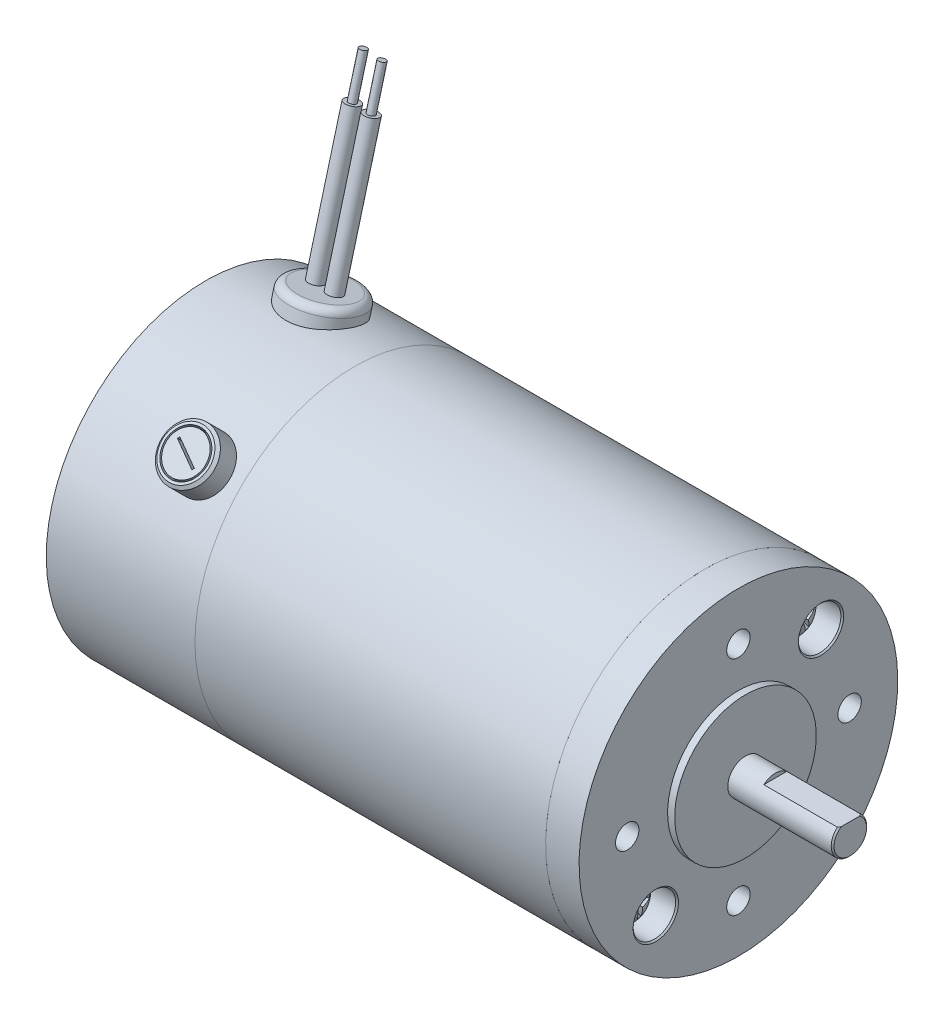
ISO-10303-21;
HEADER;
FILE_DESCRIPTION(('STEP AP214'),'2;1');
FILE_NAME('part.step','',(''),(''),'','','');
FILE_SCHEMA(('AUTOMOTIVE_DESIGN { 1 0 10303 214 1 1 1 1 }'));
ENDSEC;
DATA;
#1=APPLICATION_CONTEXT('core data for automotive mechanical design processes');
#2=APPLICATION_PROTOCOL_DEFINITION('international standard','automotive_design',2000,#1);
#3=PRODUCT_CONTEXT('',#1,'mechanical');
#4=PRODUCT('Part','Part','',(#3));
#5=PRODUCT_RELATED_PRODUCT_CATEGORY('part','',(#4));
#6=PRODUCT_DEFINITION_FORMATION('','',#4);
#7=PRODUCT_DEFINITION_CONTEXT('part definition',#1,'design');
#8=PRODUCT_DEFINITION('design','',#6,#7);
#9=PRODUCT_DEFINITION_SHAPE('','',#8);
#10=(LENGTH_UNIT() NAMED_UNIT(*) SI_UNIT(.MILLI.,.METRE.));
#11=(NAMED_UNIT(*) PLANE_ANGLE_UNIT() SI_UNIT($,.RADIAN.));
#12=(NAMED_UNIT(*) SI_UNIT($,.STERADIAN.) SOLID_ANGLE_UNIT());
#13=UNCERTAINTY_MEASURE_WITH_UNIT(LENGTH_MEASURE(1.E-05),#10,'distance_accuracy_value','');
#14=(GEOMETRIC_REPRESENTATION_CONTEXT(3) GLOBAL_UNCERTAINTY_ASSIGNED_CONTEXT((#13)) GLOBAL_UNIT_ASSIGNED_CONTEXT((#10,
#11,#12)) REPRESENTATION_CONTEXT('',''));
#15=CARTESIAN_POINT('',(0.,0.,0.));
#16=DIRECTION('',(0.,0.,1.));
#17=DIRECTION('',(1.,0.,0.));
#18=AXIS2_PLACEMENT_3D('',#15,#16,#17);
#19=CARTESIAN_POINT('',(88.20432,-14.8174225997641,14.8174225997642));
#20=DIRECTION('',(1.,0.,0.));
#21=DIRECTION('',(0.,0.989318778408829,0.145768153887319));
#22=AXIS2_PLACEMENT_3D('',#19,#20,#21);
#23=SPHERICAL_SURFACE('',#22,4.55168);
#24=CARTESIAN_POINT('',(91.0350083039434,-14.8174225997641,14.8174225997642));
#25=DIRECTION('',(1.,0.,0.));
#26=DIRECTION('',(0.,0.14576815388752,-0.989318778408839));
#27=AXIS2_PLACEMENT_3D('',#24,#25,#26);
#28=CIRCLE('',#27,3.56440661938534);
#29=CARTESIAN_POINT('',(91.0350083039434,-14.2978456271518,11.2910881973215));
#30=VERTEX_POINT('',#29);
#31=EDGE_CURVE('P0_E137',#30,#30,#28,.T.);
#32=ORIENTED_EDGE('',*,*,#31,.T.);
#33=EDGE_LOOP('',(#32));
#34=FACE_BOUND('',#33,.T.);
#35=CARTESIAN_POINT('',(88.2097859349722,-14.8708221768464,14.8095546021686));
#36=DIRECTION('',(0.100750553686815,-0.984284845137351,-0.145026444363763));
#37=DIRECTION('',(-0.994911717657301,-0.0996744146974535,-0.0146862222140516));
#38=AXIS2_PLACEMENT_3D('',#35,#36,#37);
#39=CIRCLE('',#38,4.55135666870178);
#40=CARTESIAN_POINT('',(92.1393217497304,-14.1474622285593,12.6300257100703));
#41=VERTEX_POINT('',#40);
#42=CARTESIAN_POINT('',(92.7202178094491,-14.3602362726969,14.4776602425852));
#43=VERTEX_POINT('',#42);
#44=EDGE_CURVE('P0_E168',#41,#43,#39,.T.);
#45=ORIENTED_EDGE('',*,*,#44,.F.);
#46=CARTESIAN_POINT('',(89.8581796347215,-14.9802031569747,15.9222034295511));
#47=DIRECTION('',(-0.8287665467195,0.0815710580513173,-0.55361735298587));
#48=DIRECTION('',(-0.55959450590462,-0.12080776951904,0.81991430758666));
#49=AXIS2_PLACEMENT_3D('',#46,#47,#48);
#50=CIRCLE('',#49,4.09090466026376);
#51=CARTESIAN_POINT('',(92.1393217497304,-14.8280177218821,12.5297513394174));
#52=VERTEX_POINT('',#51);
#53=EDGE_CURVE('P0_E133',#41,#52,#50,.T.);
#54=ORIENTED_EDGE('',*,*,#53,.T.);
#55=CARTESIAN_POINT('',(88.2097859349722,-14.764023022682,14.8252905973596));
#56=DIRECTION('',(0.100750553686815,0.984284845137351,0.145026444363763));
#57=DIRECTION('',(0.994911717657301,-0.0996744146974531,-0.0146862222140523));
#58=AXIS2_PLACEMENT_3D('',#55,#56,#57);
#59=CIRCLE('',#58,4.55135666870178);
#60=CARTESIAN_POINT('',(92.7202178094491,-15.1571849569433,14.3602362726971));
#61=VERTEX_POINT('',#60);
#62=EDGE_CURVE('P0_E89',#61,#52,#59,.T.);
#63=ORIENTED_EDGE('',*,*,#62,.F.);
#64=CARTESIAN_POINT('',(88.2097859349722,-14.8252905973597,14.8708221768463));
#65=DIRECTION('',(0.100750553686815,-0.145026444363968,0.984284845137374));
#66=DIRECTION('',(0.994911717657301,0.0146862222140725,-0.0996744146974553));
#67=AXIS2_PLACEMENT_3D('',#64,#65,#66);
#68=CIRCLE('',#67,4.55135666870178);
#69=CARTESIAN_POINT('',(92.1393217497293,-17.004819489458,14.1474622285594));
#70=VERTEX_POINT('',#69);
#71=EDGE_CURVE('P0_E114',#70,#61,#68,.T.);
#72=ORIENTED_EDGE('',*,*,#71,.F.);
#73=CARTESIAN_POINT('',(89.8581796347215,-13.712641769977,14.9802031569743));
#74=DIRECTION('',(-0.8287665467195,-0.553617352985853,-0.0815710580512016));
#75=DIRECTION('',(-0.55959450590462,0.819914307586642,0.120807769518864));
#76=AXIS2_PLACEMENT_3D('',#73,#74,#75);
#77=CIRCLE('',#76,4.09090466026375);
#78=CARTESIAN_POINT('',(92.1393217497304,-17.1050938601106,14.8280177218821));
#79=VERTEX_POINT('',#78);
#80=EDGE_CURVE('P0_E122',#70,#79,#77,.T.);
#81=ORIENTED_EDGE('',*,*,#80,.T.);
#82=CARTESIAN_POINT('',(88.2097859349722,-14.8095546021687,14.7640230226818));
#83=DIRECTION('',(0.100750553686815,0.145026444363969,-0.984284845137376));
#84=DIRECTION('',(-0.994911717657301,0.0146862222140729,-0.0996744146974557));
#85=AXIS2_PLACEMENT_3D('',#82,#83,#84);
#86=CIRCLE('',#85,4.55135666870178);
#87=CARTESIAN_POINT('',(92.7202178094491,-15.2746089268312,15.1571849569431));
#88=VERTEX_POINT('',#87);
#89=EDGE_CURVE('P0_E32',#88,#79,#86,.T.);
#90=ORIENTED_EDGE('',*,*,#89,.F.);
#91=CARTESIAN_POINT('',(92.1393217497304,-15.4873829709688,17.004819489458));
#92=VERTEX_POINT('',#91);
#93=EDGE_CURVE('P0_E175',#92,#88,#59,.T.);
#94=ORIENTED_EDGE('',*,*,#93,.F.);
#95=CARTESIAN_POINT('',(89.8581796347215,-14.6546420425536,13.7126417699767));
#96=DIRECTION('',(-0.8287665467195,-0.0815710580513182,0.553617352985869));
#97=DIRECTION('',(0.55959450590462,-0.120807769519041,0.819914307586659));
#98=AXIS2_PLACEMENT_3D('',#95,#96,#97);
#99=CIRCLE('',#98,4.09090466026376);
#100=CARTESIAN_POINT('',(92.1393217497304,-14.8068274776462,17.1050938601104));
#101=VERTEX_POINT('',#100);
#102=EDGE_CURVE('P0_E115',#92,#101,#99,.T.);
#103=ORIENTED_EDGE('',*,*,#102,.T.);
#104=CARTESIAN_POINT('',(92.7202178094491,-14.4776602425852,15.2746089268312));
#105=VERTEX_POINT('',#104);
#106=EDGE_CURVE('P0_E163',#105,#101,#39,.T.);
#107=ORIENTED_EDGE('',*,*,#106,.F.);
#108=CARTESIAN_POINT('',(92.1393217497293,-12.63002571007,15.4873829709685));
#109=VERTEX_POINT('',#108);
#110=EDGE_CURVE('P0_E25',#109,#105,#86,.T.);
#111=ORIENTED_EDGE('',*,*,#110,.F.);
#112=CARTESIAN_POINT('',(89.8581796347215,-15.9222034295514,14.6546420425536));
#113=DIRECTION('',(-0.8287665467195,0.553617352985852,0.0815710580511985));
#114=DIRECTION('',(0.55959450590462,0.81991430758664,0.120807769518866));
#115=AXIS2_PLACEMENT_3D('',#112,#113,#114);
#116=CIRCLE('',#115,4.09090466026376);
#117=CARTESIAN_POINT('',(92.1393217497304,-12.5297513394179,14.8068274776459));
#118=VERTEX_POINT('',#117);
#119=EDGE_CURVE('P0_E11',#109,#118,#116,.T.);
#120=ORIENTED_EDGE('',*,*,#119,.T.);
#121=EDGE_CURVE('P0_E151',#43,#118,#68,.T.);
#122=ORIENTED_EDGE('',*,*,#121,.F.);
#123=EDGE_LOOP('',(#45,#54,#63,#72,#81,#90,#94,#103,#107,#111,#120,#122));
#124=FACE_BOUND('',#123,.T.);
#125=ADVANCED_FACE('P0_F17',(#34,#124),#23,.T.);
#126=CARTESIAN_POINT('',(90.6121965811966,-14.8450173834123,15.0047065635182));
#127=DIRECTION('',(0.100750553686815,0.145026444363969,-0.984284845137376));
#128=DIRECTION('',(-0.994911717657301,0.0146862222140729,-0.0996744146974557));
#129=AXIS2_PLACEMENT_3D('',#126,#127,#128);
#130=PLANE('',#129);
#131=ORIENTED_EDGE('',*,*,#110,.T.);
#132=DIRECTION('',(-0.989900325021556,-0.0845601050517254,-0.113784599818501));
#133=VECTOR('',#132,1.);
#134=CARTESIAN_POINT('',(90.5934116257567,-14.6593380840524,15.0301421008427));
#135=LINE('',#134,#133);
#136=CARTESIAN_POINT('',(90.7494,-14.6460131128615,15.0480722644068));
#137=VERTEX_POINT('',#136);
#138=EDGE_CURVE('P0_E157',#105,#137,#135,.T.);
#139=ORIENTED_EDGE('',*,*,#138,.T.);
#140=DIRECTION('',(-0.558698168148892,-0.810353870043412,-0.176586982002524));
#141=VECTOR('',#140,1.);
#142=CARTESIAN_POINT('',(92.756,-11.735575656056,15.6822956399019));
#143=LINE('',#142,#141);
#144=EDGE_CURVE('P0_E138',#109,#137,#143,.T.);
#145=ORIENTED_EDGE('',*,*,#144,.F.);
#146=EDGE_LOOP('',(#131,#139,#145));
#147=FACE_BOUND('',#146,.T.);
#148=ADVANCED_FACE('P0_F156',(#147),#130,.T.);
#149=DIRECTION('',(-0.558698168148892,0.826848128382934,0.0646415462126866));
#150=VECTOR('',#149,1.);
#151=CARTESIAN_POINT('',(92.7560000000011,-18.017749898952,14.7566678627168));
#152=LINE('',#151,#150);
#153=CARTESIAN_POINT('',(90.7494,-15.0480722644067,14.9888320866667));
#154=VERTEX_POINT('',#153);
#155=EDGE_CURVE('P0_E123',#79,#154,#152,.T.);
#156=ORIENTED_EDGE('',*,*,#155,.T.);
#157=DIRECTION('',(0.989900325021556,-0.113784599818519,0.0845601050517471));
#158=VECTOR('',#157,1.);
#159=CARTESIAN_POINT('',(90.5934116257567,-15.030142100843,14.9755071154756));
#160=LINE('',#159,#158);
#161=EDGE_CURVE('P0_E178',#154,#88,#160,.T.);
#162=ORIENTED_EDGE('',*,*,#161,.T.);
#163=ORIENTED_EDGE('',*,*,#89,.T.);
#164=EDGE_LOOP('',(#156,#162,#163));
#165=FACE_BOUND('',#164,.T.);
#166=ADVANCED_FACE('P0_F193',(#165),#130,.T.);
#167=CARTESIAN_POINT('',(90.6121965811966,-14.789827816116,14.6301386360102));
#168=DIRECTION('',(0.100750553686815,-0.145026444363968,0.984284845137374));
#169=DIRECTION('',(0.994911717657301,0.0146862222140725,-0.0996744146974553));
#170=AXIS2_PLACEMENT_3D('',#167,#168,#169);
#171=PLANE('',#170);
#172=DIRECTION('',(-0.558698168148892,-0.826848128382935,-0.0646415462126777));
#173=VECTOR('',#172,1.);
#174=CARTESIAN_POINT('',(92.7560000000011,-11.6170953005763,14.8781773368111));
#175=LINE('',#174,#173);
#176=CARTESIAN_POINT('',(90.7494,-14.5867729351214,14.6460131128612));
#177=VERTEX_POINT('',#176);
#178=EDGE_CURVE('P0_E194',#118,#177,#175,.T.);
#179=ORIENTED_EDGE('',*,*,#178,.T.);
#180=DIRECTION('',(0.989900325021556,0.11378459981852,-0.0845601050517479));
#181=VECTOR('',#180,1.);
#182=CARTESIAN_POINT('',(90.5934116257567,-14.6047030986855,14.6593380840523));
#183=LINE('',#182,#181);
#184=EDGE_CURVE('P0_E172',#177,#43,#183,.T.);
#185=ORIENTED_EDGE('',*,*,#184,.T.);
#186=ORIENTED_EDGE('',*,*,#121,.T.);
#187=EDGE_LOOP('',(#179,#185,#186));
#188=FACE_BOUND('',#187,.T.);
#189=ADVANCED_FACE('P0_F198',(#188),#171,.T.);
#190=ORIENTED_EDGE('',*,*,#71,.T.);
#191=DIRECTION('',(-0.989900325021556,0.0845601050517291,0.113784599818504));
#192=VECTOR('',#191,1.);
#193=CARTESIAN_POINT('',(90.5934116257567,-14.9755071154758,14.6047030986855));
#194=LINE('',#193,#192);
#195=CARTESIAN_POINT('',(90.7494,-14.9888320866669,14.5867729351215));
#196=VERTEX_POINT('',#195);
#197=EDGE_CURVE('P0_E87',#61,#196,#194,.T.);
#198=ORIENTED_EDGE('',*,*,#197,.T.);
#199=DIRECTION('',(-0.558698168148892,0.810353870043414,0.176586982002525));
#200=VECTOR('',#199,1.);
#201=CARTESIAN_POINT('',(92.756,-17.8992695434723,13.952549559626));
#202=LINE('',#201,#200);
#203=EDGE_CURVE('P0_E112',#70,#196,#202,.T.);
#204=ORIENTED_EDGE('',*,*,#203,.F.);
#205=EDGE_LOOP('',(#190,#198,#204));
#206=FACE_BOUND('',#205,.T.);
#207=ADVANCED_FACE('P0_F111',(#206),#171,.T.);
#208=CARTESIAN_POINT('',(118.156,-14.8174225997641,14.8174225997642));
#209=DIRECTION('',(1.,0.,0.));
#210=DIRECTION('',(0.,0.14576815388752,-0.989318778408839));
#211=AXIS2_PLACEMENT_3D('',#208,#209,#210);
#212=CYLINDRICAL_SURFACE('',#211,1.905);
#213=CARTESIAN_POINT('',(83.866,-14.8174225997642,14.8174225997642));
#214=DIRECTION('',(1.,0.,0.));
#215=DIRECTION('',(0.,0.14576815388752,-0.989318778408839));
#216=AXIS2_PLACEMENT_3D('',#213,#214,#215);
#217=CIRCLE('',#216,1.905);
#218=CARTESIAN_POINT('',(83.866,-14.5397342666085,12.9327703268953));
#219=VERTEX_POINT('',#218);
#220=EDGE_CURVE('P0_E134',#219,#219,#217,.T.);
#221=ORIENTED_EDGE('',*,*,#220,.T.);
#222=EDGE_LOOP('',(#221));
#223=FACE_BOUND('',#222,.T.);
#224=CARTESIAN_POINT('',(90.216,-14.8174225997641,14.8174225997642));
#225=DIRECTION('',(1.,0.,0.));
#226=DIRECTION('',(0.,0.14576815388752,-0.989318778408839));
#227=AXIS2_PLACEMENT_3D('',#224,#225,#226);
#228=CIRCLE('',#227,1.905);
#229=CARTESIAN_POINT('',(90.216,-14.5397342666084,12.9327703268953));
#230=VERTEX_POINT('',#229);
#231=EDGE_CURVE('P0_E147',#230,#230,#228,.T.);
#232=ORIENTED_EDGE('',*,*,#231,.F.);
#233=EDGE_LOOP('',(#232));
#234=FACE_BOUND('',#233,.T.);
#235=ADVANCED_FACE('P0_F19',(#223,#234),#212,.T.);
#236=CARTESIAN_POINT('',(90.216,-12.9327703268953,15.0951109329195));
#237=DIRECTION('',(1.,0.,0.));
#238=DIRECTION('',(0.,0.14576815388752,-0.989318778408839));
#239=AXIS2_PLACEMENT_3D('',#236,#237,#238);
#240=PLANE('',#239);
#241=CARTESIAN_POINT('',(90.216,-14.8174225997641,14.8174225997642));
#242=DIRECTION('',(1.,0.,0.));
#243=DIRECTION('',(0.,0.14576815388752,-0.989318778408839));
#244=AXIS2_PLACEMENT_3D('',#241,#242,#243);
#245=CIRCLE('',#244,3.6195);
#246=CARTESIAN_POINT('',(90.216,-14.2898147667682,11.2365832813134));
#247=VERTEX_POINT('',#246);
#248=EDGE_CURVE('P0_E144',#247,#247,#245,.T.);
#249=ORIENTED_EDGE('',*,*,#248,.F.);
#250=EDGE_LOOP('',(#249));
#251=FACE_BOUND('',#250,.T.);
#252=ORIENTED_EDGE('',*,*,#231,.T.);
#253=EDGE_LOOP('',(#252));
#254=FACE_BOUND('',#253,.T.);
#255=ADVANCED_FACE('P0_F227',(#251,#254),#240,.F.);
#256=CARTESIAN_POINT('',(118.156,-14.8174225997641,14.8174225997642));
#257=DIRECTION('',(1.,0.,0.));
#258=DIRECTION('',(0.,0.14576815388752,-0.989318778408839));
#259=AXIS2_PLACEMENT_3D('',#256,#257,#258);
#260=CYLINDRICAL_SURFACE('',#259,3.6195);
#261=ORIENTED_EDGE('',*,*,#248,.T.);
#262=EDGE_LOOP('',(#261));
#263=FACE_BOUND('',#262,.T.);
#264=CARTESIAN_POINT('',(90.8770457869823,-14.8174225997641,14.8174225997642));
#265=DIRECTION('',(1.,0.,0.));
#266=DIRECTION('',(0.,0.14576815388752,-0.989318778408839));
#267=AXIS2_PLACEMENT_3D('',#264,#265,#266);
#268=CIRCLE('',#267,3.6195);
#269=CARTESIAN_POINT('',(90.8770457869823,-14.2898147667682,11.2365832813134));
#270=VERTEX_POINT('',#269);
#271=EDGE_CURVE('P0_E141',#270,#270,#268,.T.);
#272=ORIENTED_EDGE('',*,*,#271,.F.);
#273=EDGE_LOOP('',(#272));
#274=FACE_BOUND('',#273,.T.);
#275=ADVANCED_FACE('P0_F224',(#263,#274),#260,.T.);
#276=CARTESIAN_POINT('',(90.8770457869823,-14.8174225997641,14.8174225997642));
#277=DIRECTION('',(1.,0.,0.));
#278=DIRECTION('',(0.,0.14576815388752,-0.989318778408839));
#279=AXIS2_PLACEMENT_3D('',#276,#277,#278);
#280=TOROIDAL_SURFACE('',#279,3.3655,0.254);
#281=ORIENTED_EDGE('',*,*,#271,.T.);
#282=EDGE_LOOP('',(#281));
#283=FACE_BOUND('',#282,.T.);
#284=ORIENTED_EDGE('',*,*,#31,.F.);
#285=EDGE_LOOP('',(#284));
#286=FACE_BOUND('',#285,.T.);
#287=ADVANCED_FACE('P0_F221',(#283,#286),#280,.T.);
#288=CARTESIAN_POINT('',(83.866,-12.9327703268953,15.0951109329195));
#289=DIRECTION('',(-1.,0.,0.));
#290=DIRECTION('',(0.,-0.14576815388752,0.989318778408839));
#291=AXIS2_PLACEMENT_3D('',#288,#289,#290);
#292=PLANE('',#291);
#293=ORIENTED_EDGE('',*,*,#220,.F.);
#294=EDGE_LOOP('',(#293));
#295=FACE_BOUND('',#294,.T.);
#296=ADVANCED_FACE('P0_F219',(#295),#292,.T.);
#297=CARTESIAN_POINT('',(90.7494,-14.5867729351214,14.6460131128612));
#298=DIRECTION('',(-0.8287665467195,0.553617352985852,0.0815710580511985));
#299=DIRECTION('',(0.55959450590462,0.81991430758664,0.120807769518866));
#300=AXIS2_PLACEMENT_3D('',#297,#298,#299);
#301=PLANE('',#300);
#302=ORIENTED_EDGE('',*,*,#144,.T.);
#303=DIRECTION('',(0.,-0.145768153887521,0.98931877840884));
#304=VECTOR('',#303,1.);
#305=CARTESIAN_POINT('',(90.7494,-14.5867729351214,14.6460131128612));
#306=LINE('',#305,#304);
#307=EDGE_CURVE('P0_E105',#177,#137,#306,.T.);
#308=ORIENTED_EDGE('',*,*,#307,.F.);
#309=ORIENTED_EDGE('',*,*,#178,.F.);
#310=ORIENTED_EDGE('',*,*,#119,.F.);
#311=EDGE_LOOP('',(#302,#308,#309,#310));
#312=FACE_BOUND('',#311,.T.);
#313=ADVANCED_FACE('P0_F197',(#312),#301,.F.);
#314=CARTESIAN_POINT('',(90.7494,-15.0480722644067,14.9888320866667));
#315=DIRECTION('',(-0.8287665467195,-0.553617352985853,-0.0815710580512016));
#316=DIRECTION('',(-0.55959450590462,0.819914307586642,0.120807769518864));
#317=AXIS2_PLACEMENT_3D('',#314,#315,#316);
#318=PLANE('',#317);
#319=ORIENTED_EDGE('',*,*,#203,.T.);
#320=DIRECTION('',(0.,0.14576815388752,-0.989318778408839));
#321=VECTOR('',#320,1.);
#322=CARTESIAN_POINT('',(90.7494,-15.0480722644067,14.9888320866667));
#323=LINE('',#322,#321);
#324=EDGE_CURVE('P0_E104',#154,#196,#323,.T.);
#325=ORIENTED_EDGE('',*,*,#324,.F.);
#326=ORIENTED_EDGE('',*,*,#155,.F.);
#327=ORIENTED_EDGE('',*,*,#80,.F.);
#328=EDGE_LOOP('',(#319,#325,#326,#327));
#329=FACE_BOUND('',#328,.T.);
#330=ADVANCED_FACE('P0_F119',(#329),#318,.F.);
#331=CARTESIAN_POINT('',(90.7494,-14.6460131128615,15.0480722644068));
#332=DIRECTION('',(1.,0.,0.));
#333=DIRECTION('',(0.,0.14576815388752,-0.989318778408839));
#334=AXIS2_PLACEMENT_3D('',#331,#332,#333);
#335=PLANE('',#334);
#336=DIRECTION('',(0.,0.989318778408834,0.145768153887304));
#337=VECTOR('',#336,1.);
#338=CARTESIAN_POINT('',(90.7494,-15.0480722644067,14.9888320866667));
#339=LINE('',#338,#337);
#340=EDGE_CURVE('P0_E127',#154,#137,#339,.T.);
#341=ORIENTED_EDGE('',*,*,#340,.F.);
#342=ORIENTED_EDGE('',*,*,#324,.T.);
#343=DIRECTION('',(0.,-0.989318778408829,-0.145768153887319));
#344=VECTOR('',#343,1.);
#345=CARTESIAN_POINT('',(90.7494,-14.5867729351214,14.6460131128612));
#346=LINE('',#345,#344);
#347=EDGE_CURVE('P0_E96',#177,#196,#346,.T.);
#348=ORIENTED_EDGE('',*,*,#347,.F.);
#349=ORIENTED_EDGE('',*,*,#307,.T.);
#350=EDGE_LOOP('',(#341,#342,#348,#349));
#351=FACE_BOUND('',#350,.T.);
#352=ADVANCED_FACE('P0_F125',(#351),#335,.T.);
#353=CARTESIAN_POINT('',(90.7494,-14.6460131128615,15.0480722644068));
#354=DIRECTION('',(-0.8287665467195,-0.0815710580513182,0.553617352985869));
#355=DIRECTION('',(-0.55959450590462,0.120807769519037,-0.819914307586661));
#356=AXIS2_PLACEMENT_3D('',#353,#354,#355);
#357=PLANE('',#356);
#358=DIRECTION('',(-0.558698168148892,0.176586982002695,-0.810353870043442));
#359=VECTOR('',#358,1.);
#360=CARTESIAN_POINT('',(92.7560000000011,-15.6822956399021,17.8992695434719));
#361=LINE('',#360,#359);
#362=EDGE_CURVE('P0_E183',#92,#154,#361,.T.);
#363=ORIENTED_EDGE('',*,*,#362,.T.);
#364=ORIENTED_EDGE('',*,*,#340,.T.);
#365=DIRECTION('',(-0.558698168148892,0.0646415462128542,-0.826848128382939));
#366=VECTOR('',#365,1.);
#367=CARTESIAN_POINT('',(92.7560000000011,-14.8781773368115,18.0177498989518));
#368=LINE('',#367,#366);
#369=EDGE_CURVE('P0_E93',#101,#137,#368,.T.);
#370=ORIENTED_EDGE('',*,*,#369,.F.);
#371=ORIENTED_EDGE('',*,*,#102,.F.);
#372=EDGE_LOOP('',(#363,#364,#370,#371));
#373=FACE_BOUND('',#372,.T.);
#374=ADVANCED_FACE('P0_F188',(#373),#357,.F.);
#375=CARTESIAN_POINT('',(90.6121965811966,-15.0047065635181,14.7898278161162));
#376=DIRECTION('',(0.100750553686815,0.984284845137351,0.145026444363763));
#377=DIRECTION('',(0.994911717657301,-0.0996744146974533,-0.0146862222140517));
#378=AXIS2_PLACEMENT_3D('',#375,#376,#377);
#379=PLANE('',#378);
#380=ORIENTED_EDGE('',*,*,#93,.T.);
#381=ORIENTED_EDGE('',*,*,#161,.F.);
#382=ORIENTED_EDGE('',*,*,#362,.F.);
#383=EDGE_LOOP('',(#380,#381,#382));
#384=FACE_BOUND('',#383,.T.);
#385=ADVANCED_FACE('P0_F192',(#384),#379,.T.);
#386=CARTESIAN_POINT('',(90.6121965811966,-14.6301386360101,14.845017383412));
#387=DIRECTION('',(0.100750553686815,-0.984284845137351,-0.145026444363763));
#388=DIRECTION('',(-0.994911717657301,-0.0996744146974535,-0.0146862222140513));
#389=AXIS2_PLACEMENT_3D('',#386,#387,#388);
#390=PLANE('',#389);
#391=ORIENTED_EDGE('',*,*,#106,.T.);
#392=ORIENTED_EDGE('',*,*,#369,.T.);
#393=ORIENTED_EDGE('',*,*,#138,.F.);
#394=EDGE_LOOP('',(#391,#392,#393));
#395=FACE_BOUND('',#394,.T.);
#396=ADVANCED_FACE('P0_F186',(#395),#390,.T.);
#397=CARTESIAN_POINT('',(90.7494,-14.9888320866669,14.5867729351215));
#398=DIRECTION('',(-0.8287665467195,0.0815710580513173,-0.55361735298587));
#399=DIRECTION('',(0.55959450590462,0.120807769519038,-0.81991430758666));
#400=AXIS2_PLACEMENT_3D('',#397,#398,#399);
#401=PLANE('',#400);
#402=DIRECTION('',(-0.558698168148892,-0.176586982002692,0.81035387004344));
#403=VECTOR('',#402,1.);
#404=CARTESIAN_POINT('',(92.7560000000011,-13.9525495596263,11.7355756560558));
#405=LINE('',#404,#403);
#406=EDGE_CURVE('P0_E92',#41,#177,#405,.T.);
#407=ORIENTED_EDGE('',*,*,#406,.T.);
#408=ORIENTED_EDGE('',*,*,#347,.T.);
#409=DIRECTION('',(-0.558698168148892,-0.064641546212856,0.82684812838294));
#410=VECTOR('',#409,1.);
#411=CARTESIAN_POINT('',(92.7560000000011,-14.7566678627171,11.6170953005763));
#412=LINE('',#411,#410);
#413=EDGE_CURVE('P0_E83',#52,#196,#412,.T.);
#414=ORIENTED_EDGE('',*,*,#413,.F.);
#415=ORIENTED_EDGE('',*,*,#53,.F.);
#416=EDGE_LOOP('',(#407,#408,#414,#415));
#417=FACE_BOUND('',#416,.T.);
#418=ADVANCED_FACE('P0_F97',(#417),#401,.F.);
#419=ORIENTED_EDGE('',*,*,#44,.T.);
#420=ORIENTED_EDGE('',*,*,#184,.F.);
#421=ORIENTED_EDGE('',*,*,#406,.F.);
#422=EDGE_LOOP('',(#419,#420,#421));
#423=FACE_BOUND('',#422,.T.);
#424=ADVANCED_FACE('P0_F199',(#423),#390,.T.);
#425=ORIENTED_EDGE('',*,*,#62,.T.);
#426=ORIENTED_EDGE('',*,*,#413,.T.);
#427=ORIENTED_EDGE('',*,*,#197,.F.);
#428=EDGE_LOOP('',(#425,#426,#427));
#429=FACE_BOUND('',#428,.T.);
#430=ADVANCED_FACE('P0_F85',(#429),#379,.T.);
#431=CLOSED_SHELL('',(#125,#148,#166,#189,#207,#235,#255,#275,#287,#296,#313,#330,#352,#374,
#385,#396,#418,#424,#430));
#432=MANIFOLD_SOLID_BREP('P0_B1',#431);
#433=CARTESIAN_POINT('',(95.55,0.,0.));
#434=DIRECTION('',(-1.,0.,0.));
#435=DIRECTION('',(0.,0.707106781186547,0.70710678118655));
#436=AXIS2_PLACEMENT_3D('',#433,#434,#435);
#437=PLANE('',#436);
#438=CARTESIAN_POINT('',(95.55,14.8174225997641,-14.8174225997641));
#439=DIRECTION('',(-1.,0.,0.));
#440=DIRECTION('',(0.,0.707106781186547,0.70710678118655));
#441=AXIS2_PLACEMENT_3D('',#438,#439,#440);
#442=CIRCLE('',#441,4.06400000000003);
#443=CARTESIAN_POINT('',(95.55,17.6911045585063,-11.9437406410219));
#444=VERTEX_POINT('',#443);
#445=EDGE_CURVE('P1_E22',#444,#444,#442,.T.);
#446=ORIENTED_EDGE('',*,*,#445,.T.);
#447=EDGE_LOOP('',(#446));
#448=FACE_BOUND('',#447,.T.);
#449=CARTESIAN_POINT('',(95.55,-14.8174225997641,14.8174225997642));
#450=DIRECTION('',(-1.,0.,0.));
#451=DIRECTION('',(0.,0.707106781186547,0.70710678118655));
#452=AXIS2_PLACEMENT_3D('',#449,#450,#451);
#453=CIRCLE('',#452,4.06400000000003);
#454=CARTESIAN_POINT('',(95.55,-11.943740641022,17.6911045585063));
#455=VERTEX_POINT('',#454);
#456=EDGE_CURVE('P1_E26',#455,#455,#453,.T.);
#457=ORIENTED_EDGE('',*,*,#456,.T.);
#458=EDGE_LOOP('',(#457));
#459=FACE_BOUND('',#458,.T.);
#460=CARTESIAN_POINT('',(95.55,0.,-19.939));
#461=DIRECTION('',(1.,0.,0.));
#462=DIRECTION('',(0.,-0.707106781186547,-0.70710678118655));
#463=AXIS2_PLACEMENT_3D('',#460,#461,#462);
#464=CIRCLE('',#463,2.1);
#465=CARTESIAN_POINT('',(95.55,-1.48492424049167,-21.4239242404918));
#466=VERTEX_POINT('',#465);
#467=EDGE_CURVE('P1_E68',#466,#466,#464,.T.);
#468=ORIENTED_EDGE('',*,*,#467,.F.);
#469=EDGE_LOOP('',(#468));
#470=FACE_BOUND('',#469,.T.);
#471=CARTESIAN_POINT('',(95.55,-19.939,0.));
#472=DIRECTION('',(1.,0.,0.));
#473=DIRECTION('',(0.,-0.707106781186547,-0.70710678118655));
#474=AXIS2_PLACEMENT_3D('',#471,#472,#473);
#475=CIRCLE('',#474,2.1);
#476=CARTESIAN_POINT('',(95.55,-21.4239242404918,-1.48492424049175));
#477=VERTEX_POINT('',#476);
#478=EDGE_CURVE('P1_E62',#477,#477,#475,.T.);
#479=ORIENTED_EDGE('',*,*,#478,.F.);
#480=EDGE_LOOP('',(#479));
#481=FACE_BOUND('',#480,.T.);
#482=CARTESIAN_POINT('',(95.55,19.939,0.));
#483=DIRECTION('',(1.,0.,0.));
#484=DIRECTION('',(0.,-0.707106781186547,-0.70710678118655));
#485=AXIS2_PLACEMENT_3D('',#482,#483,#484);
#486=CIRCLE('',#485,2.1);
#487=CARTESIAN_POINT('',(95.55,18.4540757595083,-1.48492424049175));
#488=VERTEX_POINT('',#487);
#489=EDGE_CURVE('P1_E39',#488,#488,#486,.T.);
#490=ORIENTED_EDGE('',*,*,#489,.F.);
#491=EDGE_LOOP('',(#490));
#492=FACE_BOUND('',#491,.T.);
#493=CARTESIAN_POINT('',(95.55,0.,0.));
#494=DIRECTION('',(-1.,0.,0.));
#495=DIRECTION('',(0.,0.707106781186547,0.70710678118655));
#496=AXIS2_PLACEMENT_3D('',#493,#494,#495);
#497=CIRCLE('',#496,28.575);
#498=CARTESIAN_POINT('',(95.55,20.2055762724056,20.2055762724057));
#499=VERTEX_POINT('',#498);
#500=EDGE_CURVE('P1_E44',#499,#499,#497,.T.);
#501=ORIENTED_EDGE('',*,*,#500,.F.);
#502=EDGE_LOOP('',(#501));
#503=FACE_BOUND('',#502,.T.);
#504=CARTESIAN_POINT('',(95.55,0.,0.));
#505=DIRECTION('',(-1.,0.,0.));
#506=DIRECTION('',(0.,0.707106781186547,0.70710678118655));
#507=AXIS2_PLACEMENT_3D('',#504,#505,#506);
#508=CIRCLE('',#507,12.7);
#509=CARTESIAN_POINT('',(95.55,8.98025612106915,8.98025612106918));
#510=VERTEX_POINT('',#509);
#511=EDGE_CURVE('P1_E35',#510,#510,#508,.F.);
#512=ORIENTED_EDGE('',*,*,#511,.F.);
#513=EDGE_LOOP('',(#512));
#514=FACE_BOUND('',#513,.T.);
#515=CARTESIAN_POINT('',(95.55,0.,19.939));
#516=DIRECTION('',(1.,0.,0.));
#517=DIRECTION('',(0.,-0.707106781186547,-0.70710678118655));
#518=AXIS2_PLACEMENT_3D('',#515,#516,#517);
#519=CIRCLE('',#518,2.1);
#520=CARTESIAN_POINT('',(95.55,-1.48492424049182,18.4540757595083));
#521=VERTEX_POINT('',#520);
#522=EDGE_CURVE('P1_E40',#521,#521,#519,.T.);
#523=ORIENTED_EDGE('',*,*,#522,.F.);
#524=EDGE_LOOP('',(#523));
#525=FACE_BOUND('',#524,.T.);
#526=ADVANCED_FACE('P1_F15',(#448,#459,#470,#481,#492,#503,#514,#525),#437,.F.);
#527=CARTESIAN_POINT('',(89.550012,0.,0.));
#528=DIRECTION('',(1.,0.,0.));
#529=DIRECTION('',(0.,-0.707106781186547,-0.70710678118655));
#530=AXIS2_PLACEMENT_3D('',#527,#528,#529);
#531=CYLINDRICAL_SURFACE('',#530,28.575);
#532=CARTESIAN_POINT('',(89.550012,0.,0.));
#533=DIRECTION('',(-1.,0.,0.));
#534=DIRECTION('',(0.,0.707106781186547,0.70710678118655));
#535=AXIS2_PLACEMENT_3D('',#532,#533,#534);
#536=CIRCLE('',#535,28.575);
#537=CARTESIAN_POINT('',(89.550012,20.2055762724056,20.2055762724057));
#538=VERTEX_POINT('',#537);
#539=EDGE_CURVE('P1_E43',#538,#538,#536,.T.);
#540=ORIENTED_EDGE('',*,*,#539,.F.);
#541=EDGE_LOOP('',(#540));
#542=FACE_BOUND('',#541,.T.);
#543=ORIENTED_EDGE('',*,*,#500,.T.);
#544=EDGE_LOOP('',(#543));
#545=FACE_BOUND('',#544,.T.);
#546=ADVANCED_FACE('P1_F95',(#542,#545),#531,.T.);
#547=CARTESIAN_POINT('',(89.550012,0.,0.));
#548=DIRECTION('',(-1.,0.,0.));
#549=DIRECTION('',(0.,0.707106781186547,0.70710678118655));
#550=AXIS2_PLACEMENT_3D('',#547,#548,#549);
#551=PLANE('',#550);
#552=CARTESIAN_POINT('',(89.550012,0.,-19.939));
#553=DIRECTION('',(-1.,0.,0.));
#554=DIRECTION('',(0.,0.707106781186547,0.70710678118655));
#555=AXIS2_PLACEMENT_3D('',#552,#553,#554);
#556=CIRCLE('',#555,2.1);
#557=CARTESIAN_POINT('',(89.550012,1.48492424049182,-18.4540757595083));
#558=VERTEX_POINT('',#557);
#559=EDGE_CURVE('P1_E65',#558,#558,#556,.T.);
#560=ORIENTED_EDGE('',*,*,#559,.F.);
#561=EDGE_LOOP('',(#560));
#562=FACE_BOUND('',#561,.T.);
#563=CARTESIAN_POINT('',(89.550012,-19.939,0.));
#564=DIRECTION('',(-1.,0.,0.));
#565=DIRECTION('',(0.,0.707106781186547,0.70710678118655));
#566=AXIS2_PLACEMENT_3D('',#563,#564,#565);
#567=CIRCLE('',#566,2.1);
#568=CARTESIAN_POINT('',(89.550012,-18.4540757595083,1.48492424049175));
#569=VERTEX_POINT('',#568);
#570=EDGE_CURVE('P1_E59',#569,#569,#567,.T.);
#571=ORIENTED_EDGE('',*,*,#570,.F.);
#572=EDGE_LOOP('',(#571));
#573=FACE_BOUND('',#572,.T.);
#574=CARTESIAN_POINT('',(89.550012,0.,19.939));
#575=DIRECTION('',(-1.,0.,0.));
#576=DIRECTION('',(0.,0.707106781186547,0.70710678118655));
#577=AXIS2_PLACEMENT_3D('',#574,#575,#576);
#578=CIRCLE('',#577,2.1);
#579=CARTESIAN_POINT('',(89.550012,1.48492424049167,21.4239242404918));
#580=VERTEX_POINT('',#579);
#581=EDGE_CURVE('P1_E36',#580,#580,#578,.T.);
#582=ORIENTED_EDGE('',*,*,#581,.F.);
#583=EDGE_LOOP('',(#582));
#584=FACE_BOUND('',#583,.T.);
#585=CARTESIAN_POINT('',(89.550012,19.939,0.));
#586=DIRECTION('',(-1.,0.,0.));
#587=DIRECTION('',(0.,0.707106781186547,0.70710678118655));
#588=AXIS2_PLACEMENT_3D('',#585,#586,#587);
#589=CIRCLE('',#588,2.1);
#590=CARTESIAN_POINT('',(89.550012,21.4239242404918,1.48492424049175));
#591=VERTEX_POINT('',#590);
#592=EDGE_CURVE('P1_E52',#591,#591,#589,.T.);
#593=ORIENTED_EDGE('',*,*,#592,.F.);
#594=EDGE_LOOP('',(#593));
#595=FACE_BOUND('',#594,.T.);
#596=ORIENTED_EDGE('',*,*,#539,.T.);
#597=EDGE_LOOP('',(#596));
#598=FACE_BOUND('',#597,.T.);
#599=ADVANCED_FACE('P1_F100',(#562,#573,#584,#595,#598),#551,.T.);
#600=CARTESIAN_POINT('',(96.82,0.,0.));
#601=DIRECTION('',(-1.,0.,0.));
#602=DIRECTION('',(0.,0.707106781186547,0.70710678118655));
#603=AXIS2_PLACEMENT_3D('',#600,#601,#602);
#604=CYLINDRICAL_SURFACE('',#603,12.7);
#605=CARTESIAN_POINT('',(96.82,0.,0.));
#606=DIRECTION('',(1.,0.,0.));
#607=DIRECTION('',(0.,-0.707106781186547,-0.70710678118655));
#608=AXIS2_PLACEMENT_3D('',#605,#606,#607);
#609=CIRCLE('',#608,12.7);
#610=CARTESIAN_POINT('',(96.82,-8.98025612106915,-8.98025612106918));
#611=VERTEX_POINT('',#610);
#612=EDGE_CURVE('P1_E47',#611,#611,#609,.T.);
#613=ORIENTED_EDGE('',*,*,#612,.F.);
#614=EDGE_LOOP('',(#613));
#615=FACE_BOUND('',#614,.T.);
#616=ORIENTED_EDGE('',*,*,#511,.T.);
#617=EDGE_LOOP('',(#616));
#618=FACE_BOUND('',#617,.T.);
#619=ADVANCED_FACE('P1_F140',(#615,#618),#604,.T.);
#620=CARTESIAN_POINT('',(96.82,0.,0.));
#621=DIRECTION('',(1.,0.,0.));
#622=DIRECTION('',(0.,-0.707106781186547,-0.70710678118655));
#623=AXIS2_PLACEMENT_3D('',#620,#621,#622);
#624=PLANE('',#623);
#625=ORIENTED_EDGE('',*,*,#612,.T.);
#626=EDGE_LOOP('',(#625));
#627=FACE_BOUND('',#626,.T.);
#628=ADVANCED_FACE('P1_F137',(#627),#624,.T.);
#629=CARTESIAN_POINT('',(95.55,19.939,0.));
#630=DIRECTION('',(1.,0.,0.));
#631=DIRECTION('',(0.,-0.707106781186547,-0.70710678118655));
#632=AXIS2_PLACEMENT_3D('',#629,#630,#631);
#633=CYLINDRICAL_SURFACE('',#632,2.1);
#634=ORIENTED_EDGE('',*,*,#592,.T.);
#635=EDGE_LOOP('',(#634));
#636=FACE_BOUND('',#635,.T.);
#637=ORIENTED_EDGE('',*,*,#489,.T.);
#638=EDGE_LOOP('',(#637));
#639=FACE_BOUND('',#638,.T.);
#640=ADVANCED_FACE('P1_F133',(#636,#639),#633,.F.);
#641=CARTESIAN_POINT('',(95.55,0.,19.939));
#642=DIRECTION('',(1.,0.,0.));
#643=DIRECTION('',(0.,-0.707106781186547,-0.70710678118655));
#644=AXIS2_PLACEMENT_3D('',#641,#642,#643);
#645=CYLINDRICAL_SURFACE('',#644,2.1);
#646=ORIENTED_EDGE('',*,*,#581,.T.);
#647=EDGE_LOOP('',(#646));
#648=FACE_BOUND('',#647,.T.);
#649=ORIENTED_EDGE('',*,*,#522,.T.);
#650=EDGE_LOOP('',(#649));
#651=FACE_BOUND('',#650,.T.);
#652=ADVANCED_FACE('P1_F129',(#648,#651),#645,.F.);
#653=CARTESIAN_POINT('',(95.55,-19.939,0.));
#654=DIRECTION('',(1.,0.,0.));
#655=DIRECTION('',(0.,-0.707106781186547,-0.70710678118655));
#656=AXIS2_PLACEMENT_3D('',#653,#654,#655);
#657=CYLINDRICAL_SURFACE('',#656,2.1);
#658=ORIENTED_EDGE('',*,*,#570,.T.);
#659=EDGE_LOOP('',(#658));
#660=FACE_BOUND('',#659,.T.);
#661=ORIENTED_EDGE('',*,*,#478,.T.);
#662=EDGE_LOOP('',(#661));
#663=FACE_BOUND('',#662,.T.);
#664=ADVANCED_FACE('P1_F123',(#660,#663),#657,.F.);
#665=CARTESIAN_POINT('',(95.55,0.,-19.939));
#666=DIRECTION('',(1.,0.,0.));
#667=DIRECTION('',(0.,-0.707106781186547,-0.70710678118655));
#668=AXIS2_PLACEMENT_3D('',#665,#666,#667);
#669=CYLINDRICAL_SURFACE('',#668,2.1);
#670=ORIENTED_EDGE('',*,*,#559,.T.);
#671=EDGE_LOOP('',(#670));
#672=FACE_BOUND('',#671,.T.);
#673=ORIENTED_EDGE('',*,*,#467,.T.);
#674=EDGE_LOOP('',(#673));
#675=FACE_BOUND('',#674,.T.);
#676=ADVANCED_FACE('P1_F117',(#672,#675),#669,.F.);
#677=CARTESIAN_POINT('',(90.216,14.8174225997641,-14.8174225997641));
#678=DIRECTION('',(1.,0.,0.));
#679=DIRECTION('',(0.,-0.707106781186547,-0.70710678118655));
#680=AXIS2_PLACEMENT_3D('',#677,#678,#679);
#681=CYLINDRICAL_SURFACE('',#680,3.81);
#682=CARTESIAN_POINT('',(95.296,14.8174225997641,-14.8174225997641));
#683=DIRECTION('',(-1.,0.,0.));
#684=DIRECTION('',(0.,0.707106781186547,0.70710678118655));
#685=AXIS2_PLACEMENT_3D('',#682,#683,#684);
#686=CIRCLE('',#685,3.81);
#687=CARTESIAN_POINT('',(95.296,17.5114994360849,-12.1233457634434));
#688=VERTEX_POINT('',#687);
#689=EDGE_CURVE('P1_E30',#688,#688,#686,.F.);
#690=ORIENTED_EDGE('',*,*,#689,.T.);
#691=EDGE_LOOP('',(#690));
#692=FACE_BOUND('',#691,.T.);
#693=CARTESIAN_POINT('',(90.216,14.8174225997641,-14.8174225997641));
#694=DIRECTION('',(1.,0.,0.));
#695=DIRECTION('',(0.,-0.707106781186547,-0.70710678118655));
#696=AXIS2_PLACEMENT_3D('',#693,#694,#695);
#697=CIRCLE('',#696,3.81);
#698=CARTESIAN_POINT('',(90.216,12.1233457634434,-17.5114994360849));
#699=VERTEX_POINT('',#698);
#700=EDGE_CURVE('P1_E72',#699,#699,#697,.T.);
#701=ORIENTED_EDGE('',*,*,#700,.F.);
#702=EDGE_LOOP('',(#701));
#703=FACE_BOUND('',#702,.T.);
#704=ADVANCED_FACE('P1_F91',(#692,#703),#681,.F.);
#705=CARTESIAN_POINT('',(90.216,14.8174225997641,-14.8174225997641));
#706=DIRECTION('',(1.,0.,0.));
#707=DIRECTION('',(0.,-0.707106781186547,-0.70710678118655));
#708=AXIS2_PLACEMENT_3D('',#705,#706,#707);
#709=PLANE('',#708);
#710=ORIENTED_EDGE('',*,*,#700,.T.);
#711=EDGE_LOOP('',(#710));
#712=FACE_BOUND('',#711,.T.);
#713=ADVANCED_FACE('P1_F82',(#712),#709,.T.);
#714=CARTESIAN_POINT('',(90.216,-14.8174225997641,14.8174225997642));
#715=DIRECTION('',(1.,0.,0.));
#716=DIRECTION('',(0.,-0.707106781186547,-0.70710678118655));
#717=AXIS2_PLACEMENT_3D('',#714,#715,#716);
#718=CYLINDRICAL_SURFACE('',#717,3.81);
#719=CARTESIAN_POINT('',(95.296,-14.8174225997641,14.8174225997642));
#720=DIRECTION('',(-1.,0.,0.));
#721=DIRECTION('',(0.,0.707106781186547,0.70710678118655));
#722=AXIS2_PLACEMENT_3D('',#719,#720,#721);
#723=CIRCLE('',#722,3.81);
#724=CARTESIAN_POINT('',(95.296,-12.1233457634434,17.5114994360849));
#725=VERTEX_POINT('',#724);
#726=EDGE_CURVE('P1_E10',#725,#725,#723,.F.);
#727=ORIENTED_EDGE('',*,*,#726,.T.);
#728=EDGE_LOOP('',(#727));
#729=FACE_BOUND('',#728,.T.);
#730=CARTESIAN_POINT('',(90.216,-14.8174225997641,14.8174225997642));
#731=DIRECTION('',(1.,0.,0.));
#732=DIRECTION('',(0.,-0.707106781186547,-0.70710678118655));
#733=AXIS2_PLACEMENT_3D('',#730,#731,#732);
#734=CIRCLE('',#733,3.81);
#735=CARTESIAN_POINT('',(90.216,-17.5114994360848,12.1233457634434));
#736=VERTEX_POINT('',#735);
#737=EDGE_CURVE('P1_E71',#736,#736,#734,.T.);
#738=ORIENTED_EDGE('',*,*,#737,.F.);
#739=EDGE_LOOP('',(#738));
#740=FACE_BOUND('',#739,.T.);
#741=ADVANCED_FACE('P1_F80',(#729,#740),#718,.F.);
#742=CARTESIAN_POINT('',(90.216,-14.8174225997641,14.8174225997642));
#743=DIRECTION('',(1.,0.,0.));
#744=DIRECTION('',(0.,-0.707106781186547,-0.70710678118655));
#745=AXIS2_PLACEMENT_3D('',#742,#743,#744);
#746=PLANE('',#745);
#747=ORIENTED_EDGE('',*,*,#737,.T.);
#748=EDGE_LOOP('',(#747));
#749=FACE_BOUND('',#748,.T.);
#750=ADVANCED_FACE('P1_F78',(#749),#746,.T.);
#751=CARTESIAN_POINT('',(95.296,14.8174225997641,-14.8174225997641));
#752=DIRECTION('',(1.,0.,0.));
#753=DIRECTION('',(0.,-0.707106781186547,-0.70710678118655));
#754=AXIS2_PLACEMENT_3D('',#751,#752,#753);
#755=CONICAL_SURFACE('',#754,3.81,0.785398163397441);
#756=ORIENTED_EDGE('',*,*,#445,.F.);
#757=EDGE_LOOP('',(#756));
#758=FACE_BOUND('',#757,.T.);
#759=ORIENTED_EDGE('',*,*,#689,.F.);
#760=EDGE_LOOP('',(#759));
#761=FACE_BOUND('',#760,.T.);
#762=ADVANCED_FACE('P1_F89',(#758,#761),#755,.F.);
#763=CARTESIAN_POINT('',(95.296,-14.8174225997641,14.8174225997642));
#764=DIRECTION('',(1.,0.,0.));
#765=DIRECTION('',(0.,-0.707106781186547,-0.70710678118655));
#766=AXIS2_PLACEMENT_3D('',#763,#764,#765);
#767=CONICAL_SURFACE('',#766,3.81,0.785398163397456);
#768=ORIENTED_EDGE('',*,*,#456,.F.);
#769=EDGE_LOOP('',(#768));
#770=FACE_BOUND('',#769,.T.);
#771=ORIENTED_EDGE('',*,*,#726,.F.);
#772=EDGE_LOOP('',(#771));
#773=FACE_BOUND('',#772,.T.);
#774=ADVANCED_FACE('P1_F17',(#770,#773),#767,.F.);
#775=CLOSED_SHELL('',(#526,#546,#599,#619,#628,#640,#652,#664,#676,#704,#713,#741,#750,#762,#774));
#776=MANIFOLD_SOLID_BREP('P1_B1',#775);
#777=CARTESIAN_POINT('',(26.67,0.,0.));
#778=DIRECTION('',(1.,0.,0.));
#779=DIRECTION('',(0.,-0.707106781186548,-0.70710678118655));
#780=AXIS2_PLACEMENT_3D('',#777,#778,#779);
#781=PLANE('',#780);
#782=CARTESIAN_POINT('',(26.67,0.,0.));
#783=DIRECTION('',(1.,0.,0.));
#784=DIRECTION('',(0.,-0.707106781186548,-0.70710678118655));
#785=AXIS2_PLACEMENT_3D('',#782,#783,#784);
#786=CIRCLE('',#785,28.575);
#787=CARTESIAN_POINT('',(26.67,-20.2055762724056,-20.2055762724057));
#788=VERTEX_POINT('',#787);
#789=EDGE_CURVE('P2_E26',#788,#788,#786,.T.);
#790=ORIENTED_EDGE('',*,*,#789,.F.);
#791=EDGE_LOOP('',(#790));
#792=FACE_BOUND('',#791,.T.);
#793=ADVANCED_FACE('P2_F17',(#792),#781,.F.);
#794=CARTESIAN_POINT('',(89.550012,0.,0.));
#795=DIRECTION('',(-1.,0.,0.));
#796=DIRECTION('',(0.,0.707106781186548,0.70710678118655));
#797=AXIS2_PLACEMENT_3D('',#794,#795,#796);
#798=PLANE('',#797);
#799=CARTESIAN_POINT('',(89.550012,0.,-19.939));
#800=DIRECTION('',(-1.,0.,0.));
#801=DIRECTION('',(0.,0.707106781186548,0.70710678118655));
#802=AXIS2_PLACEMENT_3D('',#799,#800,#801);
#803=CIRCLE('',#802,2.1);
#804=CARTESIAN_POINT('',(89.550012,1.48492424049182,-18.4540757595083));
#805=VERTEX_POINT('',#804);
#806=EDGE_CURVE('P2_E21',#805,#805,#803,.T.);
#807=ORIENTED_EDGE('',*,*,#806,.T.);
#808=EDGE_LOOP('',(#807));
#809=FACE_BOUND('',#808,.T.);
#810=CARTESIAN_POINT('',(89.550012,-19.939,0.));
#811=DIRECTION('',(-1.,0.,0.));
#812=DIRECTION('',(0.,0.707106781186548,0.70710678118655));
#813=AXIS2_PLACEMENT_3D('',#810,#811,#812);
#814=CIRCLE('',#813,2.1);
#815=CARTESIAN_POINT('',(89.550012,-18.4540757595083,1.48492424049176));
#816=VERTEX_POINT('',#815);
#817=EDGE_CURVE('P2_E55',#816,#816,#814,.T.);
#818=ORIENTED_EDGE('',*,*,#817,.T.);
#819=EDGE_LOOP('',(#818));
#820=FACE_BOUND('',#819,.T.);
#821=CARTESIAN_POINT('',(89.550012,0.,19.939));
#822=DIRECTION('',(-1.,0.,0.));
#823=DIRECTION('',(0.,0.707106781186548,0.70710678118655));
#824=AXIS2_PLACEMENT_3D('',#821,#822,#823);
#825=CIRCLE('',#824,2.1);
#826=CARTESIAN_POINT('',(89.550012,1.48492424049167,21.4239242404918));
#827=VERTEX_POINT('',#826);
#828=EDGE_CURVE('P2_E59',#827,#827,#825,.T.);
#829=ORIENTED_EDGE('',*,*,#828,.T.);
#830=EDGE_LOOP('',(#829));
#831=FACE_BOUND('',#830,.T.);
#832=CARTESIAN_POINT('',(89.550012,19.939,0.));
#833=DIRECTION('',(-1.,0.,0.));
#834=DIRECTION('',(0.,0.707106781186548,0.70710678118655));
#835=AXIS2_PLACEMENT_3D('',#832,#833,#834);
#836=CIRCLE('',#835,2.1);
#837=CARTESIAN_POINT('',(89.550012,21.4239242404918,1.48492424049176));
#838=VERTEX_POINT('',#837);
#839=EDGE_CURVE('P2_E63',#838,#838,#836,.T.);
#840=ORIENTED_EDGE('',*,*,#839,.T.);
#841=EDGE_LOOP('',(#840));
#842=FACE_BOUND('',#841,.T.);
#843=CARTESIAN_POINT('',(89.550012,0.,0.));
#844=DIRECTION('',(-1.,0.,0.));
#845=DIRECTION('',(0.,0.707106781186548,0.70710678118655));
#846=AXIS2_PLACEMENT_3D('',#843,#844,#845);
#847=CIRCLE('',#846,28.575);
#848=CARTESIAN_POINT('',(89.550012,20.2055762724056,20.2055762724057));
#849=VERTEX_POINT('',#848);
#850=EDGE_CURVE('P2_E11',#849,#849,#847,.T.);
#851=ORIENTED_EDGE('',*,*,#850,.F.);
#852=EDGE_LOOP('',(#851));
#853=FACE_BOUND('',#852,.T.);
#854=ADVANCED_FACE('P2_F72',(#809,#820,#831,#842,#853),#798,.F.);
#855=CARTESIAN_POINT('',(-500000.,0.,0.));
#856=DIRECTION('',(1.,0.,0.));
#857=DIRECTION('',(0.,-0.707106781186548,-0.70710678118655));
#858=AXIS2_PLACEMENT_3D('',#855,#856,#857);
#859=CYLINDRICAL_SURFACE('',#858,28.575);
#860=ORIENTED_EDGE('',*,*,#789,.T.);
#861=EDGE_LOOP('',(#860));
#862=FACE_BOUND('',#861,.T.);
#863=ORIENTED_EDGE('',*,*,#850,.T.);
#864=EDGE_LOOP('',(#863));
#865=FACE_BOUND('',#864,.T.);
#866=ADVANCED_FACE('P2_F19',(#862,#865),#859,.T.);
#867=CARTESIAN_POINT('',(95.55,19.939,0.));
#868=DIRECTION('',(1.,0.,0.));
#869=DIRECTION('',(0.,-0.707106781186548,-0.70710678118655));
#870=AXIS2_PLACEMENT_3D('',#867,#868,#869);
#871=CYLINDRICAL_SURFACE('',#870,2.1);
#872=CARTESIAN_POINT('',(86.66,19.939,0.));
#873=DIRECTION('',(1.,0.,0.));
#874=DIRECTION('',(0.,-0.707106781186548,-0.70710678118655));
#875=AXIS2_PLACEMENT_3D('',#872,#873,#874);
#876=CIRCLE('',#875,2.1);
#877=CARTESIAN_POINT('',(86.66,18.4540757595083,-1.48492424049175));
#878=VERTEX_POINT('',#877);
#879=EDGE_CURVE('P2_E60',#878,#878,#876,.T.);
#880=ORIENTED_EDGE('',*,*,#879,.F.);
#881=EDGE_LOOP('',(#880));
#882=FACE_BOUND('',#881,.T.);
#883=ORIENTED_EDGE('',*,*,#839,.F.);
#884=EDGE_LOOP('',(#883));
#885=FACE_BOUND('',#884,.T.);
#886=ADVANCED_FACE('P2_F98',(#882,#885),#871,.F.);
#887=CARTESIAN_POINT('',(86.66,19.939,0.));
#888=DIRECTION('',(1.,0.,0.));
#889=DIRECTION('',(0.,-0.707106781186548,-0.70710678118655));
#890=AXIS2_PLACEMENT_3D('',#887,#888,#889);
#891=CONICAL_SURFACE('',#890,2.1,1.02974425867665);
#892=CARTESIAN_POINT('',(85.3981927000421,19.939,0.));
#893=VERTEX_POINT('',#892);
#894=VERTEX_LOOP('',#893);
#895=FACE_BOUND('',#894,.T.);
#896=ORIENTED_EDGE('',*,*,#879,.T.);
#897=EDGE_LOOP('',(#896));
#898=FACE_BOUND('',#897,.T.);
#899=ADVANCED_FACE('P2_F106',(#895,#898),#891,.F.);
#900=CARTESIAN_POINT('',(95.55,0.,19.939));
#901=DIRECTION('',(1.,0.,0.));
#902=DIRECTION('',(0.,-0.707106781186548,-0.70710678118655));
#903=AXIS2_PLACEMENT_3D('',#900,#901,#902);
#904=CYLINDRICAL_SURFACE('',#903,2.1);
#905=CARTESIAN_POINT('',(86.66,0.,19.939));
#906=DIRECTION('',(1.,0.,0.));
#907=DIRECTION('',(0.,-0.707106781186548,-0.70710678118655));
#908=AXIS2_PLACEMENT_3D('',#905,#906,#907);
#909=CIRCLE('',#908,2.1);
#910=CARTESIAN_POINT('',(86.66,-1.48492424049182,18.4540757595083));
#911=VERTEX_POINT('',#910);
#912=EDGE_CURVE('P2_E56',#911,#911,#909,.T.);
#913=ORIENTED_EDGE('',*,*,#912,.F.);
#914=EDGE_LOOP('',(#913));
#915=FACE_BOUND('',#914,.T.);
#916=ORIENTED_EDGE('',*,*,#828,.F.);
#917=EDGE_LOOP('',(#916));
#918=FACE_BOUND('',#917,.T.);
#919=ADVANCED_FACE('P2_F88',(#915,#918),#904,.F.);
#920=CARTESIAN_POINT('',(86.66,0.,19.939));
#921=DIRECTION('',(1.,0.,0.));
#922=DIRECTION('',(0.,-0.707106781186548,-0.70710678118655));
#923=AXIS2_PLACEMENT_3D('',#920,#921,#922);
#924=CONICAL_SURFACE('',#923,2.1,1.02974425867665);
#925=CARTESIAN_POINT('',(85.3981927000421,0.,19.939));
#926=VERTEX_POINT('',#925);
#927=VERTEX_LOOP('',#926);
#928=FACE_BOUND('',#927,.T.);
#929=ORIENTED_EDGE('',*,*,#912,.T.);
#930=EDGE_LOOP('',(#929));
#931=FACE_BOUND('',#930,.T.);
#932=ADVANCED_FACE('P2_F78',(#928,#931),#924,.F.);
#933=CARTESIAN_POINT('',(95.55,-19.939,0.));
#934=DIRECTION('',(1.,0.,0.));
#935=DIRECTION('',(0.,-0.707106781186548,-0.70710678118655));
#936=AXIS2_PLACEMENT_3D('',#933,#934,#935);
#937=CYLINDRICAL_SURFACE('',#936,2.1);
#938=CARTESIAN_POINT('',(86.66,-19.939,0.));
#939=DIRECTION('',(1.,0.,0.));
#940=DIRECTION('',(0.,-0.707106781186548,-0.70710678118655));
#941=AXIS2_PLACEMENT_3D('',#938,#939,#940);
#942=CIRCLE('',#941,2.1);
#943=CARTESIAN_POINT('',(86.66,-21.4239242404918,-1.48492424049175));
#944=VERTEX_POINT('',#943);
#945=EDGE_CURVE('P2_E51',#944,#944,#942,.T.);
#946=ORIENTED_EDGE('',*,*,#945,.F.);
#947=EDGE_LOOP('',(#946));
#948=FACE_BOUND('',#947,.T.);
#949=ORIENTED_EDGE('',*,*,#817,.F.);
#950=EDGE_LOOP('',(#949));
#951=FACE_BOUND('',#950,.T.);
#952=ADVANCED_FACE('P2_F75',(#948,#951),#937,.F.);
#953=CARTESIAN_POINT('',(86.66,-19.939,0.));
#954=DIRECTION('',(1.,0.,0.));
#955=DIRECTION('',(0.,-0.707106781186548,-0.70710678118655));
#956=AXIS2_PLACEMENT_3D('',#953,#954,#955);
#957=CONICAL_SURFACE('',#956,2.1,1.02974425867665);
#958=CARTESIAN_POINT('',(85.3981927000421,-19.939,0.));
#959=VERTEX_POINT('',#958);
#960=VERTEX_LOOP('',#959);
#961=FACE_BOUND('',#960,.T.);
#962=ORIENTED_EDGE('',*,*,#945,.T.);
#963=EDGE_LOOP('',(#962));
#964=FACE_BOUND('',#963,.T.);
#965=ADVANCED_FACE('P2_F77',(#961,#964),#957,.F.);
#966=CARTESIAN_POINT('',(95.55,0.,-19.939));
#967=DIRECTION('',(1.,0.,0.));
#968=DIRECTION('',(0.,-0.707106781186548,-0.70710678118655));
#969=AXIS2_PLACEMENT_3D('',#966,#967,#968);
#970=CYLINDRICAL_SURFACE('',#969,2.1);
#971=CARTESIAN_POINT('',(86.66,0.,-19.939));
#972=DIRECTION('',(1.,0.,0.));
#973=DIRECTION('',(0.,-0.707106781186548,-0.70710678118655));
#974=AXIS2_PLACEMENT_3D('',#971,#972,#973);
#975=CIRCLE('',#974,2.1);
#976=CARTESIAN_POINT('',(86.66,-1.48492424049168,-21.4239242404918));
#977=VERTEX_POINT('',#976);
#978=EDGE_CURVE('P2_E47',#977,#977,#975,.T.);
#979=ORIENTED_EDGE('',*,*,#978,.F.);
#980=EDGE_LOOP('',(#979));
#981=FACE_BOUND('',#980,.T.);
#982=ORIENTED_EDGE('',*,*,#806,.F.);
#983=EDGE_LOOP('',(#982));
#984=FACE_BOUND('',#983,.T.);
#985=ADVANCED_FACE('P2_F43',(#981,#984),#970,.F.);
#986=CARTESIAN_POINT('',(86.66,0.,-19.939));
#987=DIRECTION('',(1.,0.,0.));
#988=DIRECTION('',(0.,-0.707106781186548,-0.70710678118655));
#989=AXIS2_PLACEMENT_3D('',#986,#987,#988);
#990=CONICAL_SURFACE('',#989,2.1,1.02974425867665);
#991=CARTESIAN_POINT('',(85.3981927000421,0.,-19.939));
#992=VERTEX_POINT('',#991);
#993=VERTEX_LOOP('',#992);
#994=FACE_BOUND('',#993,.T.);
#995=ORIENTED_EDGE('',*,*,#978,.T.);
#996=EDGE_LOOP('',(#995));
#997=FACE_BOUND('',#996,.T.);
#998=ADVANCED_FACE('P2_F40',(#994,#997),#990,.F.);
#999=CLOSED_SHELL('',(#793,#854,#866,#886,#899,#919,#932,#952,#965,#985,#998));
#1000=MANIFOLD_SOLID_BREP('P2_B1',#999);
#1001=CARTESIAN_POINT('',(26.67,0.,0.));
#1002=DIRECTION('',(-1.,0.,0.));
#1003=DIRECTION('',(0.,0.707106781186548,0.70710678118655));
#1004=AXIS2_PLACEMENT_3D('',#1001,#1002,#1003);
#1005=CYLINDRICAL_SURFACE('',#1004,28.575);
#1006=CARTESIAN_POINT('',(13.335,28.2252518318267,-4.4571048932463));
#1007=CARTESIAN_POINT('',(13.5030123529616,28.2252519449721,-4.45711243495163));
#1008=CARTESIAN_POINT('',(13.6711346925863,28.2230413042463,-4.47117377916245));
#1009=CARTESIAN_POINT('',(14.0027149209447,28.2141361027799,-4.52702083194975));
#1010=CARTESIAN_POINT('',(14.166167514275,28.207436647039,-4.56883680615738));
#1011=CARTESIAN_POINT('',(14.4835586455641,28.1893942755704,-4.67886355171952));
#1012=CARTESIAN_POINT('',(14.6375030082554,28.1780542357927,-4.74705797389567));
#1013=CARTESIAN_POINT('',(14.9316259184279,28.1505140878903,-4.90772791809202));
#1014=CARTESIAN_POINT('',(15.0718071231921,28.134314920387,-5.00019874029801));
#1015=CARTESIAN_POINT('',(15.3350165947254,28.0967737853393,-5.20701257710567));
#1016=CARTESIAN_POINT('',(15.4579821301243,28.0754137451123,-5.32143215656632));
#1017=CARTESIAN_POINT('',(15.6827292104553,28.027448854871,-5.56853148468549));
#1018=CARTESIAN_POINT('',(15.7845097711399,28.000843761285,-5.70121208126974));
#1019=CARTESIAN_POINT('',(15.9642163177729,27.9423630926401,-5.98125798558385));
#1020=CARTESIAN_POINT('',(16.0420865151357,27.9104754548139,-6.12865658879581));
#1021=CARTESIAN_POINT('',(16.171404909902,27.8417750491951,-6.43355116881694));
#1022=CARTESIAN_POINT('',(16.2228538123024,27.8049624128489,-6.59104687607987));
#1023=CARTESIAN_POINT('',(16.2976844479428,27.7271817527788,-6.91093315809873));
#1024=CARTESIAN_POINT('',(16.3211694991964,27.686229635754,-7.07330342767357));
#1025=CARTESIAN_POINT('',(16.3397255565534,27.6010273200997,-7.39879795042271));
#1026=CARTESIAN_POINT('',(16.334797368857,27.5567772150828,-7.56192218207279));
#1027=CARTESIAN_POINT('',(16.2967505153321,27.466467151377,-7.88362992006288));
#1028=CARTESIAN_POINT('',(16.2637429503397,27.4204150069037,-8.04222877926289));
#1029=CARTESIAN_POINT('',(16.1706474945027,27.3279161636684,-8.35114592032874));
#1030=CARTESIAN_POINT('',(16.1105592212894,27.2814694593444,-8.50146408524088));
#1031=CARTESIAN_POINT('',(15.9648868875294,27.1898740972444,-8.79001449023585));
#1032=CARTESIAN_POINT('',(15.8792538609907,27.1447281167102,-8.92822285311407));
#1033=CARTESIAN_POINT('',(15.6849583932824,27.0577168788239,-9.18854994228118));
#1034=CARTESIAN_POINT('',(15.5762952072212,27.0158517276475,-9.31066814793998));
#1035=CARTESIAN_POINT('',(15.3383995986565,26.9370881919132,-9.53615584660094));
#1036=CARTESIAN_POINT('',(15.2090704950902,26.9002147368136,-9.63943207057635));
#1037=CARTESIAN_POINT('',(14.9338488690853,26.8334396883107,-9.82378662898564));
#1038=CARTESIAN_POINT('',(14.7879563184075,26.8035381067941,-9.90486492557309));
#1039=CARTESIAN_POINT('',(14.4836728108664,26.7522021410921,-10.0426959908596));
#1040=CARTESIAN_POINT('',(14.3252788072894,26.7307698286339,-10.0994428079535));
#1041=CARTESIAN_POINT('',(14.0005267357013,26.6975029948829,-10.1870591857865));
#1042=CARTESIAN_POINT('',(13.8341689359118,26.6856681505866,-10.2179296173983));
#1043=CARTESIAN_POINT('',(13.4990600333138,26.6722611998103,-10.252875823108));
#1044=CARTESIAN_POINT('',(13.3303241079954,26.6706404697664,-10.2570785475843));
#1045=CARTESIAN_POINT('',(12.994504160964,26.6776189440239,-10.2389141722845));
#1046=CARTESIAN_POINT('',(12.8274201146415,26.6862179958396,-10.2165474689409));
#1047=CARTESIAN_POINT('',(12.5000429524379,26.7131452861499,-10.1459303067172));
#1048=CARTESIAN_POINT('',(12.339734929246,26.7314508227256,-10.0977402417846));
#1049=CARTESIAN_POINT('',(12.0299964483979,26.7768254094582,-9.97679274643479));
#1050=CARTESIAN_POINT('',(11.8805662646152,26.803894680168,-9.90403469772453));
#1051=CARTESIAN_POINT('',(11.5962097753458,26.8655530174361,-9.73553973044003));
#1052=CARTESIAN_POINT('',(11.4613399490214,26.900169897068,-9.63971768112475));
#1053=CARTESIAN_POINT('',(11.210506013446,26.9751893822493,-9.42774577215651));
#1054=CARTESIAN_POINT('',(11.0945424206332,27.0155921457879,-9.31159535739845));
#1055=CARTESIAN_POINT('',(10.8843448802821,27.1004999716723,-9.06151199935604));
#1056=CARTESIAN_POINT('',(10.7901992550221,27.1450207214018,-8.92751012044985));
#1057=CARTESIAN_POINT('',(10.6269184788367,27.2360951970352,-8.64567204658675));
#1058=CARTESIAN_POINT('',(10.557782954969,27.2826488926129,-8.49783605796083));
#1059=CARTESIAN_POINT('',(10.4466338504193,27.3758311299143,-8.19267207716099));
#1060=CARTESIAN_POINT('',(10.4045673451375,27.4224593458,-8.0353632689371));
#1061=CARTESIAN_POINT('',(10.3485777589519,27.5141983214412,-7.71538732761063));
#1062=CARTESIAN_POINT('',(10.3346538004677,27.5593091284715,-7.55272036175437));
#1063=CARTESIAN_POINT('',(10.335357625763,27.6463884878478,-7.22745052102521));
#1064=CARTESIAN_POINT('',(10.3498484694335,27.6883711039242,-7.06485109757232));
#1065=CARTESIAN_POINT('',(10.4066828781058,27.7683632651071,-6.74359244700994));
#1066=CARTESIAN_POINT('',(10.4490264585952,27.8063728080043,-6.58493322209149));
#1067=CARTESIAN_POINT('',(10.5603254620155,27.8776900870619,-6.27615691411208));
#1068=CARTESIAN_POINT('',(10.6292763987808,27.9109986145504,-6.12603839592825));
#1069=CARTESIAN_POINT('',(10.7918184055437,27.9725287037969,-5.8386544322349));
#1070=CARTESIAN_POINT('',(10.8854094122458,28.0007502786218,-5.7013889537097));
#1071=CARTESIAN_POINT('',(11.0950874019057,28.0521082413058,-5.44309633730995));
#1072=CARTESIAN_POINT('',(11.2112764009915,28.0752205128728,-5.32214721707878));
#1073=CARTESIAN_POINT('',(11.4626480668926,28.1162806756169,-5.10079354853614));
#1074=CARTESIAN_POINT('',(11.5978352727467,28.1342273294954,-5.00039392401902));
#1075=CARTESIAN_POINT('',(11.8837811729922,28.16518962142,-4.82295332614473));
#1076=CARTESIAN_POINT('',(12.034582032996,28.1781914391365,-4.7459779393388));
#1077=CARTESIAN_POINT('',(12.3470767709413,28.1994144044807,-4.61821232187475));
#1078=CARTESIAN_POINT('',(12.5087582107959,28.2076409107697,-4.56739274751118));
#1079=CARTESIAN_POINT('',(12.7819512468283,28.2174844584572,-4.50608114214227));
#1080=CARTESIAN_POINT('',(12.8917201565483,28.2203995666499,-4.48774208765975));
#1081=CARTESIAN_POINT('',(13.1126433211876,28.2242832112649,-4.46325149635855));
#1082=CARTESIAN_POINT('',(13.2237975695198,28.2252517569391,-4.45709990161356));
#1083=CARTESIAN_POINT('',(13.335,28.2252518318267,-4.4571048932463));
#1084=B_SPLINE_CURVE_WITH_KNOTS('',3,(#1006,#1007,#1008,#1009,#1010,#1011,#1012,#1013,#1014,
#1015,#1016,#1017,#1018,#1019,#1020,#1021,#1022,#1023,#1024,#1025,#1026,#1027,#1028,#1029,#1030,
#1031,#1032,#1033,#1034,#1035,#1036,#1037,#1038,#1039,#1040,#1041,#1042,#1043,#1044,#1045,#1046,
#1047,#1048,#1049,#1050,#1051,#1052,#1053,#1054,#1055,#1056,#1057,#1058,#1059,#1060,#1061,#1062,
#1063,#1064,#1065,#1066,#1067,#1068,#1069,#1070,#1071,#1072,#1073,#1074,#1075,#1076,#1077,#1078,
#1079,#1080,#1081,#1082,#1083),.UNSPECIFIED.,.T.,.F.,(4,2,2,2,2,2,2,2,2,2,2,2,2,2,2,2,2,2,2,2,2,
2,2,2,2,2,2,2,2,2,2,2,2,2,2,2,2,2,4),(0.,0.503630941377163,1.00781198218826,1.51168103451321,
2.01545261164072,2.52101457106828,3.02660001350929,3.53335629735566,4.04009905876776,
4.54496369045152,5.04981399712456,5.55267601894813,6.05554514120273,6.5593844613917,
7.06324008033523,7.56952587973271,8.07581254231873,8.58222297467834,9.08861636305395,
9.59259726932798,10.0965706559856,10.5993704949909,11.1021829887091,11.6068806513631,
12.1115920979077,12.618312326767,13.1250249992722,13.630743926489,14.1364470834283,
14.6397190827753,15.14299136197,15.6461788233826,16.1493649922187,16.6548777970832,
17.1605115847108,17.667548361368,18.1740150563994,18.5073551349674,18.840693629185),.UNSPECIFIED.);
#1085=CARTESIAN_POINT('',(13.335,28.2252518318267,-4.4571048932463));
#1086=VERTEX_POINT('',#1085);
#1087=EDGE_CURVE('P3_E171',#1086,#1086,#1084,.T.);
#1088=ORIENTED_EDGE('',*,*,#1087,.F.);
#1089=EDGE_LOOP('',(#1088));
#1090=FACE_BOUND('',#1089,.T.);
#1091=CARTESIAN_POINT('',(26.67,0.,0.));
#1092=DIRECTION('',(1.,0.,0.));
#1093=DIRECTION('',(0.,-0.707106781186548,-0.70710678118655));
#1094=AXIS2_PLACEMENT_3D('',#1091,#1092,#1093);
#1095=CIRCLE('',#1094,28.575);
#1096=CARTESIAN_POINT('',(26.67,-20.2055762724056,-20.2055762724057));
#1097=VERTEX_POINT('',#1096);
#1098=EDGE_CURVE('P3_E179',#1097,#1097,#1095,.T.);
#1099=ORIENTED_EDGE('',*,*,#1098,.F.);
#1100=EDGE_LOOP('',(#1099));
#1101=FACE_BOUND('',#1100,.T.);
#1102=CARTESIAN_POINT('',(0.,0.,0.));
#1103=DIRECTION('',(1.,0.,0.));
#1104=DIRECTION('',(0.,-0.707106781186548,-0.70710678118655));
#1105=AXIS2_PLACEMENT_3D('',#1102,#1103,#1104);
#1106=CIRCLE('',#1105,28.575);
#1107=CARTESIAN_POINT('',(0.,-20.2055762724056,-20.2055762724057));
#1108=VERTEX_POINT('',#1107);
#1109=EDGE_CURVE('P3_E178',#1108,#1108,#1106,.T.);
#1110=ORIENTED_EDGE('',*,*,#1109,.T.);
#1111=EDGE_LOOP('',(#1110));
#1112=FACE_BOUND('',#1111,.T.);
#1113=CARTESIAN_POINT('',(15.0495,-20.2055762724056,-20.2055762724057));
#1114=CARTESIAN_POINT('',(15.0495106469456,-20.0178081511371,-20.3933379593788));
#1115=CARTESIAN_POINT('',(15.0717833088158,-19.8272994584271,-20.5785640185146));
#1116=CARTESIAN_POINT('',(15.1602484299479,-19.4465514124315,-20.9387472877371));
#1117=CARTESIAN_POINT('',(15.2264812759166,-19.2563124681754,-21.1136948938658));
#1118=CARTESIAN_POINT('',(15.4008114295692,-18.88237495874,-21.4487653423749));
#1119=CARTESIAN_POINT('',(15.5088744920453,-18.69867117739,-21.6089001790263));
#1120=CARTESIAN_POINT('',(15.7637079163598,-18.343700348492,-21.9110402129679));
#1121=CARTESIAN_POINT('',(15.9104738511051,-18.1724318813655,-22.053047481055));
#1122=CARTESIAN_POINT('',(16.240039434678,-17.8467241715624,-22.3174709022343));
#1123=CARTESIAN_POINT('',(16.4231366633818,-17.69244146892,-22.4397090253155));
#1124=CARTESIAN_POINT('',(16.8195268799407,-17.407963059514,-22.661112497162));
#1125=CARTESIAN_POINT('',(17.0328217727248,-17.2777688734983,-22.7602763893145));
#1126=CARTESIAN_POINT('',(17.4851776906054,-17.0457050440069,-22.9345990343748));
#1127=CARTESIAN_POINT('',(17.7243892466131,-16.9440146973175,-23.0096062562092));
#1128=CARTESIAN_POINT('',(18.2207717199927,-16.7741838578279,-23.1337094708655));
#1129=CARTESIAN_POINT('',(18.4779414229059,-16.7060410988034,-23.1828072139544));
#1130=CARTESIAN_POINT('',(19.0004324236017,-16.6066815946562,-23.2540855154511));
#1131=CARTESIAN_POINT('',(19.2656569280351,-16.5751308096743,-23.2765096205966));
#1132=CARTESIAN_POINT('',(19.798817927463,-16.549205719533,-23.2949497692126));
#1133=CARTESIAN_POINT('',(20.0667542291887,-16.5548287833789,-23.2909676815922));
#1134=CARTESIAN_POINT('',(20.5948175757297,-16.6027458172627,-23.256832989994));
#1135=CARTESIAN_POINT('',(20.8549966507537,-16.6446611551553,-23.2269505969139));
#1136=CARTESIAN_POINT('',(21.3630916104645,-16.7628718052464,-23.1417806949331));
#1137=CARTESIAN_POINT('',(21.6110070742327,-16.8391682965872,-23.0864923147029));
#1138=CARTESIAN_POINT('',(22.0889109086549,-17.0234775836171,-22.9509241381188));
#1139=CARTESIAN_POINT('',(22.3188074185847,-17.1316410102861,-22.8705255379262));
#1140=CARTESIAN_POINT('',(22.7531378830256,-17.3753369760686,-22.6859336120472));
#1141=CARTESIAN_POINT('',(22.9575697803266,-17.5108717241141,-22.5817383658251));
#1142=CARTESIAN_POINT('',(23.337823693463,-17.8061480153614,-22.3496606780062));
#1143=CARTESIAN_POINT('',(23.5132597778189,-17.9661687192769,-22.2215007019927));
#1144=CARTESIAN_POINT('',(23.8275071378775,-18.3034108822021,-21.9445506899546));
#1145=CARTESIAN_POINT('',(23.966318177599,-18.4806324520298,-21.7957605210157));
#1146=CARTESIAN_POINT('',(24.2034102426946,-18.8463242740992,-21.4803391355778));
#1147=CARTESIAN_POINT('',(24.301657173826,-19.0348038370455,-21.3136930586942));
#1148=CARTESIAN_POINT('',(24.4544739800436,-19.4165844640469,-20.966482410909));
#1149=CARTESIAN_POINT('',(24.5090475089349,-19.6098851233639,-20.7859190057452));
#1150=CARTESIAN_POINT('',(24.5724451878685,-19.9928807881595,-20.4177633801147));
#1151=CARTESIAN_POINT('',(24.5817991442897,-20.1825914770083,-20.2302786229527));
#1152=CARTESIAN_POINT('',(24.5559046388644,-20.5551522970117,-19.8516216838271));
#1153=CARTESIAN_POINT('',(24.5206578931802,-20.7380026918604,-19.6604496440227));
#1154=CARTESIAN_POINT('',(24.4070031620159,-21.0908828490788,-19.2813895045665));
#1155=CARTESIAN_POINT('',(24.3288574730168,-21.2609834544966,-19.0934885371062));
#1156=CARTESIAN_POINT('',(24.1319027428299,-21.5856057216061,-18.7257168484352));
#1157=CARTESIAN_POINT('',(24.0130914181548,-21.7401265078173,-18.5458465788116));
#1158=CARTESIAN_POINT('',(23.7369646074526,-22.031723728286,-18.1985085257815));
#1159=CARTESIAN_POINT('',(23.5793181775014,-22.1686339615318,-18.0311643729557));
#1160=CARTESIAN_POINT('',(23.2304514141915,-22.4209537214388,-17.7164393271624));
#1161=CARTESIAN_POINT('',(23.0392286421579,-22.5363616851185,-17.5690598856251));
#1162=CARTESIAN_POINT('',(22.6262611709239,-22.7449383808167,-17.2982079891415));
#1163=CARTESIAN_POINT('',(22.4042208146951,-22.8378643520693,-17.1749990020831));
#1164=CARTESIAN_POINT('',(21.9373075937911,-22.9985494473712,-16.9592311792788));
#1165=CARTESIAN_POINT('',(21.6924354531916,-23.0663093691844,-16.8666713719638));
#1166=CARTESIAN_POINT('',(21.1878105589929,-23.1754900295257,-16.7163375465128));
#1167=CARTESIAN_POINT('',(20.9281240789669,-23.2170193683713,-16.6584201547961));
#1168=CARTESIAN_POINT('',(20.4004161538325,-23.2736079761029,-16.5792703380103));
#1169=CARTESIAN_POINT('',(20.1323954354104,-23.2886695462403,-16.5580347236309));
#1170=CARTESIAN_POINT('',(19.5992016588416,-23.2920995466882,-16.5532088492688));
#1171=CARTESIAN_POINT('',(19.3340347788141,-23.2807985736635,-16.5691523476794));
#1172=CARTESIAN_POINT('',(18.8107715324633,-23.23234149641,-16.6370263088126));
#1173=CARTESIAN_POINT('',(18.5526751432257,-23.1951854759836,-16.6889566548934));
#1174=CARTESIAN_POINT('',(18.0510971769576,-23.0955772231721,-16.8265291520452));
#1175=CARTESIAN_POINT('',(17.8075989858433,-23.0331543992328,-16.9121321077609));
#1176=CARTESIAN_POINT('',(17.3415280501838,-22.8838532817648,-17.1136067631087));
#1177=CARTESIAN_POINT('',(17.1189563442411,-22.7969737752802,-17.2294799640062));
#1178=CARTESIAN_POINT('',(16.6982097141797,-22.5987966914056,-17.4886208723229));
#1179=CARTESIAN_POINT('',(16.500355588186,-22.4872216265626,-17.6321973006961));
#1180=CARTESIAN_POINT('',(16.1375376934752,-22.2419653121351,-17.9405779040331));
#1181=CARTESIAN_POINT('',(15.9725815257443,-22.1082789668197,-18.1053869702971));
#1182=CARTESIAN_POINT('',(15.6792010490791,-21.8201829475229,-18.4515923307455));
#1183=CARTESIAN_POINT('',(15.5510368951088,-21.6656365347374,-18.6330953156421));
#1184=CARTESIAN_POINT('',(15.3366416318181,-21.3398159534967,-19.0053631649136));
#1185=CARTESIAN_POINT('',(15.2503687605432,-21.1685586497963,-19.1961185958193));
#1186=CARTESIAN_POINT('',(15.1409299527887,-20.8653034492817,-19.5244524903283));
#1187=CARTESIAN_POINT('',(15.1066986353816,-20.7364159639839,-19.6613208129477));
#1188=CARTESIAN_POINT('',(15.0609800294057,-20.4740160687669,-19.9344212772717));
#1189=CARTESIAN_POINT('',(15.0494923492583,-20.3405037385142,-20.070653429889));
#1190=CARTESIAN_POINT('',(15.0495,-20.2055762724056,-20.2055762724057));
#1191=B_SPLINE_CURVE_WITH_KNOTS('',3,(#1113,#1114,#1115,#1116,#1117,#1118,#1119,#1120,#1121,
#1122,#1123,#1124,#1125,#1126,#1127,#1128,#1129,#1130,#1131,#1132,#1133,#1134,#1135,#1136,#1137,
#1138,#1139,#1140,#1141,#1142,#1143,#1144,#1145,#1146,#1147,#1148,#1149,#1150,#1151,#1152,#1153,
#1154,#1155,#1156,#1157,#1158,#1159,#1160,#1161,#1162,#1163,#1164,#1165,#1166,#1167,#1168,#1169,
#1170,#1171,#1172,#1173,#1174,#1175,#1176,#1177,#1178,#1179,#1180,#1181,#1182,#1183,#1184,#1185,
#1186,#1187,#1188,#1189,#1190),.UNSPECIFIED.,.T.,.F.,(4,2,2,2,2,2,2,2,2,2,2,2,2,2,2,2,2,2,2,2,2,
2,2,2,2,2,2,2,2,2,2,2,2,2,2,2,2,2,4),(0.,0.795921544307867,1.59257532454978,2.38857828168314,
3.18449022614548,3.98721245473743,4.78998534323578,5.59770002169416,6.40536012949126,
7.20558776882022,8.00575877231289,8.79768093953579,9.58963026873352,10.3853848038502,
11.1812035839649,11.9868842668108,12.7925701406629,13.598931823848,14.4052260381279,
15.2020501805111,15.9988436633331,16.7908187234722,17.5828382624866,18.3818560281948,
19.1809318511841,19.9882853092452,20.7956131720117,21.5995762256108,22.4034693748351,
23.1973356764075,23.991199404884,24.7841417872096,25.5771235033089,26.3795138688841,
27.1820894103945,27.9902075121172,28.7975183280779,29.3694659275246,29.9414036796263),.UNSPECIFIED.);
#1192=CARTESIAN_POINT('',(15.0495,-20.2055762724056,-20.2055762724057));
#1193=VERTEX_POINT('',#1192);
#1194=EDGE_CURVE('P3_E201',#1193,#1193,#1191,.T.);
#1195=ORIENTED_EDGE('',*,*,#1194,.F.);
#1196=EDGE_LOOP('',(#1195));
#1197=FACE_BOUND('',#1196,.T.);
#1198=CARTESIAN_POINT('',(24.5745,20.2055762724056,20.2055762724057));
#1199=CARTESIAN_POINT('',(24.5744893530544,20.3933379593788,20.0178081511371));
#1200=CARTESIAN_POINT('',(24.5522166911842,20.5785640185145,19.8272994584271));
#1201=CARTESIAN_POINT('',(24.4637515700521,20.938747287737,19.4465514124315));
#1202=CARTESIAN_POINT('',(24.3975187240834,21.1136948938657,19.2563124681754));
#1203=CARTESIAN_POINT('',(24.2231885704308,21.4487653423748,18.8823749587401));
#1204=CARTESIAN_POINT('',(24.1151255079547,21.6089001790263,18.6986711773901));
#1205=CARTESIAN_POINT('',(23.8602920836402,21.9110402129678,18.343700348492));
#1206=CARTESIAN_POINT('',(23.7135261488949,22.0530474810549,18.1724318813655));
#1207=CARTESIAN_POINT('',(23.383960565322,22.3174709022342,17.8467241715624));
#1208=CARTESIAN_POINT('',(23.2008633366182,22.4397090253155,17.6924414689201));
#1209=CARTESIAN_POINT('',(22.8044731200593,22.661112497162,17.4079630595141));
#1210=CARTESIAN_POINT('',(22.5911782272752,22.7602763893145,17.2777688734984));
#1211=CARTESIAN_POINT('',(22.1388223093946,22.9345990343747,17.045705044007));
#1212=CARTESIAN_POINT('',(21.8996107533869,23.0096062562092,16.9440146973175));
#1213=CARTESIAN_POINT('',(21.4032282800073,23.1337094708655,16.774183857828));
#1214=CARTESIAN_POINT('',(21.1460585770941,23.1828072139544,16.7060410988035));
#1215=CARTESIAN_POINT('',(20.6235675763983,23.254085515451,16.6066815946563));
#1216=CARTESIAN_POINT('',(20.3583430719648,23.2765096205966,16.5751308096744));
#1217=CARTESIAN_POINT('',(19.825182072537,23.2949497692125,16.549205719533));
#1218=CARTESIAN_POINT('',(19.5572457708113,23.2909676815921,16.554828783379));
#1219=CARTESIAN_POINT('',(19.0291824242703,23.2568329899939,16.6027458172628));
#1220=CARTESIAN_POINT('',(18.7690033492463,23.2269505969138,16.6446611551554));
#1221=CARTESIAN_POINT('',(18.2609083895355,23.1417806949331,16.7628718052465));
#1222=CARTESIAN_POINT('',(18.0129929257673,23.0864923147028,16.8391682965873));
#1223=CARTESIAN_POINT('',(17.535089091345,22.9509241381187,17.0234775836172));
#1224=CARTESIAN_POINT('',(17.3051925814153,22.8705255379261,17.1316410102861));
#1225=CARTESIAN_POINT('',(16.8708621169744,22.6859336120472,17.3753369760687));
#1226=CARTESIAN_POINT('',(16.6664302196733,22.581738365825,17.5108717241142));
#1227=CARTESIAN_POINT('',(16.286176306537,22.3496606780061,17.8061480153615));
#1228=CARTESIAN_POINT('',(16.1107402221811,22.2215007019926,17.9661687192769));
#1229=CARTESIAN_POINT('',(15.7964928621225,21.9445506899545,18.3034108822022));
#1230=CARTESIAN_POINT('',(15.6576818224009,21.7957605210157,18.4806324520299));
#1231=CARTESIAN_POINT('',(15.4205897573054,21.4803391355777,18.8463242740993));
#1232=CARTESIAN_POINT('',(15.322342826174,21.3136930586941,19.0348038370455));
#1233=CARTESIAN_POINT('',(15.1695260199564,20.9664824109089,19.416584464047));
#1234=CARTESIAN_POINT('',(15.1149524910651,20.7859190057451,19.609885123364));
#1235=CARTESIAN_POINT('',(15.0515548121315,20.4177633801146,19.9928807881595));
#1236=CARTESIAN_POINT('',(15.0422008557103,20.2302786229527,20.1825914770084));
#1237=CARTESIAN_POINT('',(15.0680953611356,19.851621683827,20.5551522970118));
#1238=CARTESIAN_POINT('',(15.1033421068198,19.6604496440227,20.7380026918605));
#1239=CARTESIAN_POINT('',(15.2169968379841,19.2813895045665,21.0908828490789));
#1240=CARTESIAN_POINT('',(15.2951425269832,19.0934885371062,21.2609834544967));
#1241=CARTESIAN_POINT('',(15.4920972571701,18.7257168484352,21.5856057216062));
#1242=CARTESIAN_POINT('',(15.6109085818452,18.5458465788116,21.7401265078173));
#1243=CARTESIAN_POINT('',(15.8870353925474,18.1985085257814,22.0317237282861));
#1244=CARTESIAN_POINT('',(16.0446818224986,18.0311643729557,22.1686339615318));
#1245=CARTESIAN_POINT('',(16.3935485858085,17.7164393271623,22.4209537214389));
#1246=CARTESIAN_POINT('',(16.5847713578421,17.569059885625,22.5363616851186));
#1247=CARTESIAN_POINT('',(16.9977388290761,17.2982079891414,22.7449383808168));
#1248=CARTESIAN_POINT('',(17.219779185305,17.174999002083,22.8378643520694));
#1249=CARTESIAN_POINT('',(17.6866924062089,16.9592311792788,22.9985494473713));
#1250=CARTESIAN_POINT('',(17.9315645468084,16.8666713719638,23.0663093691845));
#1251=CARTESIAN_POINT('',(18.4361894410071,16.7163375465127,23.1754900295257));
#1252=CARTESIAN_POINT('',(18.6958759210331,16.6584201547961,23.2170193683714));
#1253=CARTESIAN_POINT('',(19.2235838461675,16.5792703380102,23.2736079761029));
#1254=CARTESIAN_POINT('',(19.4916045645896,16.5580347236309,23.2886695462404));
#1255=CARTESIAN_POINT('',(20.0247983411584,16.5532088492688,23.2920995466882));
#1256=CARTESIAN_POINT('',(20.2899652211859,16.5691523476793,23.2807985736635));
#1257=CARTESIAN_POINT('',(20.8132284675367,16.6370263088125,23.2323414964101));
#1258=CARTESIAN_POINT('',(21.0713248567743,16.6889566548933,23.1951854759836));
#1259=CARTESIAN_POINT('',(21.5729028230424,16.8265291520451,23.0955772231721));
#1260=CARTESIAN_POINT('',(21.8164010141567,16.9121321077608,23.0331543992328));
#1261=CARTESIAN_POINT('',(22.2824719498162,17.1136067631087,22.8838532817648));
#1262=CARTESIAN_POINT('',(22.5050436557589,17.2294799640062,22.7969737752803));
#1263=CARTESIAN_POINT('',(22.9257902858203,17.4886208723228,22.5987966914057));
#1264=CARTESIAN_POINT('',(23.123644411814,17.632197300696,22.4872216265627));
#1265=CARTESIAN_POINT('',(23.4864623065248,17.9405779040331,22.2419653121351));
#1266=CARTESIAN_POINT('',(23.6514184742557,18.105386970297,22.1082789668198));
#1267=CARTESIAN_POINT('',(23.9447989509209,18.4515923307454,21.820182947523));
#1268=CARTESIAN_POINT('',(24.0729631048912,18.633095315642,21.6656365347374));
#1269=CARTESIAN_POINT('',(24.2873583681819,19.0053631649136,21.3398159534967));
#1270=CARTESIAN_POINT('',(24.3736312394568,19.1961185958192,21.1685586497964));
#1271=CARTESIAN_POINT('',(24.4830700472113,19.5244524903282,20.8653034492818));
#1272=CARTESIAN_POINT('',(24.5173013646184,19.6613208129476,20.736415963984));
#1273=CARTESIAN_POINT('',(24.5630199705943,19.9344212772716,20.4740160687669));
#1274=CARTESIAN_POINT('',(24.5745076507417,20.070653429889,20.3405037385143));
#1275=CARTESIAN_POINT('',(24.5745,20.2055762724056,20.2055762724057));
#1276=B_SPLINE_CURVE_WITH_KNOTS('',3,(#1198,#1199,#1200,#1201,#1202,#1203,#1204,#1205,#1206,
#1207,#1208,#1209,#1210,#1211,#1212,#1213,#1214,#1215,#1216,#1217,#1218,#1219,#1220,#1221,#1222,
#1223,#1224,#1225,#1226,#1227,#1228,#1229,#1230,#1231,#1232,#1233,#1234,#1235,#1236,#1237,#1238,
#1239,#1240,#1241,#1242,#1243,#1244,#1245,#1246,#1247,#1248,#1249,#1250,#1251,#1252,#1253,#1254,
#1255,#1256,#1257,#1258,#1259,#1260,#1261,#1262,#1263,#1264,#1265,#1266,#1267,#1268,#1269,#1270,
#1271,#1272,#1273,#1274,#1275),.UNSPECIFIED.,.T.,.F.,(4,2,2,2,2,2,2,2,2,2,2,2,2,2,2,2,2,2,2,2,2,
2,2,2,2,2,2,2,2,2,2,2,2,2,2,2,2,2,4),(0.,0.795921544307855,1.59257532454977,2.38857828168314,
3.18449022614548,3.98721245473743,4.78998534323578,5.59770002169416,6.40536012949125,
7.20558776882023,8.00575877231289,8.79768093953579,9.58963026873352,10.3853848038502,
11.1812035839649,11.9868842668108,12.7925701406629,13.598931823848,14.4052260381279,
15.2020501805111,15.9988436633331,16.7908187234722,17.5828382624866,18.3818560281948,
19.1809318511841,19.9882853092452,20.7956131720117,21.5995762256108,22.4034693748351,
23.1973356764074,23.9911994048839,24.7841417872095,25.5771235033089,26.3795138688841,
27.1820894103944,27.9902075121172,28.7975183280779,29.3694659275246,29.9414036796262),.UNSPECIFIED.);
#1277=CARTESIAN_POINT('',(24.5745,20.2055762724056,20.2055762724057));
#1278=VERTEX_POINT('',#1277);
#1279=EDGE_CURVE('P3_E206',#1278,#1278,#1276,.T.);
#1280=ORIENTED_EDGE('',*,*,#1279,.F.);
#1281=EDGE_LOOP('',(#1280));
#1282=FACE_BOUND('',#1281,.T.);
#1283=ADVANCED_FACE('P3_F17',(#1090,#1101,#1112,#1197,#1282),#1005,.T.);
#1284=CARTESIAN_POINT('',(26.67,0.,0.));
#1285=DIRECTION('',(1.,0.,0.));
#1286=DIRECTION('',(0.,-0.707106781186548,-0.70710678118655));
#1287=AXIS2_PLACEMENT_3D('',#1284,#1285,#1286);
#1288=PLANE('',#1287);
#1289=ORIENTED_EDGE('',*,*,#1098,.T.);
#1290=EDGE_LOOP('',(#1289));
#1291=FACE_BOUND('',#1290,.T.);
#1292=ADVANCED_FACE('P3_F186',(#1291),#1288,.T.);
#1293=CARTESIAN_POINT('',(0.,0.,0.));
#1294=DIRECTION('',(1.,0.,0.));
#1295=DIRECTION('',(0.,-0.707106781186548,-0.70710678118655));
#1296=AXIS2_PLACEMENT_3D('',#1293,#1294,#1295);
#1297=PLANE('',#1296);
#1298=ORIENTED_EDGE('',*,*,#1109,.F.);
#1299=EDGE_LOOP('',(#1298));
#1300=FACE_BOUND('',#1299,.T.);
#1301=ADVANCED_FACE('P3_F189',(#1300),#1297,.F.);
#1302=CARTESIAN_POINT('',(13.335,28.9777747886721,-7.76457135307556));
#1303=DIRECTION('',(0.,0.965925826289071,-0.258819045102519));
#1304=DIRECTION('',(0.,0.258819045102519,0.965925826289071));
#1305=AXIS2_PLACEMENT_3D('',#1302,#1303,#1304);
#1306=PLANE('',#1305);
#1307=CARTESIAN_POINT('',(13.335,28.9777747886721,-7.76457135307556));
#1308=DIRECTION('',(0.,0.965925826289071,-0.258819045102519));
#1309=DIRECTION('',(0.,0.258819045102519,0.965925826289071));
#1310=AXIS2_PLACEMENT_3D('',#1307,#1308,#1309);
#1311=CIRCLE('',#1310,3.);
#1312=CARTESIAN_POINT('',(13.335,29.7542319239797,-4.86679387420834));
#1313=VERTEX_POINT('',#1312);
#1314=EDGE_CURVE('P3_E164',#1313,#1313,#1311,.T.);
#1315=ORIENTED_EDGE('',*,*,#1314,.T.);
#1316=EDGE_LOOP('',(#1315));
#1317=FACE_BOUND('',#1316,.T.);
#1318=ADVANCED_FACE('P3_F193',(#1317),#1306,.T.);
#1319=CARTESIAN_POINT('',(13.335,-557675.8627926,149428.797073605));
#1320=DIRECTION('',(0.,0.965925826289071,-0.258819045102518));
#1321=DIRECTION('',(0.,0.258819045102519,0.965925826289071));
#1322=AXIS2_PLACEMENT_3D('',#1319,#1320,#1321);
#1323=CYLINDRICAL_SURFACE('',#1322,3.);
#1324=ORIENTED_EDGE('',*,*,#1314,.F.);
#1325=EDGE_LOOP('',(#1324));
#1326=FACE_BOUND('',#1325,.T.);
#1327=ORIENTED_EDGE('',*,*,#1087,.T.);
#1328=EDGE_LOOP('',(#1327));
#1329=FACE_BOUND('',#1328,.T.);
#1330=ADVANCED_FACE('P3_F181',(#1326,#1329),#1323,.T.);
#1331=CARTESIAN_POINT('',(19.812,-23.3486659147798,-23.3486659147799));
#1332=DIRECTION('',(0.,0.707106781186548,0.70710678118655));
#1333=DIRECTION('',(1.,0.,0.));
#1334=AXIS2_PLACEMENT_3D('',#1331,#1332,#1333);
#1335=PLANE('',#1334);
#1336=CARTESIAN_POINT('',(19.812,-23.3486659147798,-23.3486659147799));
#1337=DIRECTION('',(0.,-0.707106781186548,-0.70710678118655));
#1338=DIRECTION('',(-1.,0.,0.));
#1339=AXIS2_PLACEMENT_3D('',#1336,#1337,#1338);
#1340=CIRCLE('',#1339,3.81);
#1341=CARTESIAN_POINT('',(16.002,-23.3486659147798,-23.3486659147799));
#1342=VERTEX_POINT('',#1341);
#1343=EDGE_CURVE('P3_E161',#1342,#1342,#1340,.T.);
#1344=ORIENTED_EDGE('',*,*,#1343,.F.);
#1345=EDGE_LOOP('',(#1344));
#1346=FACE_BOUND('',#1345,.T.);
#1347=CARTESIAN_POINT('',(19.812,-23.3486659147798,-23.3486659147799));
#1348=DIRECTION('',(0.,0.707106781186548,0.70710678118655));
#1349=DIRECTION('',(1.,0.,0.));
#1350=AXIS2_PLACEMENT_3D('',#1347,#1348,#1349);
#1351=CIRCLE('',#1350,4.2545);
#1352=CARTESIAN_POINT('',(24.0665,-23.3486659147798,-23.3486659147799));
#1353=VERTEX_POINT('',#1352);
#1354=EDGE_CURVE('P3_E574',#1353,#1353,#1351,.F.);
#1355=ORIENTED_EDGE('',*,*,#1354,.T.);
#1356=EDGE_LOOP('',(#1355));
#1357=FACE_BOUND('',#1356,.T.);
#1358=ADVANCED_FACE('P3_F220',(#1346,#1357),#1335,.F.);
#1359=CARTESIAN_POINT('',(19.812,23.3486659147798,23.3486659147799));
#1360=DIRECTION('',(0.,-0.707106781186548,-0.70710678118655));
#1361=DIRECTION('',(-1.,0.,0.));
#1362=AXIS2_PLACEMENT_3D('',#1359,#1360,#1361);
#1363=CYLINDRICAL_SURFACE('',#1362,4.7625);
#1364=CARTESIAN_POINT('',(19.812,-22.989455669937,-22.9894556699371));
#1365=DIRECTION('',(0.,0.707106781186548,0.70710678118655));
#1366=DIRECTION('',(1.,0.,0.));
#1367=AXIS2_PLACEMENT_3D('',#1364,#1365,#1366);
#1368=CIRCLE('',#1367,4.7625);
#1369=CARTESIAN_POINT('',(24.5745,-22.989455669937,-22.9894556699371));
#1370=VERTEX_POINT('',#1369);
#1371=EDGE_CURVE('P3_E211',#1370,#1370,#1368,.T.);
#1372=ORIENTED_EDGE('',*,*,#1371,.T.);
#1373=EDGE_LOOP('',(#1372));
#1374=FACE_BOUND('',#1373,.T.);
#1375=ORIENTED_EDGE('',*,*,#1194,.T.);
#1376=EDGE_LOOP('',(#1375));
#1377=FACE_BOUND('',#1376,.T.);
#1378=ADVANCED_FACE('P3_F218',(#1374,#1377),#1363,.T.);
#1379=CARTESIAN_POINT('',(19.812,22.989455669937,22.9894556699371));
#1380=DIRECTION('',(0.,0.707106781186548,0.70710678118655));
#1381=DIRECTION('',(1.,0.,0.));
#1382=AXIS2_PLACEMENT_3D('',#1379,#1380,#1381);
#1383=CIRCLE('',#1382,4.7625);
#1384=CARTESIAN_POINT('',(24.5745,22.989455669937,22.9894556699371));
#1385=VERTEX_POINT('',#1384);
#1386=EDGE_CURVE('P3_E11',#1385,#1385,#1383,.F.);
#1387=ORIENTED_EDGE('',*,*,#1386,.T.);
#1388=EDGE_LOOP('',(#1387));
#1389=FACE_BOUND('',#1388,.T.);
#1390=ORIENTED_EDGE('',*,*,#1279,.T.);
#1391=EDGE_LOOP('',(#1390));
#1392=FACE_BOUND('',#1391,.T.);
#1393=ADVANCED_FACE('P3_F213',(#1389,#1392),#1363,.T.);
#1394=CARTESIAN_POINT('',(19.812,23.3486659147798,23.3486659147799));
#1395=DIRECTION('',(0.,0.707106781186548,0.70710678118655));
#1396=DIRECTION('',(1.,0.,0.));
#1397=AXIS2_PLACEMENT_3D('',#1394,#1395,#1396);
#1398=PLANE('',#1397);
#1399=CARTESIAN_POINT('',(19.812,23.3486659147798,23.3486659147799));
#1400=DIRECTION('',(0.,0.707106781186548,0.70710678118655));
#1401=DIRECTION('',(1.,0.,0.));
#1402=AXIS2_PLACEMENT_3D('',#1399,#1400,#1401);
#1403=CIRCLE('',#1402,3.81);
#1404=CARTESIAN_POINT('',(23.622,23.3486659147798,23.3486659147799));
#1405=VERTEX_POINT('',#1404);
#1406=EDGE_CURVE('P3_E106',#1405,#1405,#1403,.T.);
#1407=ORIENTED_EDGE('',*,*,#1406,.F.);
#1408=EDGE_LOOP('',(#1407));
#1409=FACE_BOUND('',#1408,.T.);
#1410=CARTESIAN_POINT('',(19.812,23.3486659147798,23.3486659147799));
#1411=DIRECTION('',(0.,0.707106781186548,0.70710678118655));
#1412=DIRECTION('',(1.,0.,0.));
#1413=AXIS2_PLACEMENT_3D('',#1410,#1411,#1412);
#1414=CIRCLE('',#1413,4.25450000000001);
#1415=CARTESIAN_POINT('',(24.0665,23.3486659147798,23.3486659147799));
#1416=VERTEX_POINT('',#1415);
#1417=EDGE_CURVE('P3_E25',#1416,#1416,#1414,.T.);
#1418=ORIENTED_EDGE('',*,*,#1417,.T.);
#1419=EDGE_LOOP('',(#1418));
#1420=FACE_BOUND('',#1419,.T.);
#1421=ADVANCED_FACE('P3_F217',(#1409,#1420),#1398,.T.);
#1422=CARTESIAN_POINT('',(19.812,-22.989455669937,-22.9894556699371));
#1423=DIRECTION('',(0.,0.707106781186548,0.70710678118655));
#1424=DIRECTION('',(1.,0.,0.));
#1425=AXIS2_PLACEMENT_3D('',#1422,#1423,#1424);
#1426=CONICAL_SURFACE('',#1425,4.7625,0.785398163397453);
#1427=ORIENTED_EDGE('',*,*,#1354,.F.);
#1428=EDGE_LOOP('',(#1427));
#1429=FACE_BOUND('',#1428,.T.);
#1430=ORIENTED_EDGE('',*,*,#1371,.F.);
#1431=EDGE_LOOP('',(#1430));
#1432=FACE_BOUND('',#1431,.T.);
#1433=ADVANCED_FACE('P3_F198',(#1429,#1432),#1426,.T.);
#1434=CARTESIAN_POINT('',(19.812,23.3486659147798,23.3486659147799));
#1435=DIRECTION('',(0.,-0.707106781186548,-0.70710678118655));
#1436=DIRECTION('',(-1.,0.,0.));
#1437=AXIS2_PLACEMENT_3D('',#1434,#1435,#1436);
#1438=CONICAL_SURFACE('',#1437,4.25450000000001,0.785398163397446);
#1439=ORIENTED_EDGE('',*,*,#1386,.F.);
#1440=EDGE_LOOP('',(#1439));
#1441=FACE_BOUND('',#1440,.T.);
#1442=ORIENTED_EDGE('',*,*,#1417,.F.);
#1443=EDGE_LOOP('',(#1442));
#1444=FACE_BOUND('',#1443,.T.);
#1445=ADVANCED_FACE('P3_F19',(#1441,#1444),#1438,.T.);
#1446=CARTESIAN_POINT('',(19.812,-21.552614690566,-21.552614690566));
#1447=DIRECTION('',(0.,-0.707106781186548,-0.70710678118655));
#1448=DIRECTION('',(0.,0.70710678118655,-0.707106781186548));
#1449=AXIS2_PLACEMENT_3D('',#1446,#1447,#1448);
#1450=CYLINDRICAL_SURFACE('',#1449,3.556);
#1451=CARTESIAN_POINT('',(19.812,-21.552614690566,-21.552614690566));
#1452=DIRECTION('',(0.,-0.707106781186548,-0.70710678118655));
#1453=DIRECTION('',(-1.,0.,0.));
#1454=AXIS2_PLACEMENT_3D('',#1451,#1452,#1453);
#1455=CIRCLE('',#1454,3.556);
#1456=CARTESIAN_POINT('',(16.256,-21.552614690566,-21.552614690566));
#1457=VERTEX_POINT('',#1456);
#1458=EDGE_CURVE('P3_E157',#1457,#1457,#1455,.T.);
#1459=ORIENTED_EDGE('',*,*,#1458,.T.);
#1460=EDGE_LOOP('',(#1459));
#1461=FACE_BOUND('',#1460,.T.);
#1462=CARTESIAN_POINT('',(19.812,-23.3486659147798,-23.3486659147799));
#1463=DIRECTION('',(0.,-0.707106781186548,-0.70710678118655));
#1464=DIRECTION('',(-1.,0.,0.));
#1465=AXIS2_PLACEMENT_3D('',#1462,#1463,#1464);
#1466=CIRCLE('',#1465,3.556);
#1467=CARTESIAN_POINT('',(16.256,-23.3486659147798,-23.3486659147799));
#1468=VERTEX_POINT('',#1467);
#1469=EDGE_CURVE('P3_E148',#1468,#1468,#1466,.T.);
#1470=ORIENTED_EDGE('',*,*,#1469,.F.);
#1471=EDGE_LOOP('',(#1470));
#1472=FACE_BOUND('',#1471,.T.);
#1473=ADVANCED_FACE('P3_F256',(#1461,#1472),#1450,.T.);
#1474=CARTESIAN_POINT('',(19.812,-21.552614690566,-21.552614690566));
#1475=DIRECTION('',(0.,-0.707106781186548,-0.70710678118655));
#1476=DIRECTION('',(0.,0.70710678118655,-0.707106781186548));
#1477=AXIS2_PLACEMENT_3D('',#1474,#1475,#1476);
#1478=CYLINDRICAL_SURFACE('',#1477,3.81);
#1479=CARTESIAN_POINT('',(19.812,-21.552614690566,-21.552614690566));
#1480=DIRECTION('',(0.,-0.707106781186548,-0.70710678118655));
#1481=DIRECTION('',(-1.,0.,0.));
#1482=AXIS2_PLACEMENT_3D('',#1479,#1480,#1481);
#1483=CIRCLE('',#1482,3.81);
#1484=CARTESIAN_POINT('',(16.002,-21.552614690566,-21.552614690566));
#1485=VERTEX_POINT('',#1484);
#1486=EDGE_CURVE('P3_E160',#1485,#1485,#1483,.T.);
#1487=ORIENTED_EDGE('',*,*,#1486,.F.);
#1488=EDGE_LOOP('',(#1487));
#1489=FACE_BOUND('',#1488,.T.);
#1490=ORIENTED_EDGE('',*,*,#1343,.T.);
#1491=EDGE_LOOP('',(#1490));
#1492=FACE_BOUND('',#1491,.T.);
#1493=ADVANCED_FACE('P3_F249',(#1489,#1492),#1478,.F.);
#1494=CARTESIAN_POINT('',(0.,-21.552614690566,-21.552614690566));
#1495=DIRECTION('',(0.,-0.707106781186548,-0.70710678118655));
#1496=DIRECTION('',(-1.,0.,0.));
#1497=AXIS2_PLACEMENT_3D('',#1494,#1495,#1496);
#1498=PLANE('',#1497);
#1499=ORIENTED_EDGE('',*,*,#1458,.F.);
#1500=EDGE_LOOP('',(#1499));
#1501=FACE_BOUND('',#1500,.T.);
#1502=ORIENTED_EDGE('',*,*,#1486,.T.);
#1503=EDGE_LOOP('',(#1502));
#1504=FACE_BOUND('',#1503,.T.);
#1505=ADVANCED_FACE('P3_F241',(#1501,#1504),#1498,.T.);
#1506=DIRECTION('',(0.866025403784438,0.353553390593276,-0.353553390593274));
#1507=VECTOR('',#1506,1.);
#1508=CARTESIAN_POINT('',(17.5170454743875,-24.1300345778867,-22.567297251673));
#1509=LINE('',#1508,#1507);
#1510=CARTESIAN_POINT('',(17.5170454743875,-24.1300345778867,-22.567297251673));
#1511=VERTEX_POINT('',#1510);
#1512=CARTESIAN_POINT('',(21.9164545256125,-22.3339833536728,-24.3633484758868));
#1513=VERTEX_POINT('',#1512);
#1514=EDGE_CURVE('P3_E144',#1511,#1513,#1509,.T.);
#1515=ORIENTED_EDGE('',*,*,#1514,.F.);
#1516=DIRECTION('',(-0.499999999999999,0.612372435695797,-0.612372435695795));
#1517=VECTOR('',#1516,1.);
#1518=CARTESIAN_POINT('',(17.7075454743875,-24.3633484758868,-22.3339833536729));
#1519=LINE('',#1518,#1517);
#1520=CARTESIAN_POINT('',(17.7075454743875,-24.3633484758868,-22.3339833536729));
#1521=VERTEX_POINT('',#1520);
#1522=EDGE_CURVE('P3_E40',#1521,#1511,#1519,.T.);
#1523=ORIENTED_EDGE('',*,*,#1522,.F.);
#1524=DIRECTION('',(0.866025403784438,0.353553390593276,-0.353553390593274));
#1525=VECTOR('',#1524,1.);
#1526=CARTESIAN_POINT('',(17.7075454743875,-24.3633484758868,-22.3339833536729));
#1527=LINE('',#1526,#1525);
#1528=CARTESIAN_POINT('',(22.1069545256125,-22.5672972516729,-24.1300345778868));
#1529=VERTEX_POINT('',#1528);
#1530=EDGE_CURVE('P3_E137',#1521,#1529,#1527,.T.);
#1531=ORIENTED_EDGE('',*,*,#1530,.T.);
#1532=DIRECTION('',(-0.499999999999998,0.612372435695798,-0.612372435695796));
#1533=VECTOR('',#1532,1.);
#1534=CARTESIAN_POINT('',(22.1069545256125,-22.5672972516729,-24.1300345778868));
#1535=LINE('',#1534,#1533);
#1536=EDGE_CURVE('P3_E140',#1529,#1513,#1535,.T.);
#1537=ORIENTED_EDGE('',*,*,#1536,.T.);
#1538=EDGE_LOOP('',(#1515,#1523,#1531,#1537));
#1539=FACE_BOUND('',#1538,.T.);
#1540=ORIENTED_EDGE('',*,*,#1469,.T.);
#1541=EDGE_LOOP('',(#1540));
#1542=FACE_BOUND('',#1541,.T.);
#1543=ADVANCED_FACE('P3_F232',(#1539,#1542),#1335,.F.);
#1544=CARTESIAN_POINT('',(17.7075454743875,-22.567297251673,-20.5379321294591));
#1545=DIRECTION('',(-0.866025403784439,-0.353553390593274,0.353553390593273));
#1546=DIRECTION('',(0.499999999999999,-0.612372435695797,0.612372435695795));
#1547=AXIS2_PLACEMENT_3D('',#1544,#1545,#1546);
#1548=PLANE('',#1547);
#1549=ORIENTED_EDGE('',*,*,#1522,.T.);
#1550=DIRECTION('',(0.,-0.707106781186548,-0.70710678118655));
#1551=VECTOR('',#1550,1.);
#1552=CARTESIAN_POINT('',(17.5170454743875,-22.3339833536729,-20.7712460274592));
#1553=LINE('',#1552,#1551);
#1554=CARTESIAN_POINT('',(17.5170454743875,-22.3339833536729,-20.7712460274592));
#1555=VERTEX_POINT('',#1554);
#1556=EDGE_CURVE('P3_E129',#1555,#1511,#1553,.T.);
#1557=ORIENTED_EDGE('',*,*,#1556,.F.);
#1558=DIRECTION('',(-0.499999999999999,0.612372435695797,-0.612372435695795));
#1559=VECTOR('',#1558,1.);
#1560=CARTESIAN_POINT('',(17.7075454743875,-22.567297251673,-20.5379321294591));
#1561=LINE('',#1560,#1559);
#1562=CARTESIAN_POINT('',(17.7075454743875,-22.567297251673,-20.5379321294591));
#1563=VERTEX_POINT('',#1562);
#1564=EDGE_CURVE('P3_E141',#1563,#1555,#1561,.T.);
#1565=ORIENTED_EDGE('',*,*,#1564,.F.);
#1566=DIRECTION('',(0.,-0.707106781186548,-0.70710678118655));
#1567=VECTOR('',#1566,1.);
#1568=CARTESIAN_POINT('',(17.7075454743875,-22.567297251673,-20.5379321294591));
#1569=LINE('',#1568,#1567);
#1570=EDGE_CURVE('P3_E125',#1563,#1521,#1569,.T.);
#1571=ORIENTED_EDGE('',*,*,#1570,.T.);
#1572=EDGE_LOOP('',(#1549,#1557,#1565,#1571));
#1573=FACE_BOUND('',#1572,.T.);
#1574=ADVANCED_FACE('P3_F240',(#1573),#1548,.F.);
#1575=CARTESIAN_POINT('',(17.7075454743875,-22.567297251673,-20.5379321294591));
#1576=DIRECTION('',(-0.500000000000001,0.612372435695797,-0.612372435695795));
#1577=DIRECTION('',(-0.866025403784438,-0.353553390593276,0.353553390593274));
#1578=AXIS2_PLACEMENT_3D('',#1575,#1576,#1577);
#1579=PLANE('',#1578);
#1580=ORIENTED_EDGE('',*,*,#1530,.F.);
#1581=ORIENTED_EDGE('',*,*,#1570,.F.);
#1582=DIRECTION('',(0.866025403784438,0.353553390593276,-0.353553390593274));
#1583=VECTOR('',#1582,1.);
#1584=CARTESIAN_POINT('',(17.7075454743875,-22.567297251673,-20.5379321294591));
#1585=LINE('',#1584,#1583);
#1586=CARTESIAN_POINT('',(22.1069545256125,-20.7712460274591,-22.3339833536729));
#1587=VERTEX_POINT('',#1586);
#1588=EDGE_CURVE('P3_E131',#1563,#1587,#1585,.T.);
#1589=ORIENTED_EDGE('',*,*,#1588,.T.);
#1590=DIRECTION('',(0.,-0.707106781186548,-0.70710678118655));
#1591=VECTOR('',#1590,1.);
#1592=CARTESIAN_POINT('',(22.1069545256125,-20.7712460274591,-22.3339833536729));
#1593=LINE('',#1592,#1591);
#1594=EDGE_CURVE('P3_E134',#1587,#1529,#1593,.T.);
#1595=ORIENTED_EDGE('',*,*,#1594,.T.);
#1596=EDGE_LOOP('',(#1580,#1581,#1589,#1595));
#1597=FACE_BOUND('',#1596,.T.);
#1598=ADVANCED_FACE('P3_F247',(#1597),#1579,.T.);
#1599=CARTESIAN_POINT('',(22.1069545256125,-20.7712460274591,-22.3339833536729));
#1600=DIRECTION('',(-0.86602540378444,-0.353553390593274,0.353553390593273));
#1601=DIRECTION('',(0.499999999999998,-0.612372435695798,0.612372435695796));
#1602=AXIS2_PLACEMENT_3D('',#1599,#1600,#1601);
#1603=PLANE('',#1602);
#1604=ORIENTED_EDGE('',*,*,#1536,.F.);
#1605=ORIENTED_EDGE('',*,*,#1594,.F.);
#1606=DIRECTION('',(-0.499999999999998,0.612372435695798,-0.612372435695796));
#1607=VECTOR('',#1606,1.);
#1608=CARTESIAN_POINT('',(22.1069545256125,-20.7712460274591,-22.3339833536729));
#1609=LINE('',#1608,#1607);
#1610=CARTESIAN_POINT('',(21.9164545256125,-20.537932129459,-22.567297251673));
#1611=VERTEX_POINT('',#1610);
#1612=EDGE_CURVE('P3_E150',#1587,#1611,#1609,.T.);
#1613=ORIENTED_EDGE('',*,*,#1612,.T.);
#1614=DIRECTION('',(0.,-0.707106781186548,-0.70710678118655));
#1615=VECTOR('',#1614,1.);
#1616=CARTESIAN_POINT('',(21.9164545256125,-20.537932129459,-22.567297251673));
#1617=LINE('',#1616,#1615);
#1618=EDGE_CURVE('P3_E132',#1611,#1513,#1617,.T.);
#1619=ORIENTED_EDGE('',*,*,#1618,.T.);
#1620=EDGE_LOOP('',(#1604,#1605,#1613,#1619));
#1621=FACE_BOUND('',#1620,.T.);
#1622=ADVANCED_FACE('P3_F304',(#1621),#1603,.T.);
#1623=CARTESIAN_POINT('',(17.5170454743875,-22.3339833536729,-20.7712460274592));
#1624=DIRECTION('',(-0.500000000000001,0.612372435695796,-0.612372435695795));
#1625=DIRECTION('',(-0.866025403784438,-0.353553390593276,0.353553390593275));
#1626=AXIS2_PLACEMENT_3D('',#1623,#1624,#1625);
#1627=PLANE('',#1626);
#1628=ORIENTED_EDGE('',*,*,#1514,.T.);
#1629=ORIENTED_EDGE('',*,*,#1618,.F.);
#1630=DIRECTION('',(0.866025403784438,0.353553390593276,-0.353553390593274));
#1631=VECTOR('',#1630,1.);
#1632=CARTESIAN_POINT('',(17.5170454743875,-22.3339833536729,-20.7712460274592));
#1633=LINE('',#1632,#1631);
#1634=EDGE_CURVE('P3_E152',#1555,#1611,#1633,.T.);
#1635=ORIENTED_EDGE('',*,*,#1634,.F.);
#1636=ORIENTED_EDGE('',*,*,#1556,.T.);
#1637=EDGE_LOOP('',(#1628,#1629,#1635,#1636));
#1638=FACE_BOUND('',#1637,.T.);
#1639=ADVANCED_FACE('P3_F301',(#1638),#1627,.F.);
#1640=CARTESIAN_POINT('',(17.7075454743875,-22.567297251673,-20.5379321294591));
#1641=DIRECTION('',(0.,-0.707106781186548,-0.70710678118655));
#1642=DIRECTION('',(-1.,0.,0.));
#1643=AXIS2_PLACEMENT_3D('',#1640,#1641,#1642);
#1644=PLANE('',#1643);
#1645=ORIENTED_EDGE('',*,*,#1564,.T.);
#1646=ORIENTED_EDGE('',*,*,#1634,.T.);
#1647=ORIENTED_EDGE('',*,*,#1612,.F.);
#1648=ORIENTED_EDGE('',*,*,#1588,.F.);
#1649=EDGE_LOOP('',(#1645,#1646,#1647,#1648));
#1650=FACE_BOUND('',#1649,.T.);
#1651=ADVANCED_FACE('P3_F298',(#1650),#1644,.T.);
#1652=CARTESIAN_POINT('',(19.812,21.552614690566,21.552614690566));
#1653=DIRECTION('',(0.,0.707106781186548,0.70710678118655));
#1654=DIRECTION('',(1.,0.,0.));
#1655=AXIS2_PLACEMENT_3D('',#1652,#1653,#1654);
#1656=CYLINDRICAL_SURFACE('',#1655,3.556);
#1657=CARTESIAN_POINT('',(19.812,21.552614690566,21.552614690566));
#1658=DIRECTION('',(0.,0.707106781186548,0.70710678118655));
#1659=DIRECTION('',(1.,0.,0.));
#1660=AXIS2_PLACEMENT_3D('',#1657,#1658,#1659);
#1661=CIRCLE('',#1660,3.556);
#1662=CARTESIAN_POINT('',(23.368,21.552614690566,21.552614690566));
#1663=VERTEX_POINT('',#1662);
#1664=EDGE_CURVE('P3_E120',#1663,#1663,#1661,.T.);
#1665=ORIENTED_EDGE('',*,*,#1664,.T.);
#1666=EDGE_LOOP('',(#1665));
#1667=FACE_BOUND('',#1666,.T.);
#1668=CARTESIAN_POINT('',(19.812,23.3486659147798,23.3486659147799));
#1669=DIRECTION('',(0.,0.707106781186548,0.70710678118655));
#1670=DIRECTION('',(1.,0.,0.));
#1671=AXIS2_PLACEMENT_3D('',#1668,#1669,#1670);
#1672=CIRCLE('',#1671,3.556);
#1673=CARTESIAN_POINT('',(23.368,23.3486659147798,23.3486659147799));
#1674=VERTEX_POINT('',#1673);
#1675=EDGE_CURVE('P3_E103',#1674,#1674,#1672,.T.);
#1676=ORIENTED_EDGE('',*,*,#1675,.F.);
#1677=EDGE_LOOP('',(#1676));
#1678=FACE_BOUND('',#1677,.T.);
#1679=ADVANCED_FACE('P3_F288',(#1667,#1678),#1656,.T.);
#1680=CARTESIAN_POINT('',(19.812,21.552614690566,21.552614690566));
#1681=DIRECTION('',(0.,0.707106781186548,0.70710678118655));
#1682=DIRECTION('',(1.,0.,0.));
#1683=AXIS2_PLACEMENT_3D('',#1680,#1681,#1682);
#1684=CYLINDRICAL_SURFACE('',#1683,3.81);
#1685=CARTESIAN_POINT('',(19.812,21.552614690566,21.552614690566));
#1686=DIRECTION('',(0.,0.707106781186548,0.70710678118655));
#1687=DIRECTION('',(1.,0.,0.));
#1688=AXIS2_PLACEMENT_3D('',#1685,#1686,#1687);
#1689=CIRCLE('',#1688,3.81);
#1690=CARTESIAN_POINT('',(23.622,21.552614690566,21.552614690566));
#1691=VERTEX_POINT('',#1690);
#1692=EDGE_CURVE('P3_E123',#1691,#1691,#1689,.T.);
#1693=ORIENTED_EDGE('',*,*,#1692,.F.);
#1694=EDGE_LOOP('',(#1693));
#1695=FACE_BOUND('',#1694,.T.);
#1696=ORIENTED_EDGE('',*,*,#1406,.T.);
#1697=EDGE_LOOP('',(#1696));
#1698=FACE_BOUND('',#1697,.T.);
#1699=ADVANCED_FACE('P3_F282',(#1695,#1698),#1684,.F.);
#1700=CARTESIAN_POINT('',(0.,21.552614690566,21.552614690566));
#1701=DIRECTION('',(0.,0.707106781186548,0.70710678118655));
#1702=DIRECTION('',(1.,0.,0.));
#1703=AXIS2_PLACEMENT_3D('',#1700,#1701,#1702);
#1704=PLANE('',#1703);
#1705=ORIENTED_EDGE('',*,*,#1664,.F.);
#1706=EDGE_LOOP('',(#1705));
#1707=FACE_BOUND('',#1706,.T.);
#1708=ORIENTED_EDGE('',*,*,#1692,.T.);
#1709=EDGE_LOOP('',(#1708));
#1710=FACE_BOUND('',#1709,.T.);
#1711=ADVANCED_FACE('P3_F276',(#1707,#1710),#1704,.T.);
#1712=DIRECTION('',(-0.5,-0.612372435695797,0.612372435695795));
#1713=VECTOR('',#1712,1.);
#1714=CARTESIAN_POINT('',(17.7075454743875,24.3633484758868,22.3339833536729));
#1715=LINE('',#1714,#1713);
#1716=CARTESIAN_POINT('',(17.7075454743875,24.3633484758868,22.3339833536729));
#1717=VERTEX_POINT('',#1716);
#1718=CARTESIAN_POINT('',(17.5170454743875,24.1300345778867,22.567297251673));
#1719=VERTEX_POINT('',#1718);
#1720=EDGE_CURVE('P3_E32',#1717,#1719,#1715,.T.);
#1721=ORIENTED_EDGE('',*,*,#1720,.F.);
#1722=DIRECTION('',(0.866025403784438,-0.353553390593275,0.353553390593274));
#1723=VECTOR('',#1722,1.);
#1724=CARTESIAN_POINT('',(17.7075454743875,24.3633484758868,22.3339833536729));
#1725=LINE('',#1724,#1723);
#1726=CARTESIAN_POINT('',(22.1069545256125,22.5672972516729,24.1300345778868));
#1727=VERTEX_POINT('',#1726);
#1728=EDGE_CURVE('P3_E90',#1717,#1727,#1725,.T.);
#1729=ORIENTED_EDGE('',*,*,#1728,.T.);
#1730=DIRECTION('',(-0.500000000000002,-0.612372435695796,0.612372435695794));
#1731=VECTOR('',#1730,1.);
#1732=CARTESIAN_POINT('',(22.1069545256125,22.5672972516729,24.1300345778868));
#1733=LINE('',#1732,#1731);
#1734=CARTESIAN_POINT('',(21.9164545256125,22.3339833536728,24.3633484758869));
#1735=VERTEX_POINT('',#1734);
#1736=EDGE_CURVE('P3_E96',#1727,#1735,#1733,.T.);
#1737=ORIENTED_EDGE('',*,*,#1736,.T.);
#1738=DIRECTION('',(0.866025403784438,-0.353553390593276,0.353553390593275));
#1739=VECTOR('',#1738,1.);
#1740=CARTESIAN_POINT('',(17.5170454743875,24.1300345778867,22.567297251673));
#1741=LINE('',#1740,#1739);
#1742=EDGE_CURVE('P3_E102',#1719,#1735,#1741,.T.);
#1743=ORIENTED_EDGE('',*,*,#1742,.F.);
#1744=EDGE_LOOP('',(#1721,#1729,#1737,#1743));
#1745=FACE_BOUND('',#1744,.T.);
#1746=ORIENTED_EDGE('',*,*,#1675,.T.);
#1747=EDGE_LOOP('',(#1746));
#1748=FACE_BOUND('',#1747,.T.);
#1749=ADVANCED_FACE('P3_F99',(#1745,#1748),#1398,.T.);
#1750=CARTESIAN_POINT('',(17.7075454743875,22.567297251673,20.5379321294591));
#1751=DIRECTION('',(-0.866025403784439,0.353553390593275,-0.353553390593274));
#1752=DIRECTION('',(-0.5,-0.612372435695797,0.612372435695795));
#1753=AXIS2_PLACEMENT_3D('',#1750,#1751,#1752);
#1754=PLANE('',#1753);
#1755=ORIENTED_EDGE('',*,*,#1720,.T.);
#1756=DIRECTION('',(0.,0.707106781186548,0.70710678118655));
#1757=VECTOR('',#1756,1.);
#1758=CARTESIAN_POINT('',(17.5170454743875,22.3339833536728,20.7712460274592));
#1759=LINE('',#1758,#1757);
#1760=CARTESIAN_POINT('',(17.5170454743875,22.3339833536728,20.7712460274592));
#1761=VERTEX_POINT('',#1760);
#1762=EDGE_CURVE('P3_E114',#1761,#1719,#1759,.T.);
#1763=ORIENTED_EDGE('',*,*,#1762,.F.);
#1764=DIRECTION('',(-0.5,-0.612372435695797,0.612372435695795));
#1765=VECTOR('',#1764,1.);
#1766=CARTESIAN_POINT('',(17.7075454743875,22.567297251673,20.5379321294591));
#1767=LINE('',#1766,#1765);
#1768=CARTESIAN_POINT('',(17.7075454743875,22.567297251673,20.5379321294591));
#1769=VERTEX_POINT('',#1768);
#1770=EDGE_CURVE('P3_E84',#1769,#1761,#1767,.T.);
#1771=ORIENTED_EDGE('',*,*,#1770,.F.);
#1772=DIRECTION('',(0.,0.707106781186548,0.70710678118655));
#1773=VECTOR('',#1772,1.);
#1774=CARTESIAN_POINT('',(17.7075454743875,22.567297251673,20.5379321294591));
#1775=LINE('',#1774,#1773);
#1776=EDGE_CURVE('P3_E80',#1769,#1717,#1775,.T.);
#1777=ORIENTED_EDGE('',*,*,#1776,.T.);
#1778=EDGE_LOOP('',(#1755,#1763,#1771,#1777));
#1779=FACE_BOUND('',#1778,.T.);
#1780=ADVANCED_FACE('P3_F82',(#1779),#1754,.F.);
#1781=CARTESIAN_POINT('',(17.7075454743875,22.567297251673,20.5379321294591));
#1782=DIRECTION('',(-0.5,-0.612372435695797,0.612372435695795));
#1783=DIRECTION('',(0.866025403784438,-0.353553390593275,0.353553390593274));
#1784=AXIS2_PLACEMENT_3D('',#1781,#1782,#1783);
#1785=PLANE('',#1784);
#1786=ORIENTED_EDGE('',*,*,#1728,.F.);
#1787=ORIENTED_EDGE('',*,*,#1776,.F.);
#1788=DIRECTION('',(0.866025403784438,-0.353553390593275,0.353553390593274));
#1789=VECTOR('',#1788,1.);
#1790=CARTESIAN_POINT('',(17.7075454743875,22.567297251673,20.5379321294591));
#1791=LINE('',#1790,#1789);
#1792=CARTESIAN_POINT('',(22.1069545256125,20.7712460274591,22.3339833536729));
#1793=VERTEX_POINT('',#1792);
#1794=EDGE_CURVE('P3_E111',#1769,#1793,#1791,.T.);
#1795=ORIENTED_EDGE('',*,*,#1794,.T.);
#1796=DIRECTION('',(0.,0.707106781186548,0.70710678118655));
#1797=VECTOR('',#1796,1.);
#1798=CARTESIAN_POINT('',(22.1069545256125,20.7712460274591,22.3339833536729));
#1799=LINE('',#1798,#1797);
#1800=EDGE_CURVE('P3_E87',#1793,#1727,#1799,.T.);
#1801=ORIENTED_EDGE('',*,*,#1800,.T.);
#1802=EDGE_LOOP('',(#1786,#1787,#1795,#1801));
#1803=FACE_BOUND('',#1802,.T.);
#1804=ADVANCED_FACE('P3_F91',(#1803),#1785,.T.);
#1805=CARTESIAN_POINT('',(22.1069545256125,20.7712460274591,22.3339833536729));
#1806=DIRECTION('',(-0.866025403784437,0.353553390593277,-0.353553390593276));
#1807=DIRECTION('',(-0.500000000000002,-0.612372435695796,0.612372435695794));
#1808=AXIS2_PLACEMENT_3D('',#1805,#1806,#1807);
#1809=PLANE('',#1808);
#1810=ORIENTED_EDGE('',*,*,#1736,.F.);
#1811=ORIENTED_EDGE('',*,*,#1800,.F.);
#1812=DIRECTION('',(-0.500000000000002,-0.612372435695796,0.612372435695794));
#1813=VECTOR('',#1812,1.);
#1814=CARTESIAN_POINT('',(22.1069545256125,20.7712460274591,22.3339833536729));
#1815=LINE('',#1814,#1813);
#1816=CARTESIAN_POINT('',(21.9164545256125,20.537932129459,22.567297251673));
#1817=VERTEX_POINT('',#1816);
#1818=EDGE_CURVE('P3_E113',#1793,#1817,#1815,.T.);
#1819=ORIENTED_EDGE('',*,*,#1818,.T.);
#1820=DIRECTION('',(0.,0.707106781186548,0.70710678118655));
#1821=VECTOR('',#1820,1.);
#1822=CARTESIAN_POINT('',(21.9164545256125,20.537932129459,22.567297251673));
#1823=LINE('',#1822,#1821);
#1824=EDGE_CURVE('P3_E563',#1817,#1735,#1823,.T.);
#1825=ORIENTED_EDGE('',*,*,#1824,.T.);
#1826=EDGE_LOOP('',(#1810,#1811,#1819,#1825));
#1827=FACE_BOUND('',#1826,.T.);
#1828=ADVANCED_FACE('P3_F361',(#1827),#1809,.T.);
#1829=CARTESIAN_POINT('',(17.5170454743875,22.3339833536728,20.7712460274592));
#1830=DIRECTION('',(-0.500000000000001,-0.612372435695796,0.612372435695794));
#1831=DIRECTION('',(0.866025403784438,-0.353553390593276,0.353553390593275));
#1832=AXIS2_PLACEMENT_3D('',#1829,#1830,#1831);
#1833=PLANE('',#1832);
#1834=ORIENTED_EDGE('',*,*,#1742,.T.);
#1835=ORIENTED_EDGE('',*,*,#1824,.F.);
#1836=DIRECTION('',(0.866025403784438,-0.353553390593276,0.353553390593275));
#1837=VECTOR('',#1836,1.);
#1838=CARTESIAN_POINT('',(17.5170454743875,22.3339833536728,20.7712460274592));
#1839=LINE('',#1838,#1837);
#1840=EDGE_CURVE('P3_E116',#1761,#1817,#1839,.T.);
#1841=ORIENTED_EDGE('',*,*,#1840,.F.);
#1842=ORIENTED_EDGE('',*,*,#1762,.T.);
#1843=EDGE_LOOP('',(#1834,#1835,#1841,#1842));
#1844=FACE_BOUND('',#1843,.T.);
#1845=ADVANCED_FACE('P3_F369',(#1844),#1833,.F.);
#1846=CARTESIAN_POINT('',(17.7075454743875,22.567297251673,20.5379321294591));
#1847=DIRECTION('',(0.,0.707106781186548,0.70710678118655));
#1848=DIRECTION('',(1.,0.,0.));
#1849=AXIS2_PLACEMENT_3D('',#1846,#1847,#1848);
#1850=PLANE('',#1849);
#1851=ORIENTED_EDGE('',*,*,#1770,.T.);
#1852=ORIENTED_EDGE('',*,*,#1840,.T.);
#1853=ORIENTED_EDGE('',*,*,#1818,.F.);
#1854=ORIENTED_EDGE('',*,*,#1794,.F.);
#1855=EDGE_LOOP('',(#1851,#1852,#1853,#1854));
#1856=FACE_BOUND('',#1855,.T.);
#1857=ADVANCED_FACE('P3_F294',(#1856),#1850,.T.);
#1858=CLOSED_SHELL('',(#1283,#1292,#1301,#1318,#1330,#1358,#1378,#1393,#1421,#1433,#1445,#1473,
#1493,#1505,#1543,#1574,#1598,#1622,#1639,#1651,#1679,#1699,#1711,#1749,#1780,#1804,#1828,#1845,#1857));
#1859=MANIFOLD_SOLID_BREP('P3_B1',#1858);
#1860=CARTESIAN_POINT('',(115.62,0.,0.));
#1861=DIRECTION('',(-1.,0.,0.));
#1862=DIRECTION('',(0.,0.,1.));
#1863=AXIS2_PLACEMENT_3D('',#1860,#1861,#1862);
#1864=CYLINDRICAL_SURFACE('',#1863,3.175);
#1865=CARTESIAN_POINT('',(95.55,0.,0.));
#1866=DIRECTION('',(1.,0.,0.));
#1867=DIRECTION('',(0.,0.,-1.));
#1868=AXIS2_PLACEMENT_3D('',#1865,#1866,#1867);
#1869=CIRCLE('',#1868,3.175);
#1870=CARTESIAN_POINT('',(95.55,0.,-3.175));
#1871=VERTEX_POINT('',#1870);
#1872=EDGE_CURVE('P4_E57',#1871,#1871,#1869,.T.);
#1873=ORIENTED_EDGE('',*,*,#1872,.T.);
#1874=EDGE_LOOP('',(#1873));
#1875=FACE_BOUND('',#1874,.T.);
#1876=DIRECTION('',(-1.,0.,0.));
#1877=VECTOR('',#1876,1.);
#1878=CARTESIAN_POINT('',(115.62,2.415,-2.06116471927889));
#1879=LINE('',#1878,#1877);
#1880=CARTESIAN_POINT('',(115.366,2.415,-2.06116471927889));
#1881=VERTEX_POINT('',#1880);
#1882=CARTESIAN_POINT('',(102.16,2.415,-2.06116471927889));
#1883=VERTEX_POINT('',#1882);
#1884=EDGE_CURVE('P4_E51',#1881,#1883,#1879,.T.);
#1885=ORIENTED_EDGE('',*,*,#1884,.F.);
#1886=CARTESIAN_POINT('',(115.366,0.,0.));
#1887=DIRECTION('',(1.,0.,0.));
#1888=DIRECTION('',(0.,0.,-1.));
#1889=AXIS2_PLACEMENT_3D('',#1886,#1887,#1888);
#1890=CIRCLE('',#1889,3.175);
#1891=CARTESIAN_POINT('',(115.366,2.41499999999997,2.06116471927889));
#1892=VERTEX_POINT('',#1891);
#1893=EDGE_CURVE('P4_E70',#1881,#1892,#1890,.F.);
#1894=ORIENTED_EDGE('',*,*,#1893,.T.);
#1895=DIRECTION('',(-1.,0.,0.));
#1896=VECTOR('',#1895,1.);
#1897=CARTESIAN_POINT('',(115.62,2.41499999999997,2.06116471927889));
#1898=LINE('',#1897,#1896);
#1899=CARTESIAN_POINT('',(102.16,2.41499999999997,2.06116471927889));
#1900=VERTEX_POINT('',#1899);
#1901=EDGE_CURVE('P4_E33',#1900,#1892,#1898,.F.);
#1902=ORIENTED_EDGE('',*,*,#1901,.F.);
#1903=CARTESIAN_POINT('',(102.16,0.,0.));
#1904=DIRECTION('',(1.,0.,0.));
#1905=DIRECTION('',(0.,0.,-1.));
#1906=AXIS2_PLACEMENT_3D('',#1903,#1904,#1905);
#1907=CIRCLE('',#1906,3.175);
#1908=EDGE_CURVE('P4_E11',#1883,#1900,#1907,.T.);
#1909=ORIENTED_EDGE('',*,*,#1908,.F.);
#1910=EDGE_LOOP('',(#1885,#1894,#1902,#1909));
#1911=FACE_BOUND('',#1910,.T.);
#1912=ADVANCED_FACE('P4_F17',(#1875,#1911),#1864,.T.);
#1913=CARTESIAN_POINT('',(115.62,0.,0.));
#1914=DIRECTION('',(1.,0.,0.));
#1915=DIRECTION('',(0.,0.,-1.));
#1916=AXIS2_PLACEMENT_3D('',#1913,#1914,#1915);
#1917=PLANE('',#1916);
#1918=CARTESIAN_POINT('',(115.62,0.,0.));
#1919=DIRECTION('',(1.,0.,0.));
#1920=DIRECTION('',(0.,0.,-1.));
#1921=AXIS2_PLACEMENT_3D('',#1918,#1919,#1920);
#1922=CIRCLE('',#1921,2.921);
#1923=CARTESIAN_POINT('',(115.62,2.41499999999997,1.64317254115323));
#1924=VERTEX_POINT('',#1923);
#1925=CARTESIAN_POINT('',(115.62,2.415,-1.64317254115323));
#1926=VERTEX_POINT('',#1925);
#1927=EDGE_CURVE('P4_E67',#1924,#1926,#1922,.T.);
#1928=ORIENTED_EDGE('',*,*,#1927,.T.);
#1929=DIRECTION('',(0.,0.,-1.));
#1930=VECTOR('',#1929,1.);
#1931=CARTESIAN_POINT('',(115.62,2.41499999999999,3.17499999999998));
#1932=LINE('',#1931,#1930);
#1933=EDGE_CURVE('P4_E60',#1924,#1926,#1932,.T.);
#1934=ORIENTED_EDGE('',*,*,#1933,.F.);
#1935=EDGE_LOOP('',(#1928,#1934));
#1936=FACE_BOUND('',#1935,.T.);
#1937=ADVANCED_FACE('P4_F82',(#1936),#1917,.T.);
#1938=CARTESIAN_POINT('',(115.62,0.,0.));
#1939=DIRECTION('',(-1.,0.,0.));
#1940=DIRECTION('',(0.,0.,1.));
#1941=AXIS2_PLACEMENT_3D('',#1938,#1939,#1940);
#1942=CONICAL_SURFACE('',#1941,2.921,0.785398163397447);
#1943=ORIENTED_EDGE('',*,*,#1893,.F.);
#1944=CARTESIAN_POINT('',(111.552753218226,2.41499999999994,-6.55769533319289));
#1945=CARTESIAN_POINT('',(111.74474571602,2.41499999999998,-6.3530374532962));
#1946=CARTESIAN_POINT('',(111.936227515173,2.415,-6.14789308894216));
#1947=CARTESIAN_POINT('',(112.317787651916,2.41500000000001,-5.73605806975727));
#1948=CARTESIAN_POINT('',(112.507865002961,2.415,-5.52936650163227));
#1949=CARTESIAN_POINT('',(112.89035554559,2.415,-5.10932723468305));
#1950=CARTESIAN_POINT('',(113.082721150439,2.415,-4.89593612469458));
#1951=CARTESIAN_POINT('',(113.464318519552,2.415,-4.46656830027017));
#1952=CARTESIAN_POINT('',(113.653551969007,2.415,-4.25059309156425));
#1953=CARTESIAN_POINT('',(113.933952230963,2.415,-3.92374276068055));
#1954=CARTESIAN_POINT('',(114.026826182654,2.415,-3.81433306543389));
#1955=CARTESIAN_POINT('',(114.211139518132,2.415,-3.59431341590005));
#1956=CARTESIAN_POINT('',(114.30257893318,2.415,-3.48370348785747));
#1957=CARTESIAN_POINT('',(114.483806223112,2.415,-3.26079988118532));
#1958=CARTESIAN_POINT('',(114.573590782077,2.415,-3.14850349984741));
#1959=CARTESIAN_POINT('',(114.75078952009,2.415,-2.92206182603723));
#1960=CARTESIAN_POINT('',(114.838203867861,2.415,-2.80791666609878));
#1961=CARTESIAN_POINT('',(115.009120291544,2.415,-2.57832830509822));
#1962=CARTESIAN_POINT('',(115.092650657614,2.415,-2.4629062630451));
#1963=CARTESIAN_POINT('',(115.255572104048,2.415,-2.22909287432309));
#1964=CARTESIAN_POINT('',(115.334961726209,2.415,-2.11070050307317));
#1965=CARTESIAN_POINT('',(115.487695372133,2.415,-1.87056482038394));
#1966=CARTESIAN_POINT('',(115.561057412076,2.41500000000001,-1.74883306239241));
#1967=CARTESIAN_POINT('',(115.699519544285,2.415,-1.50079249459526));
#1968=CARTESIAN_POINT('',(115.764627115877,2.41499999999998,-1.37448796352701));
#1969=CARTESIAN_POINT('',(115.857784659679,2.41499999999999,-1.17121667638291));
#1970=CARTESIAN_POINT('',(115.889827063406,2.415,-1.09608557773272));
#1971=CARTESIAN_POINT('',(115.949043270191,2.415,-0.943892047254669));
#1972=CARTESIAN_POINT('',(115.976216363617,2.415,-0.866829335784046));
#1973=CARTESIAN_POINT('',(116.024512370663,2.415,-0.711276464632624));
#1974=CARTESIAN_POINT('',(116.045668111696,2.41500000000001,-0.632796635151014));
#1975=CARTESIAN_POINT('',(116.081075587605,2.41499999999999,-0.474300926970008));
#1976=CARTESIAN_POINT('',(116.095329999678,2.41499999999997,-0.394285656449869));
#1977=CARTESIAN_POINT('',(116.116230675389,2.41499999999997,-0.232037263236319));
#1978=CARTESIAN_POINT('',(116.122760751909,2.41499999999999,-0.149788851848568));
#1979=CARTESIAN_POINT('',(116.127357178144,2.41500000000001,0.0149395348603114));
#1980=CARTESIAN_POINT('',(116.125424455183,2.415,0.0974194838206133));
#1981=CARTESIAN_POINT('',(116.113219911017,2.415,0.262016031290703));
#1982=CARTESIAN_POINT('',(116.102921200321,2.41500000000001,0.344130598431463));
#1983=CARTESIAN_POINT('',(116.074655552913,2.41499999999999,0.507025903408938));
#1984=CARTESIAN_POINT('',(116.056686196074,2.41499999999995,0.587806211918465));
#1985=CARTESIAN_POINT('',(116.007173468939,2.41499999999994,0.773613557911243));
#1986=CARTESIAN_POINT('',(115.973115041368,2.41499999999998,0.877965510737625));
#1987=CARTESIAN_POINT('',(115.89590641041,2.41500000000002,1.08321917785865));
#1988=CARTESIAN_POINT('',(115.852751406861,2.41500000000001,1.18411903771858));
#1989=CARTESIAN_POINT('',(115.759039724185,2.41499999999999,1.38381518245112));
#1990=CARTESIAN_POINT('',(115.708402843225,2.415,1.48257338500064));
#1991=CARTESIAN_POINT('',(115.628511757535,2.415,1.62850002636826));
#1992=CARTESIAN_POINT('',(115.601228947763,2.41500000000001,1.67676813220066));
#1993=CARTESIAN_POINT('',(115.545514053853,2.41499999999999,1.77263408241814));
#1994=CARTESIAN_POINT('',(115.517082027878,2.41499999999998,1.82023196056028));
#1995=CARTESIAN_POINT('',(115.41746480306,2.41499999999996,1.98308589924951));
#1996=CARTESIAN_POINT('',(115.34380675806,2.41499999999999,2.0968311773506));
#1997=CARTESIAN_POINT('',(115.19220132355,2.41500000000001,2.32143886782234));
#1998=CARTESIAN_POINT('',(115.114252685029,2.415,2.43230042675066));
#1999=CARTESIAN_POINT('',(114.955108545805,2.415,2.65181232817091));
#2000=CARTESIAN_POINT('',(114.873910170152,2.415,2.76046057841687));
#2001=CARTESIAN_POINT('',(114.709097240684,2.415,2.97591369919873));
#2002=CARTESIAN_POINT('',(114.625482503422,2.415,3.08271842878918));
#2003=CARTESIAN_POINT('',(114.456037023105,2.415,3.29527403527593));
#2004=CARTESIAN_POINT('',(114.370198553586,2.415,3.4010187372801));
#2005=CARTESIAN_POINT('',(114.197032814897,2.415,3.61128365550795));
#2006=CARTESIAN_POINT('',(114.109705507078,2.415,3.71580383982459));
#2007=CARTESIAN_POINT('',(113.846051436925,2.415,4.02774654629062));
#2008=CARTESIAN_POINT('',(113.667954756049,2.415,4.23367237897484));
#2009=CARTESIAN_POINT('',(113.329769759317,2.415,4.61866425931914));
#2010=CARTESIAN_POINT('',(113.170029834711,2.415,4.79803827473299));
#2011=CARTESIAN_POINT('',(112.848716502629,2.415,5.15518640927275));
#2012=CARTESIAN_POINT('',(112.687142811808,2.415,5.33296027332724));
#2013=CARTESIAN_POINT('',(112.363996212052,2.415,5.68578357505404));
#2014=CARTESIAN_POINT('',(112.202434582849,2.41500000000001,5.86084336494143));
#2015=CARTESIAN_POINT('',(111.878293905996,2.41499999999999,6.20995449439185));
#2016=CARTESIAN_POINT('',(111.71571506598,2.41499999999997,6.38400602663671));
#2017=CARTESIAN_POINT('',(111.552753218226,2.41499999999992,6.55769533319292));
#2018=B_SPLINE_CURVE_WITH_KNOTS('',3,(#1944,#1945,#1946,#1947,#1948,#1949,#1950,#1951,#1952,
#1953,#1954,#1955,#1956,#1957,#1958,#1959,#1960,#1961,#1962,#1963,#1964,#1965,#1966,#1967,#1968,
#1969,#1970,#1971,#1972,#1973,#1974,#1975,#1976,#1977,#1978,#1979,#1980,#1981,#1982,#1983,#1984,
#1985,#1986,#1987,#1988,#1989,#1990,#1991,#1992,#1993,#1994,#1995,#1996,#1997,#1998,#1999,#2000,
#2001,#2002,#2003,#2004,#2005,#2006,#2007,#2008,#2009,#2010,#2011,#2012,#2013,#2014,#2015,#2016,
#2017),.UNSPECIFIED.,.F.,.F.,(4,2,2,2,2,2,2,2,2,2,2,2,2,2,2,2,2,2,2,2,2,2,2,2,2,2,2,2,2,2,2,2,2,
2,2,2,4),(0.,0.841858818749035,1.68426147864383,2.54613898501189,3.40753662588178,
3.83806716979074,4.26858831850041,4.6998945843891,5.13117006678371,5.55853443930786,
5.98604831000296,6.41223398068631,6.83803068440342,7.08293385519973,7.32787268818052,
7.57144844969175,7.8149296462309,8.0620284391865,8.30910015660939,8.55696915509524,
8.80491641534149,9.13364656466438,9.46255061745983,9.7952776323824,9.96160119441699,
10.1279163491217,10.5342979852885,10.9407985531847,11.3476670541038,11.7545665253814,
12.1631466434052,12.5717373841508,13.38845193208,14.1090135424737,14.8296880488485,
15.5443393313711,16.2588492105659),.UNSPECIFIED.);
#2019=EDGE_CURVE('P4_E26',#1881,#1926,#2018,.T.);
#2020=ORIENTED_EDGE('',*,*,#2019,.T.);
#2021=ORIENTED_EDGE('',*,*,#1927,.F.);
#2022=EDGE_CURVE('P4_E71',#1924,#1892,#2018,.T.);
#2023=ORIENTED_EDGE('',*,*,#2022,.T.);
#2024=EDGE_LOOP('',(#1943,#2020,#2021,#2023));
#2025=FACE_BOUND('',#2024,.T.);
#2026=ADVANCED_FACE('P4_F19',(#2025),#1942,.T.);
#2027=CARTESIAN_POINT('',(95.55,0.,0.));
#2028=DIRECTION('',(1.,0.,0.));
#2029=DIRECTION('',(0.,0.,-1.));
#2030=AXIS2_PLACEMENT_3D('',#2027,#2028,#2029);
#2031=PLANE('',#2030);
#2032=ORIENTED_EDGE('',*,*,#1872,.F.);
#2033=EDGE_LOOP('',(#2032));
#2034=FACE_BOUND('',#2033,.T.);
#2035=ADVANCED_FACE('P4_F81',(#2034),#2031,.F.);
#2036=CARTESIAN_POINT('',(102.16,3.17499999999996,-3.17500000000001));
#2037=DIRECTION('',(1.,0.,0.));
#2038=DIRECTION('',(0.,0.,-1.));
#2039=AXIS2_PLACEMENT_3D('',#2036,#2037,#2038);
#2040=PLANE('',#2039);
#2041=DIRECTION('',(0.,0.,1.));
#2042=VECTOR('',#2041,1.);
#2043=CARTESIAN_POINT('',(102.16,2.41499999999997,-3.17499999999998));
#2044=LINE('',#2043,#2042);
#2045=EDGE_CURVE('P4_E56',#1883,#1900,#2044,.T.);
#2046=ORIENTED_EDGE('',*,*,#2045,.F.);
#2047=ORIENTED_EDGE('',*,*,#1908,.T.);
#2048=EDGE_LOOP('',(#2046,#2047));
#2049=FACE_BOUND('',#2048,.T.);
#2050=ADVANCED_FACE('P4_F59',(#2049),#2040,.T.);
#2051=CARTESIAN_POINT('',(95.55,2.415,0.));
#2052=DIRECTION('',(0.,1.,0.));
#2053=DIRECTION('',(0.,0.,1.));
#2054=AXIS2_PLACEMENT_3D('',#2051,#2052,#2053);
#2055=PLANE('',#2054);
#2056=ORIENTED_EDGE('',*,*,#1884,.T.);
#2057=ORIENTED_EDGE('',*,*,#2045,.T.);
#2058=ORIENTED_EDGE('',*,*,#1901,.T.);
#2059=ORIENTED_EDGE('',*,*,#2022,.F.);
#2060=ORIENTED_EDGE('',*,*,#1933,.T.);
#2061=ORIENTED_EDGE('',*,*,#2019,.F.);
#2062=EDGE_LOOP('',(#2056,#2057,#2058,#2059,#2060,#2061));
#2063=FACE_BOUND('',#2062,.T.);
#2064=ADVANCED_FACE('P4_F55',(#2063),#2055,.T.);
#2065=CLOSED_SHELL('',(#1912,#1937,#2026,#2035,#2050,#2064));
#2066=MANIFOLD_SOLID_BREP('P4_B1',#2065);
#2067=CARTESIAN_POINT('',(88.20432,14.8174225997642,-14.8174225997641));
#2068=DIRECTION('',(1.,0.,0.));
#2069=DIRECTION('',(0.,-0.924224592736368,-0.381849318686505));
#2070=AXIS2_PLACEMENT_3D('',#2067,#2068,#2069);
#2071=SPHERICAL_SURFACE('',#2070,4.55168);
#2072=CARTESIAN_POINT('',(91.0350083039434,14.8174225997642,-14.8174225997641));
#2073=DIRECTION('',(1.,0.,0.));
#2074=DIRECTION('',(0.,-0.381849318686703,0.924224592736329));
#2075=AXIS2_PLACEMENT_3D('',#2072,#2073,#2074);
#2076=CIRCLE('',#2075,3.56440661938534);
#2077=CARTESIAN_POINT('',(91.0350083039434,13.4563563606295,-11.523110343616));
#2078=VERTEX_POINT('',#2077);
#2079=EDGE_CURVE('P5_E137',#2078,#2078,#2076,.T.);
#2080=ORIENTED_EDGE('',*,*,#2079,.T.);
#2081=EDGE_LOOP('',(#2080));
#2082=FACE_BOUND('',#2081,.T.);
#2083=CARTESIAN_POINT('',(88.2097859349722,14.8673086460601,-14.7968118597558));
#2084=DIRECTION('',(0.100750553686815,0.919521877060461,0.379906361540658));
#2085=DIRECTION('',(-0.994911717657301,0.0931161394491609,0.0384715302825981));
#2086=AXIS2_PLACEMENT_3D('',#2083,#2084,#2085);
#2087=CIRCLE('',#2086,4.55135666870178);
#2088=CARTESIAN_POINT('',(92.1393217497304,13.63590866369,-12.8584491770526));
#2089=VERTEX_POINT('',#2088);
#2090=CARTESIAN_POINT('',(92.7202178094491,14.291366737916,-14.598966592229));
#2091=VERTEX_POINT('',#2090);
#2092=EDGE_CURVE('P5_E168',#2089,#2091,#2087,.T.);
#2093=ORIENTED_EDGE('',*,*,#2092,.F.);
#2094=CARTESIAN_POINT('',(89.8581796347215,15.2438370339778,-15.8495121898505));
#2095=DIRECTION('',(-0.8287665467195,-0.213680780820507,0.517191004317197));
#2096=DIRECTION('',(-0.55959450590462,0.316463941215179,-0.765966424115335));
#2097=AXIS2_PLACEMENT_3D('',#2094,#2095,#2096);
#2098=CIRCLE('',#2097,4.09090466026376);
#2099=CARTESIAN_POINT('',(92.1393217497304,14.2716856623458,-12.5957738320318));
#2100=VERTEX_POINT('',#2099);
#2101=EDGE_CURVE('P5_E133',#2089,#2100,#2098,.T.);
#2102=ORIENTED_EDGE('',*,*,#2101,.T.);
#2103=CARTESIAN_POINT('',(88.2097859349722,14.7675365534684,-14.8380333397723));
#2104=DIRECTION('',(0.100750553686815,-0.919521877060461,-0.379906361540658));
#2105=DIRECTION('',(0.994911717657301,0.0931161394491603,0.0384715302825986));
#2106=AXIS2_PLACEMENT_3D('',#2103,#2104,#2105);
#2107=CIRCLE('',#2106,4.55135666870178);
#2108=CARTESIAN_POINT('',(92.7202178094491,15.0358786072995,-14.291366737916));
#2109=VERTEX_POINT('',#2108);
#2110=EDGE_CURVE('P5_E89',#2109,#2100,#2107,.T.);
#2111=ORIENTED_EDGE('',*,*,#2110,.F.);
#2112=CARTESIAN_POINT('',(88.2097859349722,14.8380333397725,-14.8673086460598));
#2113=DIRECTION('',(0.100750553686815,0.379906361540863,-0.919521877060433));
#2114=DIRECTION('',(0.994911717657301,-0.0384715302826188,0.0931161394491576));
#2115=AXIS2_PLACEMENT_3D('',#2112,#2113,#2114);
#2116=CIRCLE('',#2115,4.55135666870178);
#2117=CARTESIAN_POINT('',(92.1393217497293,16.7763960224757,-13.63590866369));
#2118=VERTEX_POINT('',#2117);
#2119=EDGE_CURVE('P5_E114',#2118,#2109,#2116,.T.);
#2120=ORIENTED_EDGE('',*,*,#2119,.F.);
#2121=CARTESIAN_POINT('',(89.8581796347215,13.7853330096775,-15.2438370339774));
#2122=DIRECTION('',(-0.8287665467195,0.51719100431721,0.21368078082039));
#2123=DIRECTION('',(-0.55959450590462,-0.76596642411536,-0.316463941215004));
#2124=AXIS2_PLACEMENT_3D('',#2121,#2122,#2123);
#2125=CIRCLE('',#2124,4.09090466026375);
#2126=CARTESIAN_POINT('',(92.1393217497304,17.0390713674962,-14.2716856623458));
#2127=VERTEX_POINT('',#2126);
#2128=EDGE_CURVE('P5_E122',#2118,#2127,#2125,.T.);
#2129=ORIENTED_EDGE('',*,*,#2128,.T.);
#2130=CARTESIAN_POINT('',(88.2097859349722,14.7968118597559,-14.767536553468));
#2131=DIRECTION('',(0.100750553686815,-0.379906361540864,0.919521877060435));
#2132=DIRECTION('',(-0.994911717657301,-0.0384715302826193,0.0931161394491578));
#2133=AXIS2_PLACEMENT_3D('',#2130,#2131,#2132);
#2134=CIRCLE('',#2133,4.55135666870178);
#2135=CARTESIAN_POINT('',(92.7202178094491,15.3434784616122,-15.0358786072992));
#2136=VERTEX_POINT('',#2135);
#2137=EDGE_CURVE('P5_E32',#2136,#2127,#2134,.T.);
#2138=ORIENTED_EDGE('',*,*,#2137,.F.);
#2139=CARTESIAN_POINT('',(92.1393217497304,15.9989365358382,-16.7763960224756));
#2140=VERTEX_POINT('',#2139);
#2141=EDGE_CURVE('P5_E175',#2140,#2136,#2107,.T.);
#2142=ORIENTED_EDGE('',*,*,#2141,.F.);
#2143=CARTESIAN_POINT('',(89.8581796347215,14.3910081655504,-13.7853330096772));
#2144=DIRECTION('',(-0.8287665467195,0.213680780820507,-0.517191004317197));
#2145=DIRECTION('',(0.55959450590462,0.31646394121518,-0.765966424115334));
#2146=AXIS2_PLACEMENT_3D('',#2143,#2144,#2145);
#2147=CIRCLE('',#2146,4.09090466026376);
#2148=CARTESIAN_POINT('',(92.1393217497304,15.3631595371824,-17.0390713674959));
#2149=VERTEX_POINT('',#2148);
#2150=EDGE_CURVE('P5_E115',#2140,#2149,#2147,.T.);
#2151=ORIENTED_EDGE('',*,*,#2150,.T.);
#2152=CARTESIAN_POINT('',(92.7202178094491,14.598966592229,-15.3434784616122));
#2153=VERTEX_POINT('',#2152);
#2154=EDGE_CURVE('P5_E163',#2153,#2149,#2087,.T.);
#2155=ORIENTED_EDGE('',*,*,#2154,.F.);
#2156=CARTESIAN_POINT('',(92.1393217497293,12.8584491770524,-15.9989365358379));
#2157=VERTEX_POINT('',#2156);
#2158=EDGE_CURVE('P5_E25',#2157,#2153,#2134,.T.);
#2159=ORIENTED_EDGE('',*,*,#2158,.F.);
#2160=CARTESIAN_POINT('',(89.8581796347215,15.8495121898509,-14.3910081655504));
#2161=DIRECTION('',(-0.8287665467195,-0.517191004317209,-0.213680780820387));
#2162=DIRECTION('',(0.55959450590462,-0.765966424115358,-0.316463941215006));
#2163=AXIS2_PLACEMENT_3D('',#2160,#2161,#2162);
#2164=CIRCLE('',#2163,4.09090466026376);
#2165=CARTESIAN_POINT('',(92.1393217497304,12.5957738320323,-15.363159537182));
#2166=VERTEX_POINT('',#2165);
#2167=EDGE_CURVE('P5_E11',#2157,#2166,#2164,.T.);
#2168=ORIENTED_EDGE('',*,*,#2167,.T.);
#2169=EDGE_CURVE('P5_E151',#2091,#2166,#2116,.T.);
#2170=ORIENTED_EDGE('',*,*,#2169,.F.);
#2171=EDGE_LOOP('',(#2093,#2102,#2111,#2120,#2129,#2138,#2142,#2151,#2155,#2159,#2168,#2170));
#2172=FACE_BOUND('',#2171,.T.);
#2173=ADVANCED_FACE('P5_F17',(#2082,#2172),#2071,.T.);
#2174=CARTESIAN_POINT('',(90.6121965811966,14.8897089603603,-14.9923838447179));
#2175=DIRECTION('',(0.100750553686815,-0.379906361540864,0.919521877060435));
#2176=DIRECTION('',(-0.994911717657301,-0.0384715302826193,0.0931161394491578));
#2177=AXIS2_PLACEMENT_3D('',#2174,#2175,#2176);
#2178=PLANE('',#2177);
#2179=ORIENTED_EDGE('',*,*,#2158,.T.);
#2180=DIRECTION('',(-0.989900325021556,0.0543693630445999,0.130924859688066));
#2181=VECTOR('',#2180,1.);
#2182=CARTESIAN_POINT('',(90.5934116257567,14.7157794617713,-15.062185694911));
#2183=LINE('',#2182,#2181);
#2184=CARTESIAN_POINT('',(90.7494,14.7072119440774,-15.0828168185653));
#2185=VERTEX_POINT('',#2184);
#2186=EDGE_CURVE('P5_E157',#2153,#2185,#2183,.T.);
#2187=ORIENTED_EDGE('',*,*,#2186,.T.);
#2188=DIRECTION('',(-0.558698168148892,0.743135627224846,0.368246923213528));
#2189=VECTOR('',#2188,1.);
#2190=CARTESIAN_POINT('',(92.756,12.0381930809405,-16.405399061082));
#2191=LINE('',#2190,#2189);
#2192=EDGE_CURVE('P5_E138',#2157,#2185,#2191,.T.);
#2193=ORIENTED_EDGE('',*,*,#2192,.F.);
#2194=EDGE_LOOP('',(#2179,#2187,#2193));
#2195=FACE_BOUND('',#2194,.T.);
#2196=ADVANCED_FACE('P5_F156',(#2195),#2178,.T.);
#2197=DIRECTION('',(-0.558698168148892,-0.786343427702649,-0.263667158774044));
#2198=VECTOR('',#2197,1.);
#2199=CARTESIAN_POINT('',(92.7560000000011,17.9070192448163,-13.9806558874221));
#2200=LINE('',#2199,#2198);
#2201=CARTESIAN_POINT('',(90.7494,15.0828168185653,-14.9276332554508));
#2202=VERTEX_POINT('',#2201);
#2203=EDGE_CURVE('P5_E123',#2127,#2202,#2200,.T.);
#2204=ORIENTED_EDGE('',*,*,#2203,.T.);
#2205=DIRECTION('',(0.989900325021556,0.130924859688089,-0.0543693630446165));
#2206=VECTOR('',#2205,1.);
#2207=CARTESIAN_POINT('',(90.5934116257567,15.0621856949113,-14.9190657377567));
#2208=LINE('',#2207,#2206);
#2209=EDGE_CURVE('P5_E178',#2202,#2136,#2208,.T.);
#2210=ORIENTED_EDGE('',*,*,#2209,.T.);
#2211=ORIENTED_EDGE('',*,*,#2137,.T.);
#2212=EDGE_LOOP('',(#2204,#2210,#2211));
#2213=FACE_BOUND('',#2212,.T.);
#2214=ADVANCED_FACE('P5_F193',(#2213),#2178,.T.);
#2215=CARTESIAN_POINT('',(90.6121965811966,14.7451362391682,-14.6424613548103));
#2216=DIRECTION('',(0.100750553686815,0.379906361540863,-0.919521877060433));
#2217=DIRECTION('',(0.994911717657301,-0.0384715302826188,0.0931161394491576));
#2218=AXIS2_PLACEMENT_3D('',#2215,#2216,#2217);
#2219=PLANE('',#2218);
#2220=DIRECTION('',(-0.558698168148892,0.786343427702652,0.263667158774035));
#2221=VECTOR('',#2220,1.);
#2222=CARTESIAN_POINT('',(92.7560000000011,11.727825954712,-15.6541893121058));
#2223=LINE('',#2222,#2221);
#2224=CARTESIAN_POINT('',(90.7494,14.5520283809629,-14.707211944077));
#2225=VERTEX_POINT('',#2224);
#2226=EDGE_CURVE('P5_E194',#2166,#2225,#2223,.T.);
#2227=ORIENTED_EDGE('',*,*,#2226,.T.);
#2228=DIRECTION('',(0.989900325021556,-0.13092485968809,0.0543693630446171));
#2229=VECTOR('',#2228,1.);
#2230=CARTESIAN_POINT('',(90.5934116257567,14.5726595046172,-14.7157794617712));
#2231=LINE('',#2230,#2229);
#2232=EDGE_CURVE('P5_E172',#2225,#2091,#2231,.T.);
#2233=ORIENTED_EDGE('',*,*,#2232,.T.);
#2234=ORIENTED_EDGE('',*,*,#2169,.T.);
#2235=EDGE_LOOP('',(#2227,#2233,#2234));
#2236=FACE_BOUND('',#2235,.T.);
#2237=ADVANCED_FACE('P5_F198',(#2236),#2219,.T.);
#2238=ORIENTED_EDGE('',*,*,#2119,.T.);
#2239=DIRECTION('',(-0.989900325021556,-0.0543693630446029,-0.130924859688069));
#2240=VECTOR('',#2239,1.);
#2241=CARTESIAN_POINT('',(90.5934116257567,14.919065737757,-14.5726595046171));
#2242=LINE('',#2241,#2240);
#2243=CARTESIAN_POINT('',(90.7494,14.9276332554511,-14.5520283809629));
#2244=VERTEX_POINT('',#2243);
#2245=EDGE_CURVE('P5_E87',#2109,#2244,#2242,.T.);
#2246=ORIENTED_EDGE('',*,*,#2245,.T.);
#2247=DIRECTION('',(-0.558698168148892,-0.743135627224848,-0.368246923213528));
#2248=VECTOR('',#2247,1.);
#2249=CARTESIAN_POINT('',(92.756,17.5966521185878,-13.2294461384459));
#2250=LINE('',#2249,#2248);
#2251=EDGE_CURVE('P5_E112',#2118,#2244,#2250,.T.);
#2252=ORIENTED_EDGE('',*,*,#2251,.F.);
#2253=EDGE_LOOP('',(#2238,#2246,#2252));
#2254=FACE_BOUND('',#2253,.T.);
#2255=ADVANCED_FACE('P5_F111',(#2254),#2219,.T.);
#2256=CARTESIAN_POINT('',(118.156,14.8174225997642,-14.8174225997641));
#2257=DIRECTION('',(1.,0.,0.));
#2258=DIRECTION('',(0.,-0.381849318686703,0.924224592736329));
#2259=AXIS2_PLACEMENT_3D('',#2256,#2257,#2258);
#2260=CYLINDRICAL_SURFACE('',#2259,1.905);
#2261=CARTESIAN_POINT('',(83.866,14.8174225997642,-14.8174225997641));
#2262=DIRECTION('',(1.,0.,0.));
#2263=DIRECTION('',(0.,-0.381849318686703,0.924224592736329));
#2264=AXIS2_PLACEMENT_3D('',#2261,#2262,#2263);
#2265=CIRCLE('',#2264,1.905);
#2266=CARTESIAN_POINT('',(83.866,14.0899996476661,-13.0567747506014));
#2267=VERTEX_POINT('',#2266);
#2268=EDGE_CURVE('P5_E134',#2267,#2267,#2265,.T.);
#2269=ORIENTED_EDGE('',*,*,#2268,.T.);
#2270=EDGE_LOOP('',(#2269));
#2271=FACE_BOUND('',#2270,.T.);
#2272=CARTESIAN_POINT('',(90.216,14.8174225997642,-14.8174225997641));
#2273=DIRECTION('',(1.,0.,0.));
#2274=DIRECTION('',(0.,-0.381849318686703,0.924224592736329));
#2275=AXIS2_PLACEMENT_3D('',#2272,#2273,#2274);
#2276=CIRCLE('',#2275,1.905);
#2277=CARTESIAN_POINT('',(90.216,14.089999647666,-13.0567747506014));
#2278=VERTEX_POINT('',#2277);
#2279=EDGE_CURVE('P5_E147',#2278,#2278,#2276,.T.);
#2280=ORIENTED_EDGE('',*,*,#2279,.F.);
#2281=EDGE_LOOP('',(#2280));
#2282=FACE_BOUND('',#2281,.T.);
#2283=ADVANCED_FACE('P5_F19',(#2271,#2282),#2260,.T.);
#2284=CARTESIAN_POINT('',(90.216,13.0567747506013,-15.5448455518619));
#2285=DIRECTION('',(1.,0.,0.));
#2286=DIRECTION('',(0.,-0.381849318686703,0.924224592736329));
#2287=AXIS2_PLACEMENT_3D('',#2284,#2285,#2286);
#2288=PLANE('',#2287);
#2289=CARTESIAN_POINT('',(90.216,14.8174225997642,-14.8174225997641));
#2290=DIRECTION('',(1.,0.,0.));
#2291=DIRECTION('',(0.,-0.381849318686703,0.924224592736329));
#2292=AXIS2_PLACEMENT_3D('',#2289,#2290,#2291);
#2293=CIRCLE('',#2292,3.6195);
#2294=CARTESIAN_POINT('',(90.216,13.4353189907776,-11.472191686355));
#2295=VERTEX_POINT('',#2294);
#2296=EDGE_CURVE('P5_E144',#2295,#2295,#2293,.T.);
#2297=ORIENTED_EDGE('',*,*,#2296,.F.);
#2298=EDGE_LOOP('',(#2297));
#2299=FACE_BOUND('',#2298,.T.);
#2300=ORIENTED_EDGE('',*,*,#2279,.T.);
#2301=EDGE_LOOP('',(#2300));
#2302=FACE_BOUND('',#2301,.T.);
#2303=ADVANCED_FACE('P5_F227',(#2299,#2302),#2288,.F.);
#2304=CARTESIAN_POINT('',(118.156,14.8174225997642,-14.8174225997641));
#2305=DIRECTION('',(1.,0.,0.));
#2306=DIRECTION('',(0.,-0.381849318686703,0.924224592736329));
#2307=AXIS2_PLACEMENT_3D('',#2304,#2305,#2306);
#2308=CYLINDRICAL_SURFACE('',#2307,3.6195);
#2309=ORIENTED_EDGE('',*,*,#2296,.T.);
#2310=EDGE_LOOP('',(#2309));
#2311=FACE_BOUND('',#2310,.T.);
#2312=CARTESIAN_POINT('',(90.8770457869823,14.8174225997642,-14.8174225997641));
#2313=DIRECTION('',(1.,0.,0.));
#2314=DIRECTION('',(0.,-0.381849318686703,0.924224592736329));
#2315=AXIS2_PLACEMENT_3D('',#2312,#2313,#2314);
#2316=CIRCLE('',#2315,3.6195);
#2317=CARTESIAN_POINT('',(90.8770457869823,13.4353189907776,-11.472191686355));
#2318=VERTEX_POINT('',#2317);
#2319=EDGE_CURVE('P5_E141',#2318,#2318,#2316,.T.);
#2320=ORIENTED_EDGE('',*,*,#2319,.F.);
#2321=EDGE_LOOP('',(#2320));
#2322=FACE_BOUND('',#2321,.T.);
#2323=ADVANCED_FACE('P5_F224',(#2311,#2322),#2308,.T.);
#2324=CARTESIAN_POINT('',(90.8770457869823,14.8174225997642,-14.8174225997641));
#2325=DIRECTION('',(1.,0.,0.));
#2326=DIRECTION('',(0.,-0.381849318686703,0.924224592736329));
#2327=AXIS2_PLACEMENT_3D('',#2324,#2325,#2326);
#2328=TOROIDAL_SURFACE('',#2327,3.3655,0.254);
#2329=ORIENTED_EDGE('',*,*,#2319,.T.);
#2330=EDGE_LOOP('',(#2329));
#2331=FACE_BOUND('',#2330,.T.);
#2332=ORIENTED_EDGE('',*,*,#2079,.F.);
#2333=EDGE_LOOP('',(#2332));
#2334=FACE_BOUND('',#2333,.T.);
#2335=ADVANCED_FACE('P5_F221',(#2331,#2334),#2328,.T.);
#2336=CARTESIAN_POINT('',(83.866,13.0567747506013,-15.5448455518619));
#2337=DIRECTION('',(-1.,0.,0.));
#2338=DIRECTION('',(0.,0.381849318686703,-0.924224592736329));
#2339=AXIS2_PLACEMENT_3D('',#2336,#2337,#2338);
#2340=PLANE('',#2339);
#2341=ORIENTED_EDGE('',*,*,#2268,.F.);
#2342=EDGE_LOOP('',(#2341));
#2343=FACE_BOUND('',#2342,.T.);
#2344=ADVANCED_FACE('P5_F219',(#2343),#2340,.T.);
#2345=CARTESIAN_POINT('',(90.7494,14.5520283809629,-14.707211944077));
#2346=DIRECTION('',(-0.8287665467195,-0.517191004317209,-0.213680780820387));
#2347=DIRECTION('',(0.55959450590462,-0.765966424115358,-0.316463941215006));
#2348=AXIS2_PLACEMENT_3D('',#2345,#2346,#2347);
#2349=PLANE('',#2348);
#2350=ORIENTED_EDGE('',*,*,#2192,.T.);
#2351=DIRECTION('',(0.,0.381849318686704,-0.92422459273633));
#2352=VECTOR('',#2351,1.);
#2353=CARTESIAN_POINT('',(90.7494,14.5520283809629,-14.707211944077));
#2354=LINE('',#2353,#2352);
#2355=EDGE_CURVE('P5_E105',#2225,#2185,#2354,.T.);
#2356=ORIENTED_EDGE('',*,*,#2355,.F.);
#2357=ORIENTED_EDGE('',*,*,#2226,.F.);
#2358=ORIENTED_EDGE('',*,*,#2167,.F.);
#2359=EDGE_LOOP('',(#2350,#2356,#2357,#2358));
#2360=FACE_BOUND('',#2359,.T.);
#2361=ADVANCED_FACE('P5_F197',(#2360),#2349,.F.);
#2362=CARTESIAN_POINT('',(90.7494,15.0828168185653,-14.9276332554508));
#2363=DIRECTION('',(-0.8287665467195,0.51719100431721,0.21368078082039));
#2364=DIRECTION('',(-0.55959450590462,-0.76596642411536,-0.316463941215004));
#2365=AXIS2_PLACEMENT_3D('',#2362,#2363,#2364);
#2366=PLANE('',#2365);
#2367=ORIENTED_EDGE('',*,*,#2251,.T.);
#2368=DIRECTION('',(0.,-0.381849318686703,0.924224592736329));
#2369=VECTOR('',#2368,1.);
#2370=CARTESIAN_POINT('',(90.7494,15.0828168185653,-14.9276332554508));
#2371=LINE('',#2370,#2369);
#2372=EDGE_CURVE('P5_E104',#2202,#2244,#2371,.T.);
#2373=ORIENTED_EDGE('',*,*,#2372,.F.);
#2374=ORIENTED_EDGE('',*,*,#2203,.F.);
#2375=ORIENTED_EDGE('',*,*,#2128,.F.);
#2376=EDGE_LOOP('',(#2367,#2373,#2374,#2375));
#2377=FACE_BOUND('',#2376,.T.);
#2378=ADVANCED_FACE('P5_F119',(#2377),#2366,.F.);
#2379=CARTESIAN_POINT('',(90.7494,14.7072119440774,-15.0828168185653));
#2380=DIRECTION('',(1.,0.,0.));
#2381=DIRECTION('',(0.,-0.381849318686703,0.924224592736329));
#2382=AXIS2_PLACEMENT_3D('',#2379,#2380,#2381);
#2383=PLANE('',#2382);
#2384=DIRECTION('',(0.,-0.924224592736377,-0.381849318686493));
#2385=VECTOR('',#2384,1.);
#2386=CARTESIAN_POINT('',(90.7494,15.0828168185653,-14.9276332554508));
#2387=LINE('',#2386,#2385);
#2388=EDGE_CURVE('P5_E127',#2202,#2185,#2387,.T.);
#2389=ORIENTED_EDGE('',*,*,#2388,.F.);
#2390=ORIENTED_EDGE('',*,*,#2372,.T.);
#2391=DIRECTION('',(0.,0.924224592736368,0.381849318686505));
#2392=VECTOR('',#2391,1.);
#2393=CARTESIAN_POINT('',(90.7494,14.5520283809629,-14.707211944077));
#2394=LINE('',#2393,#2392);
#2395=EDGE_CURVE('P5_E96',#2225,#2244,#2394,.T.);
#2396=ORIENTED_EDGE('',*,*,#2395,.F.);
#2397=ORIENTED_EDGE('',*,*,#2355,.T.);
#2398=EDGE_LOOP('',(#2389,#2390,#2396,#2397));
#2399=FACE_BOUND('',#2398,.T.);
#2400=ADVANCED_FACE('P5_F125',(#2399),#2383,.T.);
#2401=CARTESIAN_POINT('',(90.7494,14.7072119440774,-15.0828168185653));
#2402=DIRECTION('',(-0.8287665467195,0.213680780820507,-0.517191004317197));
#2403=DIRECTION('',(-0.55959450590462,-0.316463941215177,0.765966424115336));
#2404=AXIS2_PLACEMENT_3D('',#2401,#2402,#2403);
#2405=PLANE('',#2404);
#2406=DIRECTION('',(-0.558698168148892,-0.3682469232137,0.743135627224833));
#2407=VECTOR('',#2406,1.);
#2408=CARTESIAN_POINT('',(92.7560000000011,16.4053990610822,-17.5966521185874));
#2409=LINE('',#2408,#2407);
#2410=EDGE_CURVE('P5_E183',#2140,#2202,#2409,.T.);
#2411=ORIENTED_EDGE('',*,*,#2410,.T.);
#2412=ORIENTED_EDGE('',*,*,#2388,.T.);
#2413=DIRECTION('',(-0.558698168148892,-0.263667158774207,0.786343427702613));
#2414=VECTOR('',#2413,1.);
#2415=CARTESIAN_POINT('',(92.7560000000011,15.6541893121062,-17.9070192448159));
#2416=LINE('',#2415,#2414);
#2417=EDGE_CURVE('P5_E93',#2149,#2185,#2416,.T.);
#2418=ORIENTED_EDGE('',*,*,#2417,.F.);
#2419=ORIENTED_EDGE('',*,*,#2150,.F.);
#2420=EDGE_LOOP('',(#2411,#2412,#2418,#2419));
#2421=FACE_BOUND('',#2420,.T.);
#2422=ADVANCED_FACE('P5_F188',(#2421),#2405,.F.);
#2423=CARTESIAN_POINT('',(90.6121965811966,14.992383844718,-14.7451362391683));
#2424=DIRECTION('',(0.100750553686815,-0.919521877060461,-0.379906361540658));
#2425=DIRECTION('',(0.994911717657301,0.0931161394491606,0.0384715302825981));
#2426=AXIS2_PLACEMENT_3D('',#2423,#2424,#2425);
#2427=PLANE('',#2426);
#2428=ORIENTED_EDGE('',*,*,#2141,.T.);
#2429=ORIENTED_EDGE('',*,*,#2209,.F.);
#2430=ORIENTED_EDGE('',*,*,#2410,.F.);
#2431=EDGE_LOOP('',(#2428,#2429,#2430));
#2432=FACE_BOUND('',#2431,.T.);
#2433=ADVANCED_FACE('P5_F192',(#2432),#2427,.T.);
#2434=CARTESIAN_POINT('',(90.6121965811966,14.6424613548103,-14.8897089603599));
#2435=DIRECTION('',(0.100750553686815,0.919521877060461,0.379906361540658));
#2436=DIRECTION('',(-0.994911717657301,0.093116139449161,0.0384715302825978));
#2437=AXIS2_PLACEMENT_3D('',#2434,#2435,#2436);
#2438=PLANE('',#2437);
#2439=ORIENTED_EDGE('',*,*,#2154,.T.);
#2440=ORIENTED_EDGE('',*,*,#2417,.T.);
#2441=ORIENTED_EDGE('',*,*,#2186,.F.);
#2442=EDGE_LOOP('',(#2439,#2440,#2441));
#2443=FACE_BOUND('',#2442,.T.);
#2444=ADVANCED_FACE('P5_F186',(#2443),#2438,.T.);
#2445=CARTESIAN_POINT('',(90.7494,14.9276332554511,-14.5520283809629));
#2446=DIRECTION('',(-0.8287665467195,-0.213680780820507,0.517191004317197));
#2447=DIRECTION('',(0.55959450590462,-0.316463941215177,0.765966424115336));
#2448=AXIS2_PLACEMENT_3D('',#2445,#2446,#2447);
#2449=PLANE('',#2448);
#2450=DIRECTION('',(-0.558698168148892,0.368246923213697,-0.743135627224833));
#2451=VECTOR('',#2450,1.);
#2452=CARTESIAN_POINT('',(92.7560000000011,13.2294461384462,-12.0381930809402));
#2453=LINE('',#2452,#2451);
#2454=EDGE_CURVE('P5_E92',#2089,#2225,#2453,.T.);
#2455=ORIENTED_EDGE('',*,*,#2454,.T.);
#2456=ORIENTED_EDGE('',*,*,#2395,.T.);
#2457=DIRECTION('',(-0.558698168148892,0.263667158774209,-0.786343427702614));
#2458=VECTOR('',#2457,1.);
#2459=CARTESIAN_POINT('',(92.7560000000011,13.9806558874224,-11.7278259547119));
#2460=LINE('',#2459,#2458);
#2461=EDGE_CURVE('P5_E83',#2100,#2244,#2460,.T.);
#2462=ORIENTED_EDGE('',*,*,#2461,.F.);
#2463=ORIENTED_EDGE('',*,*,#2101,.F.);
#2464=EDGE_LOOP('',(#2455,#2456,#2462,#2463));
#2465=FACE_BOUND('',#2464,.T.);
#2466=ADVANCED_FACE('P5_F97',(#2465),#2449,.F.);
#2467=ORIENTED_EDGE('',*,*,#2092,.T.);
#2468=ORIENTED_EDGE('',*,*,#2232,.F.);
#2469=ORIENTED_EDGE('',*,*,#2454,.F.);
#2470=EDGE_LOOP('',(#2467,#2468,#2469));
#2471=FACE_BOUND('',#2470,.T.);
#2472=ADVANCED_FACE('P5_F199',(#2471),#2438,.T.);
#2473=ORIENTED_EDGE('',*,*,#2110,.T.);
#2474=ORIENTED_EDGE('',*,*,#2461,.T.);
#2475=ORIENTED_EDGE('',*,*,#2245,.F.);
#2476=EDGE_LOOP('',(#2473,#2474,#2475));
#2477=FACE_BOUND('',#2476,.T.);
#2478=ADVANCED_FACE('P5_F85',(#2477),#2427,.T.);
#2479=CLOSED_SHELL('',(#2173,#2196,#2214,#2237,#2255,#2283,#2303,#2323,#2335,#2344,#2361,#2378,
#2400,#2422,#2433,#2444,#2466,#2472,#2478));
#2480=MANIFOLD_SOLID_BREP('P5_B1',#2479);
#2481=CARTESIAN_POINT('',(13.335,26.5243231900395,-7.10717097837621));
#2482=DIRECTION('',(0.,0.965925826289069,-0.258819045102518));
#2483=DIRECTION('',(-0.99858751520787,-0.013751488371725,-0.0513212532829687));
#2484=AXIS2_PLACEMENT_3D('',#2481,#2482,#2483);
#2485=CYLINDRICAL_SURFACE('',#2484,6.35);
#2486=CARTESIAN_POINT('',(13.335,28.9777747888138,-7.76457135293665));
#2487=DIRECTION('',(0.,0.965925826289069,-0.258819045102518));
#2488=DIRECTION('',(-0.99858751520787,-0.013751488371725,-0.0513212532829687));
#2489=AXIS2_PLACEMENT_3D('',#2486,#2487,#2488);
#2490=CIRCLE('',#2489,6.35);
#2491=CARTESIAN_POINT('',(6.99396927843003,28.8904528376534,-8.09046131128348));
#2492=VERTEX_POINT('',#2491);
#2493=EDGE_CURVE('P6_E18',#2492,#2492,#2490,.F.);
#2494=CARTESIAN_POINT('',(13.335,26.5243231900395,-7.10717097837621));
#2495=DIRECTION('',(0.,0.965925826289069,-0.258819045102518));
#2496=DIRECTION('',(-0.99858751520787,-0.013751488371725,-0.0513212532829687));
#2497=AXIS2_PLACEMENT_3D('',#2494,#2495,#2496);
#2498=CIRCLE('',#2497,6.35);
#2499=CARTESIAN_POINT('',(6.99396927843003,26.4370012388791,-7.43306093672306));
#2500=VERTEX_POINT('',#2499);
#2501=EDGE_CURVE('P6_E44',#2500,#2500,#2498,.T.);
#2502=CARTESIAN_POINT('',(6.99396927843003,28.8904528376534,-8.09046131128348));
#2503=CARTESIAN_POINT('',(6.99396927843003,28.8648960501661,-8.08361339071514));
#2504=CARTESIAN_POINT('',(6.99396927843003,28.8393392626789,-8.0767654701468));
#2505=CARTESIAN_POINT('',(6.99396927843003,28.7882256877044,-8.06306962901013));
#2506=CARTESIAN_POINT('',(6.99396927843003,28.7626689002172,-8.05622170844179));
#2507=CARTESIAN_POINT('',(6.99396927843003,28.7115553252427,-8.04252586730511));
#2508=CARTESIAN_POINT('',(6.99396927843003,28.6859985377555,-8.03567794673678));
#2509=CARTESIAN_POINT('',(6.99396927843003,28.6348849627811,-8.0219821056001));
#2510=CARTESIAN_POINT('',(6.99396927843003,28.6093281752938,-8.01513418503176));
#2511=CARTESIAN_POINT('',(6.99396927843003,28.5582146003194,-8.00143834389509));
#2512=CARTESIAN_POINT('',(6.99396927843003,28.5326578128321,-7.99459042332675));
#2513=CARTESIAN_POINT('',(6.99396927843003,28.4815442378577,-7.98089458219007));
#2514=CARTESIAN_POINT('',(6.99396927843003,28.4559874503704,-7.97404666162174));
#2515=CARTESIAN_POINT('',(6.99396927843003,28.404873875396,-7.96035082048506));
#2516=CARTESIAN_POINT('',(6.99396927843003,28.3793170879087,-7.95350289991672));
#2517=CARTESIAN_POINT('',(6.99396927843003,28.3282035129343,-7.93980705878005));
#2518=CARTESIAN_POINT('',(6.99396927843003,28.302646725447,-7.93295913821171));
#2519=CARTESIAN_POINT('',(6.99396927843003,28.2515331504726,-7.91926329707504));
#2520=CARTESIAN_POINT('',(6.99396927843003,28.2259763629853,-7.9124153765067));
#2521=CARTESIAN_POINT('',(6.99396927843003,28.1748627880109,-7.89871953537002));
#2522=CARTESIAN_POINT('',(6.99396927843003,28.1493060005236,-7.89187161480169));
#2523=CARTESIAN_POINT('',(6.99396927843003,28.0981924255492,-7.87817577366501));
#2524=CARTESIAN_POINT('',(6.99396927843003,28.0726356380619,-7.87132785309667));
#2525=CARTESIAN_POINT('',(6.99396927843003,28.0215220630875,-7.85763201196));
#2526=CARTESIAN_POINT('',(6.99396927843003,27.9959652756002,-7.85078409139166));
#2527=CARTESIAN_POINT('',(6.99396927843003,27.9448517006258,-7.83708825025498));
#2528=CARTESIAN_POINT('',(6.99396927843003,27.9192949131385,-7.83024032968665));
#2529=CARTESIAN_POINT('',(6.99396927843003,27.8681813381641,-7.81654448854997));
#2530=CARTESIAN_POINT('',(6.99396927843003,27.8426245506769,-7.80969656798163));
#2531=CARTESIAN_POINT('',(6.99396927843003,27.7915109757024,-7.79600072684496));
#2532=CARTESIAN_POINT('',(6.99396927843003,27.7659541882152,-7.78915280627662));
#2533=CARTESIAN_POINT('',(6.99396927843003,27.7148406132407,-7.77545696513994));
#2534=CARTESIAN_POINT('',(6.99396927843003,27.6892838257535,-7.76860904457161));
#2535=CARTESIAN_POINT('',(6.99396927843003,27.638170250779,-7.75491320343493));
#2536=CARTESIAN_POINT('',(6.99396927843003,27.6126134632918,-7.74806528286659));
#2537=CARTESIAN_POINT('',(6.99396927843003,27.5614998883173,-7.73436944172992));
#2538=CARTESIAN_POINT('',(6.99396927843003,27.5359431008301,-7.72752152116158));
#2539=CARTESIAN_POINT('',(6.99396927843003,27.4848295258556,-7.71382568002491));
#2540=CARTESIAN_POINT('',(6.99396927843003,27.4592727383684,-7.70697775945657));
#2541=CARTESIAN_POINT('',(6.99396927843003,27.4081591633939,-7.69328191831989));
#2542=CARTESIAN_POINT('',(6.99396927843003,27.3826023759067,-7.68643399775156));
#2543=CARTESIAN_POINT('',(6.99396927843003,27.3314888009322,-7.67273815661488));
#2544=CARTESIAN_POINT('',(6.99396927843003,27.305932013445,-7.66589023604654));
#2545=CARTESIAN_POINT('',(6.99396927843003,27.2548184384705,-7.65219439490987));
#2546=CARTESIAN_POINT('',(6.99396927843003,27.2292616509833,-7.64534647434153));
#2547=CARTESIAN_POINT('',(6.99396927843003,27.1781480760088,-7.63165063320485));
#2548=CARTESIAN_POINT('',(6.99396927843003,27.1525912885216,-7.62480271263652));
#2549=CARTESIAN_POINT('',(6.99396927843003,27.1014777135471,-7.61110687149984));
#2550=CARTESIAN_POINT('',(6.99396927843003,27.0759209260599,-7.6042589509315));
#2551=CARTESIAN_POINT('',(6.99396927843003,27.0248073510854,-7.59056310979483));
#2552=CARTESIAN_POINT('',(6.99396927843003,26.9992505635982,-7.58371518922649));
#2553=CARTESIAN_POINT('',(6.99396927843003,26.9481369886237,-7.57001934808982));
#2554=CARTESIAN_POINT('',(6.99396927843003,26.9225802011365,-7.56317142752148));
#2555=CARTESIAN_POINT('',(6.99396927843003,26.871466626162,-7.5494755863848));
#2556=CARTESIAN_POINT('',(6.99396927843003,26.8459098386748,-7.54262766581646));
#2557=CARTESIAN_POINT('',(6.99396927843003,26.7947962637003,-7.52893182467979));
#2558=CARTESIAN_POINT('',(6.99396927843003,26.7692394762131,-7.52208390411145));
#2559=CARTESIAN_POINT('',(6.99396927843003,26.7181259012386,-7.50838806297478));
#2560=CARTESIAN_POINT('',(6.99396927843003,26.6925691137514,-7.50154014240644));
#2561=CARTESIAN_POINT('',(6.99396927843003,26.6414555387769,-7.48784430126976));
#2562=CARTESIAN_POINT('',(6.99396927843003,26.6158987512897,-7.48099638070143));
#2563=CARTESIAN_POINT('',(6.99396927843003,26.5647851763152,-7.46730053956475));
#2564=CARTESIAN_POINT('',(6.99396927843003,26.539228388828,-7.46045261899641));
#2565=CARTESIAN_POINT('',(6.99396927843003,26.4881148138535,-7.44675677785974));
#2566=CARTESIAN_POINT('',(6.99396927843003,26.4625580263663,-7.4399088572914));
#2567=CARTESIAN_POINT('',(6.99396927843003,26.4370012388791,-7.43306093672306));
#2568=B_SPLINE_CURVE_WITH_KNOTS('',3,(#2502,#2503,#2504,#2505,#2506,#2507,#2508,#2509,#2510,
#2511,#2512,#2513,#2514,#2515,#2516,#2517,#2518,#2519,#2520,#2521,#2522,#2523,#2524,#2525,#2526,
#2527,#2528,#2529,#2530,#2531,#2532,#2533,#2534,#2535,#2536,#2537,#2538,#2539,#2540,#2541,#2542,
#2543,#2544,#2545,#2546,#2547,#2548,#2549,#2550,#2551,#2552,#2553,#2554,#2555,#2556,#2557,#2558,
#2559,#2560,#2561,#2562,#2563,#2564,#2565,#2566,#2567),.UNSPECIFIED.,.F.,.F.,(4,2,2,2,2,2,2,2,2,
2,2,2,2,2,2,2,2,2,2,2,2,2,2,2,2,2,2,2,2,2,2,2,4),(0.,0.0793749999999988,0.158750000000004,
0.238125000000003,0.317500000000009,0.396875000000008,0.476250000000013,0.555625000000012,
0.635000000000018,0.714375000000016,0.793750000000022,0.873125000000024,0.952500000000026,
1.03187500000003,1.11125000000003,1.19062500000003,1.27000000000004,1.34937500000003,
1.42875000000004,1.50812500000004,1.58750000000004,1.66687500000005,1.74625000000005,
1.82562500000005,1.90500000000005,1.98437500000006,2.06375000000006,2.14312500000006,
2.22250000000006,2.30187500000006,2.38125000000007,2.46062500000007,2.54000000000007),.UNSPECIFIED.);
#2569=EDGE_CURVE('P6_BSEAM14',#2492,#2500,#2568,.T.);
#2570=ORIENTED_EDGE('',*,*,#2493,.T.);
#2571=ORIENTED_EDGE('',*,*,#2501,.T.);
#2572=ORIENTED_EDGE('',*,*,#2569,.T.);
#2573=ORIENTED_EDGE('',*,*,#2569,.F.);
#2574=EDGE_LOOP('',(#2570,#2572,#2571,#2573));
#2575=FACE_BOUND('',#2574,.T.);
#2576=ADVANCED_FACE('P6_F14',(#2575),#2485,.T.);
#2577=CARTESIAN_POINT('',(13.335,26.5243231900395,-7.10717097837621));
#2578=DIRECTION('',(0.,0.965925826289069,-0.258819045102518));
#2579=DIRECTION('',(-0.99858751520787,-0.013751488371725,-0.0513212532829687));
#2580=AXIS2_PLACEMENT_3D('',#2577,#2578,#2579);
#2581=PLANE('',#2580);
#2582=ORIENTED_EDGE('',*,*,#2501,.F.);
#2583=EDGE_LOOP('',(#2582));
#2584=FACE_BOUND('',#2583,.T.);
#2585=ADVANCED_FACE('P6_F69',(#2584),#2581,.F.);
#2586=CARTESIAN_POINT('',(13.335,30.2045005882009,-8.0932715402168));
#2587=DIRECTION('',(0.,0.965925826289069,-0.258819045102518));
#2588=DIRECTION('',(-0.99858751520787,-0.013751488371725,-0.0513212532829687));
#2589=AXIS2_PLACEMENT_3D('',#2586,#2587,#2588);
#2590=PLANE('',#2589);
#2591=CARTESIAN_POINT('',(11.5595113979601,30.1800504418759,-8.18452072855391));
#2592=DIRECTION('',(0.,0.965925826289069,-0.258819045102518));
#2593=DIRECTION('',(-0.99858751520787,-0.013751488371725,-0.0513212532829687));
#2594=AXIS2_PLACEMENT_3D('',#2591,#2592,#2593);
#2595=CIRCLE('',#2594,1.3335);
#2596=CARTESIAN_POINT('',(12.8911278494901,30.1983880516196,-8.11608383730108));
#2597=VERTEX_POINT('',#2596);
#2598=EDGE_CURVE('P6_E35',#2597,#2597,#2595,.T.);
#2599=ORIENTED_EDGE('',*,*,#2598,.F.);
#2600=EDGE_LOOP('',(#2599));
#2601=FACE_BOUND('',#2600,.T.);
#2602=CARTESIAN_POINT('',(15.1104886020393,30.2289507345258,-8.00202235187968));
#2603=DIRECTION('',(0.,0.965925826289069,-0.258819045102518));
#2604=DIRECTION('',(-0.99858751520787,-0.013751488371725,-0.0513212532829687));
#2605=AXIS2_PLACEMENT_3D('',#2602,#2603,#2604);
#2606=CIRCLE('',#2605,1.3335);
#2607=CARTESIAN_POINT('',(16.4421050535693,30.2472883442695,-7.93358546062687));
#2608=VERTEX_POINT('',#2607);
#2609=EDGE_CURVE('P6_E38',#2608,#2608,#2606,.T.);
#2610=ORIENTED_EDGE('',*,*,#2609,.F.);
#2611=EDGE_LOOP('',(#2610));
#2612=FACE_BOUND('',#2611,.T.);
#2613=CARTESIAN_POINT('',(13.335,30.2045005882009,-8.0932715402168));
#2614=DIRECTION('',(0.,0.965925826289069,-0.258819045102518));
#2615=DIRECTION('',(-0.99858751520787,-0.013751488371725,-0.0513212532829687));
#2616=AXIS2_PLACEMENT_3D('',#2613,#2614,#2615);
#2617=CIRCLE('',#2616,5.08);
#2618=CARTESIAN_POINT('',(8.26217542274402,30.1346430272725,-8.35398350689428));
#2619=VERTEX_POINT('',#2618);
#2620=EDGE_CURVE('P6_E48',#2619,#2619,#2617,.T.);
#2621=ORIENTED_EDGE('',*,*,#2620,.T.);
#2622=EDGE_LOOP('',(#2621));
#2623=FACE_BOUND('',#2622,.T.);
#2624=ADVANCED_FACE('P6_F60',(#2601,#2612,#2623),#2590,.T.);
#2625=CARTESIAN_POINT('',(13.335,28.9777747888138,-7.76457135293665));
#2626=DIRECTION('',(0.,0.965925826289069,-0.258819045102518));
#2627=DIRECTION('',(-0.99858751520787,-0.013751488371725,-0.0513212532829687));
#2628=AXIS2_PLACEMENT_3D('',#2625,#2626,#2627);
#2629=TOROIDAL_SURFACE('',#2628,5.08,1.27);
#2630=ORIENTED_EDGE('',*,*,#2493,.F.);
#2631=EDGE_LOOP('',(#2630));
#2632=FACE_BOUND('',#2631,.T.);
#2633=ORIENTED_EDGE('',*,*,#2620,.F.);
#2634=EDGE_LOOP('',(#2633));
#2635=FACE_BOUND('',#2634,.T.);
#2636=ADVANCED_FACE('P6_F16',(#2632,#2635),#2629,.T.);
#2637=CARTESIAN_POINT('',(15.1104886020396,54.7634667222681,-14.5760260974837));
#2638=DIRECTION('',(0.,-0.965925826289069,0.258819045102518));
#2639=DIRECTION('',(0.99858751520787,0.013751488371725,0.0513212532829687));
#2640=AXIS2_PLACEMENT_3D('',#2637,#2638,#2639);
#2641=CYLINDRICAL_SURFACE('',#2640,1.3335);
#2642=CARTESIAN_POINT('',(15.1104886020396,54.7634667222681,-14.5760260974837));
#2643=DIRECTION('',(0.,0.965925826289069,-0.258819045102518));
#2644=DIRECTION('',(-0.99858751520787,-0.013751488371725,-0.0513212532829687));
#2645=AXIS2_PLACEMENT_3D('',#2642,#2643,#2644);
#2646=CIRCLE('',#2645,1.3335);
#2647=CARTESIAN_POINT('',(16.4421050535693,54.7818043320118,-14.5075892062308));
#2648=VERTEX_POINT('',#2647);
#2649=EDGE_CURVE('P6_E41',#2648,#2648,#2646,.T.);
#2650=CARTESIAN_POINT('',(16.4421050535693,54.7818043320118,-14.5075892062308));
#2651=CARTESIAN_POINT('',(16.4421050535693,54.5262364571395,-14.4391100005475));
#2652=CARTESIAN_POINT('',(16.4421050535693,54.2706685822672,-14.3706307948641));
#2653=CARTESIAN_POINT('',(16.4421050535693,53.7595328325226,-14.2336723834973));
#2654=CARTESIAN_POINT('',(16.4421050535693,53.5039649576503,-14.165193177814));
#2655=CARTESIAN_POINT('',(16.4421050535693,52.9928292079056,-14.0282347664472));
#2656=CARTESIAN_POINT('',(16.4421050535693,52.7372613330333,-13.9597555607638));
#2657=CARTESIAN_POINT('',(16.4421050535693,52.2261255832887,-13.8227971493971));
#2658=CARTESIAN_POINT('',(16.4421050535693,51.9705577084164,-13.7543179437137));
#2659=CARTESIAN_POINT('',(16.4421050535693,51.4594219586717,-13.617359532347));
#2660=CARTESIAN_POINT('',(16.4421050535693,51.2038540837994,-13.5488803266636));
#2661=CARTESIAN_POINT('',(16.4421050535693,50.6927183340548,-13.4119219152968));
#2662=CARTESIAN_POINT('',(16.4421050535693,50.4371504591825,-13.3434427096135));
#2663=CARTESIAN_POINT('',(16.4421050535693,49.9260147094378,-13.2064842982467));
#2664=CARTESIAN_POINT('',(16.4421050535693,49.6704468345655,-13.1380050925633));
#2665=CARTESIAN_POINT('',(16.4421050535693,49.1593110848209,-13.0010466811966));
#2666=CARTESIAN_POINT('',(16.4421050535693,48.9037432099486,-12.9325674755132));
#2667=CARTESIAN_POINT('',(16.4421050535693,48.3926074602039,-12.7956090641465));
#2668=CARTESIAN_POINT('',(16.4421050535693,48.1370395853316,-12.7271298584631));
#2669=CARTESIAN_POINT('',(16.4421050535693,47.625903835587,-12.5901714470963));
#2670=CARTESIAN_POINT('',(16.4421050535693,47.3703359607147,-12.521692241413));
#2671=CARTESIAN_POINT('',(16.4421050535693,46.85920021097,-12.3847338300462));
#2672=CARTESIAN_POINT('',(16.4421050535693,46.6036323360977,-12.3162546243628));
#2673=CARTESIAN_POINT('',(16.4421050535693,46.0924965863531,-12.1792962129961));
#2674=CARTESIAN_POINT('',(16.4421050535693,45.8369287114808,-12.1108170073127));
#2675=CARTESIAN_POINT('',(16.4421050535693,45.3257929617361,-11.973858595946));
#2676=CARTESIAN_POINT('',(16.4421050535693,45.0702250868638,-11.9053793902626));
#2677=CARTESIAN_POINT('',(16.4421050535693,44.5590893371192,-11.7684209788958));
#2678=CARTESIAN_POINT('',(16.4421050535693,44.3035214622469,-11.6999417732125));
#2679=CARTESIAN_POINT('',(16.4421050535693,43.7923857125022,-11.5629833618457));
#2680=CARTESIAN_POINT('',(16.4421050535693,43.5368178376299,-11.4945041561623));
#2681=CARTESIAN_POINT('',(16.4421050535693,43.0256820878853,-11.3575457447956));
#2682=CARTESIAN_POINT('',(16.4421050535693,42.770114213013,-11.2890665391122));
#2683=CARTESIAN_POINT('',(16.4421050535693,42.2589784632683,-11.1521081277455));
#2684=CARTESIAN_POINT('',(16.4421050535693,42.003410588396,-11.0836289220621));
#2685=CARTESIAN_POINT('',(16.4421050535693,41.4922748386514,-10.9466705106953));
#2686=CARTESIAN_POINT('',(16.4421050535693,41.2367069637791,-10.878191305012));
#2687=CARTESIAN_POINT('',(16.4421050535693,40.7255712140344,-10.7412328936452));
#2688=CARTESIAN_POINT('',(16.4421050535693,40.4700033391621,-10.6727536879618));
#2689=CARTESIAN_POINT('',(16.4421050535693,39.9588675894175,-10.5357952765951));
#2690=CARTESIAN_POINT('',(16.4421050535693,39.7032997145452,-10.4673160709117));
#2691=CARTESIAN_POINT('',(16.4421050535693,39.1921639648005,-10.330357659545));
#2692=CARTESIAN_POINT('',(16.4421050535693,38.9365960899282,-10.2618784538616));
#2693=CARTESIAN_POINT('',(16.4421050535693,38.4254603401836,-10.1249200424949));
#2694=CARTESIAN_POINT('',(16.4421050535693,38.1698924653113,-10.0564408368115));
#2695=CARTESIAN_POINT('',(16.4421050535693,37.6587567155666,-9.91948242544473));
#2696=CARTESIAN_POINT('',(16.4421050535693,37.4031888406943,-9.85100321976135));
#2697=CARTESIAN_POINT('',(16.4421050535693,36.8920530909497,-9.7140448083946));
#2698=CARTESIAN_POINT('',(16.4421050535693,36.6364852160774,-9.64556560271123));
#2699=CARTESIAN_POINT('',(16.4421050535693,36.1253494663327,-9.50860719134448));
#2700=CARTESIAN_POINT('',(16.4421050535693,35.8697815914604,-9.44012798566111));
#2701=CARTESIAN_POINT('',(16.4421050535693,35.3586458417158,-9.30316957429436));
#2702=CARTESIAN_POINT('',(16.4421050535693,35.1030779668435,-9.23469036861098));
#2703=CARTESIAN_POINT('',(16.4421050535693,34.5919422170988,-9.09773195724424));
#2704=CARTESIAN_POINT('',(16.4421050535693,34.3363743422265,-9.02925275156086));
#2705=CARTESIAN_POINT('',(16.4421050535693,33.8252385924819,-8.89229434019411));
#2706=CARTESIAN_POINT('',(16.4421050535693,33.5696707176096,-8.82381513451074));
#2707=CARTESIAN_POINT('',(16.4421050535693,33.058534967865,-8.68685672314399));
#2708=CARTESIAN_POINT('',(16.4421050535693,32.8029670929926,-8.61837751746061));
#2709=CARTESIAN_POINT('',(16.4421050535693,32.291831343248,-8.48141910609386));
#2710=CARTESIAN_POINT('',(16.4421050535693,32.0362634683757,-8.41293990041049));
#2711=CARTESIAN_POINT('',(16.4421050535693,31.5251277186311,-8.27598148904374));
#2712=CARTESIAN_POINT('',(16.4421050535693,31.2695598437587,-8.20750228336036));
#2713=CARTESIAN_POINT('',(16.4421050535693,30.7584240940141,-8.07054387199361));
#2714=CARTESIAN_POINT('',(16.4421050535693,30.5028562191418,-8.00206466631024));
#2715=CARTESIAN_POINT('',(16.4421050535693,30.2472883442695,-7.93358546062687));
#2716=B_SPLINE_CURVE_WITH_KNOTS('',3,(#2650,#2651,#2652,#2653,#2654,#2655,#2656,#2657,#2658,
#2659,#2660,#2661,#2662,#2663,#2664,#2665,#2666,#2667,#2668,#2669,#2670,#2671,#2672,#2673,#2674,
#2675,#2676,#2677,#2678,#2679,#2680,#2681,#2682,#2683,#2684,#2685,#2686,#2687,#2688,#2689,#2690,
#2691,#2692,#2693,#2694,#2695,#2696,#2697,#2698,#2699,#2700,#2701,#2702,#2703,#2704,#2705,#2706,
#2707,#2708,#2709,#2710,#2711,#2712,#2713,#2714,#2715),.UNSPECIFIED.,.F.,.F.,(4,2,2,2,2,2,2,2,2,
2,2,2,2,2,2,2,2,2,2,2,2,2,2,2,2,2,2,2,2,2,2,2,4),(0.,0.793749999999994,1.58749999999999,
2.38124999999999,3.17499999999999,3.96874999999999,4.76249999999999,5.55625,6.35,7.14375,7.9375,
8.73125,9.525,10.31875,11.1125,11.90625,12.7,13.49375,14.2875,15.08125,15.875,16.66875,17.4625,
18.25625,19.05,19.84375,20.6375,21.43125,22.225,23.01875,23.8125,24.60625,25.4),.UNSPECIFIED.);
#2717=EDGE_CURVE('P6_BSEAM59',#2648,#2608,#2716,.T.);
#2718=ORIENTED_EDGE('',*,*,#2649,.F.);
#2719=ORIENTED_EDGE('',*,*,#2609,.T.);
#2720=ORIENTED_EDGE('',*,*,#2717,.T.);
#2721=ORIENTED_EDGE('',*,*,#2717,.F.);
#2722=EDGE_LOOP('',(#2718,#2720,#2719,#2721));
#2723=FACE_BOUND('',#2722,.T.);
#2724=ADVANCED_FACE('P6_F59',(#2723),#2641,.T.);
#2725=CARTESIAN_POINT('',(13.3349999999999,54.7390165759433,-14.6672752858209));
#2726=DIRECTION('',(0.,0.965925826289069,-0.258819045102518));
#2727=DIRECTION('',(-0.99858751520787,-0.013751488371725,-0.0513212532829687));
#2728=AXIS2_PLACEMENT_3D('',#2725,#2726,#2727);
#2729=PLANE('',#2728);
#2730=CARTESIAN_POINT('',(15.1104886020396,54.7634667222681,-14.5760260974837));
#2731=DIRECTION('',(0.,0.965925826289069,-0.258819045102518));
#2732=DIRECTION('',(-0.0531316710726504,0.258453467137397,0.96456147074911));
#2733=AXIS2_PLACEMENT_3D('',#2730,#2731,#2732);
#2734=CIRCLE('',#2733,0.66675);
#2735=CARTESIAN_POINT('',(15.1459141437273,54.5911428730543,-15.2191474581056));
#2736=VERTEX_POINT('',#2735);
#2737=EDGE_CURVE('P6_E22',#2736,#2736,#2734,.T.);
#2738=ORIENTED_EDGE('',*,*,#2737,.F.);
#2739=EDGE_LOOP('',(#2738));
#2740=FACE_BOUND('',#2739,.T.);
#2741=ORIENTED_EDGE('',*,*,#2649,.T.);
#2742=EDGE_LOOP('',(#2741));
#2743=FACE_BOUND('',#2742,.T.);
#2744=ADVANCED_FACE('P6_F66',(#2740,#2743),#2729,.T.);
#2745=CARTESIAN_POINT('',(11.5595113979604,54.7145664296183,-14.7585244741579));
#2746=DIRECTION('',(0.,-0.965925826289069,0.258819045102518));
#2747=DIRECTION('',(0.99858751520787,0.013751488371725,0.0513212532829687));
#2748=AXIS2_PLACEMENT_3D('',#2745,#2746,#2747);
#2749=CYLINDRICAL_SURFACE('',#2748,1.3335);
#2750=CARTESIAN_POINT('',(11.5595113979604,54.7145664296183,-14.7585244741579));
#2751=DIRECTION('',(0.,0.965925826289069,-0.258819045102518));
#2752=DIRECTION('',(-0.99858751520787,-0.013751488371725,-0.0513212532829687));
#2753=AXIS2_PLACEMENT_3D('',#2750,#2751,#2752);
#2754=CIRCLE('',#2753,1.3335);
#2755=CARTESIAN_POINT('',(12.8911278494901,54.732904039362,-14.690087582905));
#2756=VERTEX_POINT('',#2755);
#2757=EDGE_CURVE('P6_E33',#2756,#2756,#2754,.T.);
#2758=CARTESIAN_POINT('',(12.8911278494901,54.732904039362,-14.690087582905));
#2759=CARTESIAN_POINT('',(12.8911278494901,54.4773361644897,-14.6216083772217));
#2760=CARTESIAN_POINT('',(12.8911278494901,54.2217682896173,-14.5531291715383));
#2761=CARTESIAN_POINT('',(12.8911278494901,53.7106325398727,-14.4161707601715));
#2762=CARTESIAN_POINT('',(12.8911278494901,53.4550646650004,-14.3476915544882));
#2763=CARTESIAN_POINT('',(12.8911278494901,52.9439289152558,-14.2107331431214));
#2764=CARTESIAN_POINT('',(12.8911278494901,52.6883610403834,-14.142253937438));
#2765=CARTESIAN_POINT('',(12.8911278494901,52.1772252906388,-14.0052955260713));
#2766=CARTESIAN_POINT('',(12.8911278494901,51.9216574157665,-13.9368163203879));
#2767=CARTESIAN_POINT('',(12.8911278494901,51.4105216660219,-13.7998579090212));
#2768=CARTESIAN_POINT('',(12.8911278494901,51.1549537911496,-13.7313787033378));
#2769=CARTESIAN_POINT('',(12.8911278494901,50.6438180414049,-13.594420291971));
#2770=CARTESIAN_POINT('',(12.8911278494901,50.3882501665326,-13.5259410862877));
#2771=CARTESIAN_POINT('',(12.8911278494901,49.877114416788,-13.3889826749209));
#2772=CARTESIAN_POINT('',(12.8911278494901,49.6215465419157,-13.3205034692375));
#2773=CARTESIAN_POINT('',(12.8911278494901,49.110410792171,-13.1835450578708));
#2774=CARTESIAN_POINT('',(12.8911278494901,48.8548429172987,-13.1150658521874));
#2775=CARTESIAN_POINT('',(12.8911278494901,48.3437071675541,-12.9781074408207));
#2776=CARTESIAN_POINT('',(12.8911278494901,48.0881392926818,-12.9096282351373));
#2777=CARTESIAN_POINT('',(12.8911278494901,47.5770035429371,-12.7726698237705));
#2778=CARTESIAN_POINT('',(12.8911278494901,47.3214356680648,-12.7041906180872));
#2779=CARTESIAN_POINT('',(12.8911278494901,46.8102999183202,-12.5672322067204));
#2780=CARTESIAN_POINT('',(12.8911278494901,46.5547320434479,-12.498753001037));
#2781=CARTESIAN_POINT('',(12.8911278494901,46.0435962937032,-12.3617945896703));
#2782=CARTESIAN_POINT('',(12.8911278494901,45.7880284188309,-12.2933153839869));
#2783=CARTESIAN_POINT('',(12.8911278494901,45.2768926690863,-12.1563569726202));
#2784=CARTESIAN_POINT('',(12.8911278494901,45.021324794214,-12.0878777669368));
#2785=CARTESIAN_POINT('',(12.8911278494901,44.5101890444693,-11.9509193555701));
#2786=CARTESIAN_POINT('',(12.8911278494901,44.254621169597,-11.8824401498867));
#2787=CARTESIAN_POINT('',(12.8911278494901,43.7434854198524,-11.7454817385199));
#2788=CARTESIAN_POINT('',(12.8911278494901,43.4879175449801,-11.6770025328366));
#2789=CARTESIAN_POINT('',(12.8911278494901,42.9767817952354,-11.5400441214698));
#2790=CARTESIAN_POINT('',(12.8911278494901,42.7212139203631,-11.4715649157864));
#2791=CARTESIAN_POINT('',(12.8911278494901,42.2100781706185,-11.3346065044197));
#2792=CARTESIAN_POINT('',(12.8911278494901,41.9545102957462,-11.2661272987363));
#2793=CARTESIAN_POINT('',(12.8911278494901,41.4433745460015,-11.1291688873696));
#2794=CARTESIAN_POINT('',(12.8911278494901,41.1878066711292,-11.0606896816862));
#2795=CARTESIAN_POINT('',(12.8911278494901,40.6766709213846,-10.9237312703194));
#2796=CARTESIAN_POINT('',(12.8911278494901,40.4211030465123,-10.8552520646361));
#2797=CARTESIAN_POINT('',(12.8911278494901,39.9099672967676,-10.7182936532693));
#2798=CARTESIAN_POINT('',(12.8911278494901,39.6543994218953,-10.6498144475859));
#2799=CARTESIAN_POINT('',(12.8911278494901,39.1432636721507,-10.5128560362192));
#2800=CARTESIAN_POINT('',(12.8911278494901,38.8876957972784,-10.4443768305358));
#2801=CARTESIAN_POINT('',(12.8911278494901,38.3765600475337,-10.3074184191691));
#2802=CARTESIAN_POINT('',(12.8911278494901,38.1209921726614,-10.2389392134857));
#2803=CARTESIAN_POINT('',(12.8911278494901,37.6098564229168,-10.1019808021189));
#2804=CARTESIAN_POINT('',(12.8911278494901,37.3542885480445,-10.0335015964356));
#2805=CARTESIAN_POINT('',(12.8911278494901,36.8431527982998,-9.89654318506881));
#2806=CARTESIAN_POINT('',(12.8911278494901,36.5875849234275,-9.82806397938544));
#2807=CARTESIAN_POINT('',(12.8911278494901,36.0764491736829,-9.69110556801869));
#2808=CARTESIAN_POINT('',(12.8911278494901,35.8208812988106,-9.62262636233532));
#2809=CARTESIAN_POINT('',(12.8911278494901,35.3097455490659,-9.48566795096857));
#2810=CARTESIAN_POINT('',(12.8911278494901,35.0541776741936,-9.41718874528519));
#2811=CARTESIAN_POINT('',(12.8911278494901,34.543041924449,-9.28023033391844));
#2812=CARTESIAN_POINT('',(12.8911278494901,34.2874740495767,-9.21175112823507));
#2813=CARTESIAN_POINT('',(12.8911278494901,33.776338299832,-9.07479271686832));
#2814=CARTESIAN_POINT('',(12.8911278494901,33.5207704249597,-9.00631351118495));
#2815=CARTESIAN_POINT('',(12.8911278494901,33.0096346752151,-8.8693550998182));
#2816=CARTESIAN_POINT('',(12.8911278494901,32.7540668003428,-8.80087589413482));
#2817=CARTESIAN_POINT('',(12.8911278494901,32.2429310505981,-8.66391748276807));
#2818=CARTESIAN_POINT('',(12.8911278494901,31.9873631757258,-8.5954382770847));
#2819=CARTESIAN_POINT('',(12.8911278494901,31.4762274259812,-8.45847986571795));
#2820=CARTESIAN_POINT('',(12.8911278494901,31.2206595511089,-8.39000066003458));
#2821=CARTESIAN_POINT('',(12.8911278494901,30.7095238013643,-8.25304224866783));
#2822=CARTESIAN_POINT('',(12.8911278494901,30.4539559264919,-8.18456304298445));
#2823=CARTESIAN_POINT('',(12.8911278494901,30.1983880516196,-8.11608383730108));
#2824=B_SPLINE_CURVE_WITH_KNOTS('',3,(#2758,#2759,#2760,#2761,#2762,#2763,#2764,#2765,#2766,
#2767,#2768,#2769,#2770,#2771,#2772,#2773,#2774,#2775,#2776,#2777,#2778,#2779,#2780,#2781,#2782,
#2783,#2784,#2785,#2786,#2787,#2788,#2789,#2790,#2791,#2792,#2793,#2794,#2795,#2796,#2797,#2798,
#2799,#2800,#2801,#2802,#2803,#2804,#2805,#2806,#2807,#2808,#2809,#2810,#2811,#2812,#2813,#2814,
#2815,#2816,#2817,#2818,#2819,#2820,#2821,#2822,#2823),.UNSPECIFIED.,.F.,.F.,(4,2,2,2,2,2,2,2,2,
2,2,2,2,2,2,2,2,2,2,2,2,2,2,2,2,2,2,2,2,2,2,2,4),(0.,0.793749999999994,1.58749999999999,
2.38124999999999,3.17499999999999,3.96874999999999,4.76249999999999,5.55625,6.35,7.14375,7.9375,
8.73125,9.525,10.31875,11.1125,11.90625,12.7,13.49375,14.2875,15.08125,15.875,16.66875,17.4625,
18.25625,19.05,19.84375,20.6375,21.43125,22.225,23.01875,23.8125,24.60625,25.4),.UNSPECIFIED.);
#2825=EDGE_CURVE('P6_BSEAM81',#2756,#2597,#2824,.T.);
#2826=ORIENTED_EDGE('',*,*,#2757,.F.);
#2827=ORIENTED_EDGE('',*,*,#2598,.T.);
#2828=ORIENTED_EDGE('',*,*,#2825,.T.);
#2829=ORIENTED_EDGE('',*,*,#2825,.F.);
#2830=EDGE_LOOP('',(#2826,#2828,#2827,#2829));
#2831=FACE_BOUND('',#2830,.T.);
#2832=ADVANCED_FACE('P6_F81',(#2831),#2749,.T.);
#2833=CARTESIAN_POINT('',(11.5595113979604,54.7145664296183,-14.7585244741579));
#2834=DIRECTION('',(0.,0.965925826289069,-0.258819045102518));
#2835=DIRECTION('',(-0.99858751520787,-0.013751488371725,-0.0513212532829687));
#2836=AXIS2_PLACEMENT_3D('',#2833,#2834,#2835);
#2837=PLANE('',#2836);
#2838=CARTESIAN_POINT('',(11.5595113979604,54.7145664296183,-14.7585244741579));
#2839=DIRECTION('',(0.,0.965925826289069,-0.258819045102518));
#2840=DIRECTION('',(-0.0531316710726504,0.258453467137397,0.96456147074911));
#2841=AXIS2_PLACEMENT_3D('',#2838,#2839,#2840);
#2842=CIRCLE('',#2841,0.66675);
#2843=CARTESIAN_POINT('',(11.5949369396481,54.5422425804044,-15.4016458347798));
#2844=VERTEX_POINT('',#2843);
#2845=EDGE_CURVE('P6_E9',#2844,#2844,#2842,.T.);
#2846=ORIENTED_EDGE('',*,*,#2845,.F.);
#2847=EDGE_LOOP('',(#2846));
#2848=FACE_BOUND('',#2847,.T.);
#2849=ORIENTED_EDGE('',*,*,#2757,.T.);
#2850=EDGE_LOOP('',(#2849));
#2851=FACE_BOUND('',#2850,.T.);
#2852=ADVANCED_FACE('P6_F83',(#2848,#2851),#2837,.T.);
#2853=CARTESIAN_POINT('',(15.1104886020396,62.1238215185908,-16.5482272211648));
#2854=DIRECTION('',(0.,-0.965925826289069,0.258819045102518));
#2855=DIRECTION('',(0.0531316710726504,-0.258453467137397,-0.96456147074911));
#2856=AXIS2_PLACEMENT_3D('',#2853,#2854,#2855);
#2857=CYLINDRICAL_SURFACE('',#2856,0.66675);
#2858=CARTESIAN_POINT('',(15.1104886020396,62.1238215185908,-16.5482272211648));
#2859=DIRECTION('',(0.,0.965925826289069,-0.258819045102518));
#2860=DIRECTION('',(-0.0531316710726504,0.258453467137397,0.96456147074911));
#2861=AXIS2_PLACEMENT_3D('',#2858,#2859,#2860);
#2862=CIRCLE('',#2861,0.66675);
#2863=CARTESIAN_POINT('',(15.1459141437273,61.951497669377,-17.1913485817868));
#2864=VERTEX_POINT('',#2863);
#2865=EDGE_CURVE('P6_E31',#2864,#2864,#2862,.T.);
#2866=CARTESIAN_POINT('',(15.1459141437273,61.951497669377,-17.1913485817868));
#2867=CARTESIAN_POINT('',(15.1459141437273,61.8748273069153,-17.1708048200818));
#2868=CARTESIAN_POINT('',(15.1459141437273,61.7981569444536,-17.1502610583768));
#2869=CARTESIAN_POINT('',(15.1459141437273,61.6448162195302,-17.1091735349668));
#2870=CARTESIAN_POINT('',(15.1459141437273,61.5681458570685,-17.0886297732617));
#2871=CARTESIAN_POINT('',(15.1459141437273,61.4148051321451,-17.0475422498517));
#2872=CARTESIAN_POINT('',(15.1459141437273,61.3381347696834,-17.0269984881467));
#2873=CARTESIAN_POINT('',(15.1459141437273,61.18479404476,-16.9859109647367));
#2874=CARTESIAN_POINT('',(15.1459141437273,61.1081236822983,-16.9653672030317));
#2875=CARTESIAN_POINT('',(15.1459141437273,60.954782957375,-16.9242796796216));
#2876=CARTESIAN_POINT('',(15.1459141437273,60.8781125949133,-16.9037359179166));
#2877=CARTESIAN_POINT('',(15.1459141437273,60.7247718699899,-16.8626483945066));
#2878=CARTESIAN_POINT('',(15.1459141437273,60.6481015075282,-16.8421046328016));
#2879=CARTESIAN_POINT('',(15.1459141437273,60.4947607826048,-16.8010171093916));
#2880=CARTESIAN_POINT('',(15.1459141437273,60.4180904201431,-16.7804733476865));
#2881=CARTESIAN_POINT('',(15.1459141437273,60.2647496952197,-16.7393858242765));
#2882=CARTESIAN_POINT('',(15.1459141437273,60.188079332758,-16.7188420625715));
#2883=CARTESIAN_POINT('',(15.1459141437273,60.0347386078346,-16.6777545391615));
#2884=CARTESIAN_POINT('',(15.1459141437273,59.9580682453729,-16.6572107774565));
#2885=CARTESIAN_POINT('',(15.1459141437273,59.8047275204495,-16.6161232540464));
#2886=CARTESIAN_POINT('',(15.1459141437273,59.7280571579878,-16.5955794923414));
#2887=CARTESIAN_POINT('',(15.1459141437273,59.5747164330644,-16.5544919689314));
#2888=CARTESIAN_POINT('',(15.1459141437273,59.4980460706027,-16.5339482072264));
#2889=CARTESIAN_POINT('',(15.1459141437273,59.3447053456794,-16.4928606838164));
#2890=CARTESIAN_POINT('',(15.1459141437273,59.2680349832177,-16.4723169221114));
#2891=CARTESIAN_POINT('',(15.1459141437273,59.1146942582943,-16.4312293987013));
#2892=CARTESIAN_POINT('',(15.1459141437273,59.0380238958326,-16.4106856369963));
#2893=CARTESIAN_POINT('',(15.1459141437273,58.8846831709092,-16.3695981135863));
#2894=CARTESIAN_POINT('',(15.1459141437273,58.8080128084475,-16.3490543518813));
#2895=CARTESIAN_POINT('',(15.1459141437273,58.6546720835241,-16.3079668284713));
#2896=CARTESIAN_POINT('',(15.1459141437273,58.5780017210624,-16.2874230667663));
#2897=CARTESIAN_POINT('',(15.1459141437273,58.424660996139,-16.2463355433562));
#2898=CARTESIAN_POINT('',(15.1459141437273,58.3479906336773,-16.2257917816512));
#2899=CARTESIAN_POINT('',(15.1459141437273,58.1946499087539,-16.1847042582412));
#2900=CARTESIAN_POINT('',(15.1459141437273,58.1179795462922,-16.1641604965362));
#2901=CARTESIAN_POINT('',(15.1459141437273,57.9646388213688,-16.1230729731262));
#2902=CARTESIAN_POINT('',(15.1459141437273,57.8879684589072,-16.1025292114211));
#2903=CARTESIAN_POINT('',(15.1459141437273,57.7346277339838,-16.0614416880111));
#2904=CARTESIAN_POINT('',(15.1459141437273,57.6579573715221,-16.0408979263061));
#2905=CARTESIAN_POINT('',(15.1459141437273,57.5046166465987,-15.9998104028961));
#2906=CARTESIAN_POINT('',(15.1459141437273,57.427946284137,-15.9792666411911));
#2907=CARTESIAN_POINT('',(15.1459141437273,57.2746055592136,-15.938179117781));
#2908=CARTESIAN_POINT('',(15.1459141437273,57.1979351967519,-15.917635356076));
#2909=CARTESIAN_POINT('',(15.1459141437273,57.0445944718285,-15.876547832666));
#2910=CARTESIAN_POINT('',(15.1459141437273,56.9679241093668,-15.856004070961));
#2911=CARTESIAN_POINT('',(15.1459141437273,56.8145833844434,-15.814916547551));
#2912=CARTESIAN_POINT('',(15.1459141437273,56.7379130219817,-15.794372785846));
#2913=CARTESIAN_POINT('',(15.1459141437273,56.5845722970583,-15.7532852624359));
#2914=CARTESIAN_POINT('',(15.1459141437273,56.5079019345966,-15.7327415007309));
#2915=CARTESIAN_POINT('',(15.1459141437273,56.3545612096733,-15.6916539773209));
#2916=CARTESIAN_POINT('',(15.1459141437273,56.2778908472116,-15.6711102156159));
#2917=CARTESIAN_POINT('',(15.1459141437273,56.1245501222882,-15.6300226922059));
#2918=CARTESIAN_POINT('',(15.1459141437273,56.0478797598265,-15.6094789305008));
#2919=CARTESIAN_POINT('',(15.1459141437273,55.8945390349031,-15.5683914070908));
#2920=CARTESIAN_POINT('',(15.1459141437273,55.8178686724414,-15.5478476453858));
#2921=CARTESIAN_POINT('',(15.1459141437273,55.664527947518,-15.5067601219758));
#2922=CARTESIAN_POINT('',(15.1459141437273,55.5878575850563,-15.4862163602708));
#2923=CARTESIAN_POINT('',(15.1459141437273,55.4345168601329,-15.4451288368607));
#2924=CARTESIAN_POINT('',(15.1459141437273,55.3578464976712,-15.4245850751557));
#2925=CARTESIAN_POINT('',(15.1459141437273,55.2045057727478,-15.3834975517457));
#2926=CARTESIAN_POINT('',(15.1459141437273,55.1278354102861,-15.3629537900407));
#2927=CARTESIAN_POINT('',(15.1459141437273,54.9744946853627,-15.3218662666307));
#2928=CARTESIAN_POINT('',(15.1459141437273,54.8978243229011,-15.3013225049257));
#2929=CARTESIAN_POINT('',(15.1459141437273,54.7444835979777,-15.2602349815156));
#2930=CARTESIAN_POINT('',(15.1459141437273,54.667813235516,-15.2396912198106));
#2931=CARTESIAN_POINT('',(15.1459141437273,54.5911428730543,-15.2191474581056));
#2932=B_SPLINE_CURVE_WITH_KNOTS('',3,(#2866,#2867,#2868,#2869,#2870,#2871,#2872,#2873,#2874,
#2875,#2876,#2877,#2878,#2879,#2880,#2881,#2882,#2883,#2884,#2885,#2886,#2887,#2888,#2889,#2890,
#2891,#2892,#2893,#2894,#2895,#2896,#2897,#2898,#2899,#2900,#2901,#2902,#2903,#2904,#2905,#2906,
#2907,#2908,#2909,#2910,#2911,#2912,#2913,#2914,#2915,#2916,#2917,#2918,#2919,#2920,#2921,#2922,
#2923,#2924,#2925,#2926,#2927,#2928,#2929,#2930,#2931),.UNSPECIFIED.,.F.,.F.,(4,2,2,2,2,2,2,2,2,
2,2,2,2,2,2,2,2,2,2,2,2,2,2,2,2,2,2,2,2,2,2,2,4),(0.,0.238124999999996,0.476249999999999,
0.714374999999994,0.952499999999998,1.19062499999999,1.42875,1.666875,1.905,2.143125,
2.38124999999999,2.619375,2.8575,3.095625,3.33375,3.571875,3.81,4.048125,4.28625,4.524375,
4.76249999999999,5.000625,5.23874999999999,5.476875,5.715,5.95312499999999,6.19125,
6.42937499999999,6.6675,6.905625,7.14375,7.381875,7.61999999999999),.UNSPECIFIED.);
#2933=EDGE_CURVE('P6_BSEAM86',#2864,#2736,#2932,.T.);
#2934=ORIENTED_EDGE('',*,*,#2865,.F.);
#2935=ORIENTED_EDGE('',*,*,#2737,.T.);
#2936=ORIENTED_EDGE('',*,*,#2933,.T.);
#2937=ORIENTED_EDGE('',*,*,#2933,.F.);
#2938=EDGE_LOOP('',(#2934,#2936,#2935,#2937));
#2939=FACE_BOUND('',#2938,.T.);
#2940=ADVANCED_FACE('P6_F86',(#2939),#2857,.T.);
#2941=CARTESIAN_POINT('',(15.1104886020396,62.1238215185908,-16.5482272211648));
#2942=DIRECTION('',(0.,0.965925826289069,-0.258819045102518));
#2943=DIRECTION('',(-0.0531316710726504,0.258453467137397,0.96456147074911));
#2944=AXIS2_PLACEMENT_3D('',#2941,#2942,#2943);
#2945=PLANE('',#2944);
#2946=ORIENTED_EDGE('',*,*,#2865,.T.);
#2947=EDGE_LOOP('',(#2946));
#2948=FACE_BOUND('',#2947,.T.);
#2949=ADVANCED_FACE('P6_F93',(#2948),#2945,.T.);
#2950=CARTESIAN_POINT('',(11.5595113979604,62.074921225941,-16.7307255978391));
#2951=DIRECTION('',(0.,-0.965925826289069,0.258819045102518));
#2952=DIRECTION('',(0.0531316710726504,-0.258453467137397,-0.96456147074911));
#2953=AXIS2_PLACEMENT_3D('',#2950,#2951,#2952);
#2954=CYLINDRICAL_SURFACE('',#2953,0.66675);
#2955=CARTESIAN_POINT('',(11.5595113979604,62.074921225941,-16.7307255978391));
#2956=DIRECTION('',(0.,0.965925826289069,-0.258819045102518));
#2957=DIRECTION('',(-0.0531316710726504,0.258453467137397,0.96456147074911));
#2958=AXIS2_PLACEMENT_3D('',#2955,#2956,#2957);
#2959=CIRCLE('',#2958,0.66675);
#2960=CARTESIAN_POINT('',(11.5949369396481,61.9025973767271,-17.373846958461));
#2961=VERTEX_POINT('',#2960);
#2962=EDGE_CURVE('P6_E30',#2961,#2961,#2959,.T.);
#2963=CARTESIAN_POINT('',(11.5949369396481,61.9025973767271,-17.373846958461));
#2964=CARTESIAN_POINT('',(11.5949369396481,61.8259270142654,-17.353303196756));
#2965=CARTESIAN_POINT('',(11.5949369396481,61.7492566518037,-17.332759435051));
#2966=CARTESIAN_POINT('',(11.5949369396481,61.5959159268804,-17.291671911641));
#2967=CARTESIAN_POINT('',(11.5949369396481,61.5192455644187,-17.271128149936));
#2968=CARTESIAN_POINT('',(11.5949369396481,61.3659048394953,-17.2300406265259));
#2969=CARTESIAN_POINT('',(11.5949369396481,61.2892344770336,-17.2094968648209));
#2970=CARTESIAN_POINT('',(11.5949369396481,61.1358937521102,-17.1684093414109));
#2971=CARTESIAN_POINT('',(11.5949369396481,61.0592233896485,-17.1478655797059));
#2972=CARTESIAN_POINT('',(11.5949369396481,60.9058826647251,-17.1067780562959));
#2973=CARTESIAN_POINT('',(11.5949369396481,60.8292123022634,-17.0862342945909));
#2974=CARTESIAN_POINT('',(11.5949369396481,60.67587157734,-17.0451467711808));
#2975=CARTESIAN_POINT('',(11.5949369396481,60.5992012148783,-17.0246030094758));
#2976=CARTESIAN_POINT('',(11.5949369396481,60.4458604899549,-16.9835154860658));
#2977=CARTESIAN_POINT('',(11.5949369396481,60.3691901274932,-16.9629717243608));
#2978=CARTESIAN_POINT('',(11.5949369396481,60.2158494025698,-16.9218842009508));
#2979=CARTESIAN_POINT('',(11.5949369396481,60.1391790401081,-16.9013404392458));
#2980=CARTESIAN_POINT('',(11.5949369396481,59.9858383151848,-16.8602529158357));
#2981=CARTESIAN_POINT('',(11.5949369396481,59.9091679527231,-16.8397091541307));
#2982=CARTESIAN_POINT('',(11.5949369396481,59.7558272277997,-16.7986216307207));
#2983=CARTESIAN_POINT('',(11.5949369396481,59.679156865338,-16.7780778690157));
#2984=CARTESIAN_POINT('',(11.5949369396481,59.5258161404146,-16.7369903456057));
#2985=CARTESIAN_POINT('',(11.5949369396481,59.4491457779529,-16.7164465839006));
#2986=CARTESIAN_POINT('',(11.5949369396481,59.2958050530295,-16.6753590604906));
#2987=CARTESIAN_POINT('',(11.5949369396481,59.2191346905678,-16.6548152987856));
#2988=CARTESIAN_POINT('',(11.5949369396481,59.0657939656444,-16.6137277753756));
#2989=CARTESIAN_POINT('',(11.5949369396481,58.9891236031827,-16.5931840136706));
#2990=CARTESIAN_POINT('',(11.5949369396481,58.8357828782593,-16.5520964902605));
#2991=CARTESIAN_POINT('',(11.5949369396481,58.7591125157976,-16.5315527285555));
#2992=CARTESIAN_POINT('',(11.5949369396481,58.6057717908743,-16.4904652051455));
#2993=CARTESIAN_POINT('',(11.5949369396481,58.5291014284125,-16.4699214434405));
#2994=CARTESIAN_POINT('',(11.5949369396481,58.3757607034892,-16.4288339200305));
#2995=CARTESIAN_POINT('',(11.5949369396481,58.2990903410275,-16.4082901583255));
#2996=CARTESIAN_POINT('',(11.5949369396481,58.1457496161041,-16.3672026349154));
#2997=CARTESIAN_POINT('',(11.5949369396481,58.0690792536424,-16.3466588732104));
#2998=CARTESIAN_POINT('',(11.5949369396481,57.915738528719,-16.3055713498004));
#2999=CARTESIAN_POINT('',(11.5949369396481,57.8390681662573,-16.2850275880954));
#3000=CARTESIAN_POINT('',(11.5949369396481,57.6857274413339,-16.2439400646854));
#3001=CARTESIAN_POINT('',(11.5949369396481,57.6090570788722,-16.2233963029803));
#3002=CARTESIAN_POINT('',(11.5949369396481,57.4557163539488,-16.1823087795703));
#3003=CARTESIAN_POINT('',(11.5949369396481,57.3790459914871,-16.1617650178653));
#3004=CARTESIAN_POINT('',(11.5949369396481,57.2257052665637,-16.1206774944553));
#3005=CARTESIAN_POINT('',(11.5949369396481,57.149034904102,-16.1001337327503));
#3006=CARTESIAN_POINT('',(11.5949369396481,56.9956941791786,-16.0590462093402));
#3007=CARTESIAN_POINT('',(11.5949369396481,56.919023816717,-16.0385024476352));
#3008=CARTESIAN_POINT('',(11.5949369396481,56.7656830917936,-15.9974149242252));
#3009=CARTESIAN_POINT('',(11.5949369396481,56.6890127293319,-15.9768711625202));
#3010=CARTESIAN_POINT('',(11.5949369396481,56.5356720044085,-15.9357836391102));
#3011=CARTESIAN_POINT('',(11.5949369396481,56.4590016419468,-15.9152398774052));
#3012=CARTESIAN_POINT('',(11.5949369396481,56.3056609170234,-15.8741523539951));
#3013=CARTESIAN_POINT('',(11.5949369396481,56.2289905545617,-15.8536085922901));
#3014=CARTESIAN_POINT('',(11.5949369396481,56.0756498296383,-15.8125210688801));
#3015=CARTESIAN_POINT('',(11.5949369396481,55.9989794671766,-15.7919773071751));
#3016=CARTESIAN_POINT('',(11.5949369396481,55.8456387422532,-15.7508897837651));
#3017=CARTESIAN_POINT('',(11.5949369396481,55.7689683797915,-15.73034602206));
#3018=CARTESIAN_POINT('',(11.5949369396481,55.6156276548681,-15.68925849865));
#3019=CARTESIAN_POINT('',(11.5949369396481,55.5389572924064,-15.668714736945));
#3020=CARTESIAN_POINT('',(11.5949369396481,55.3856165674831,-15.627627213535));
#3021=CARTESIAN_POINT('',(11.5949369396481,55.3089462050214,-15.60708345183));
#3022=CARTESIAN_POINT('',(11.5949369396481,55.155605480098,-15.5659959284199));
#3023=CARTESIAN_POINT('',(11.5949369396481,55.0789351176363,-15.5454521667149));
#3024=CARTESIAN_POINT('',(11.5949369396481,54.9255943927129,-15.5043646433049));
#3025=CARTESIAN_POINT('',(11.5949369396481,54.8489240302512,-15.4838208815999));
#3026=CARTESIAN_POINT('',(11.5949369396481,54.6955833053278,-15.4427333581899));
#3027=CARTESIAN_POINT('',(11.5949369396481,54.6189129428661,-15.4221895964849));
#3028=CARTESIAN_POINT('',(11.5949369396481,54.5422425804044,-15.4016458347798));
#3029=B_SPLINE_CURVE_WITH_KNOTS('',3,(#2963,#2964,#2965,#2966,#2967,#2968,#2969,#2970,#2971,
#2972,#2973,#2974,#2975,#2976,#2977,#2978,#2979,#2980,#2981,#2982,#2983,#2984,#2985,#2986,#2987,
#2988,#2989,#2990,#2991,#2992,#2993,#2994,#2995,#2996,#2997,#2998,#2999,#3000,#3001,#3002,#3003,
#3004,#3005,#3006,#3007,#3008,#3009,#3010,#3011,#3012,#3013,#3014,#3015,#3016,#3017,#3018,#3019,
#3020,#3021,#3022,#3023,#3024,#3025,#3026,#3027,#3028),.UNSPECIFIED.,.F.,.F.,(4,2,2,2,2,2,2,2,2,
2,2,2,2,2,2,2,2,2,2,2,2,2,2,2,2,2,2,2,2,2,2,2,4),(0.,0.238124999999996,0.476249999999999,
0.714374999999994,0.952499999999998,1.190625,1.42875,1.666875,1.905,2.143125,2.38125,2.619375,
2.8575,3.095625,3.33375,3.571875,3.81,4.048125,4.28625,4.524375,4.7625,5.000625,5.23875,
5.476875,5.715,5.953125,6.19125,6.429375,6.6675,6.90562500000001,7.14375,7.381875,7.62),.UNSPECIFIED.);
#3030=EDGE_CURVE('P6_BSEAM97',#2961,#2844,#3029,.T.);
#3031=ORIENTED_EDGE('',*,*,#2962,.F.);
#3032=ORIENTED_EDGE('',*,*,#2845,.T.);
#3033=ORIENTED_EDGE('',*,*,#3030,.T.);
#3034=ORIENTED_EDGE('',*,*,#3030,.F.);
#3035=EDGE_LOOP('',(#3031,#3033,#3032,#3034));
#3036=FACE_BOUND('',#3035,.T.);
#3037=ADVANCED_FACE('P6_F97',(#3036),#2954,.T.);
#3038=CARTESIAN_POINT('',(11.5595113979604,62.074921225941,-16.7307255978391));
#3039=DIRECTION('',(0.,0.965925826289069,-0.258819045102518));
#3040=DIRECTION('',(-0.0531316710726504,0.258453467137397,0.96456147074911));
#3041=AXIS2_PLACEMENT_3D('',#3038,#3039,#3040);
#3042=PLANE('',#3041);
#3043=ORIENTED_EDGE('',*,*,#2962,.T.);
#3044=EDGE_LOOP('',(#3043));
#3045=FACE_BOUND('',#3044,.T.);
#3046=ADVANCED_FACE('P6_F101',(#3045),#3042,.T.);
#3047=CLOSED_SHELL('',(#2576,#2585,#2624,#2636,#2724,#2744,#2832,#2852,#2940,#2949,#3037,#3046));
#3048=MANIFOLD_SOLID_BREP('P6_B1',#3047);
#3049=ADVANCED_BREP_SHAPE_REPRESENTATION('',(#18,#432,#776,#1000,#1859,#2066,#2480,#3048),#14);
#3050=SHAPE_DEFINITION_REPRESENTATION(#9,#3049);
ENDSEC;
END-ISO-10303-21;
